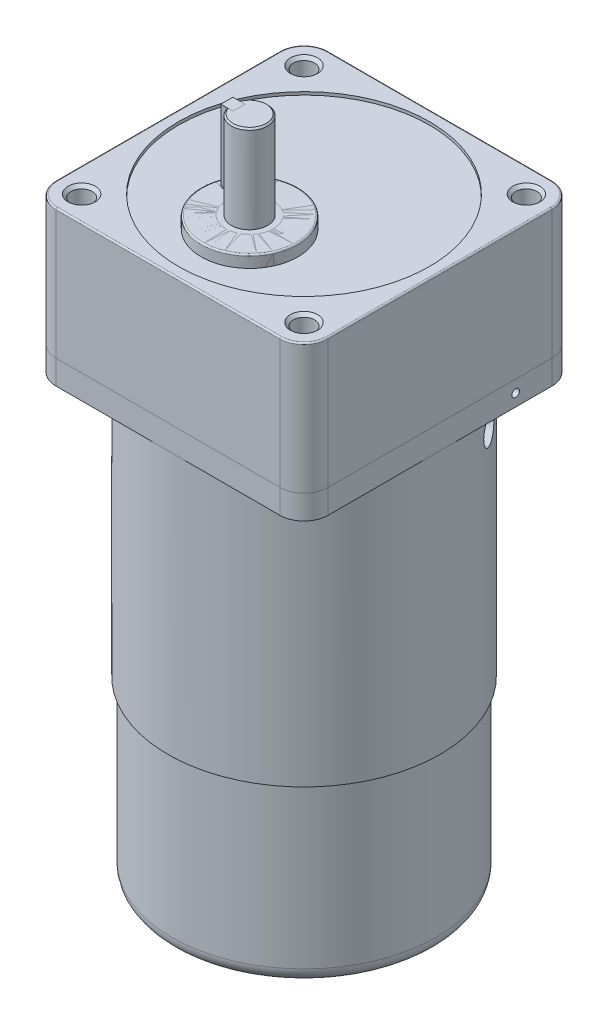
ISO-10303-21;
HEADER;
FILE_DESCRIPTION(('STEP AP214'),'2;1');
FILE_NAME('part.step','',(''),(''),'','','');
FILE_SCHEMA(('AUTOMOTIVE_DESIGN { 1 0 10303 214 1 1 1 1 }'));
ENDSEC;
DATA;
#1=APPLICATION_CONTEXT('core data for automotive mechanical design processes');
#2=APPLICATION_PROTOCOL_DEFINITION('international standard','automotive_design',2000,#1);
#3=PRODUCT_CONTEXT('',#1,'mechanical');
#4=PRODUCT('Part','Part','',(#3));
#5=PRODUCT_RELATED_PRODUCT_CATEGORY('part','',(#4));
#6=PRODUCT_DEFINITION_FORMATION('','',#4);
#7=PRODUCT_DEFINITION_CONTEXT('part definition',#1,'design');
#8=PRODUCT_DEFINITION('design','',#6,#7);
#9=PRODUCT_DEFINITION_SHAPE('','',#8);
#10=(LENGTH_UNIT() NAMED_UNIT(*) SI_UNIT(.MILLI.,.METRE.));
#11=(NAMED_UNIT(*) PLANE_ANGLE_UNIT() SI_UNIT($,.RADIAN.));
#12=(NAMED_UNIT(*) SI_UNIT($,.STERADIAN.) SOLID_ANGLE_UNIT());
#13=UNCERTAINTY_MEASURE_WITH_UNIT(LENGTH_MEASURE(1.E-05),#10,'distance_accuracy_value','');
#14=(GEOMETRIC_REPRESENTATION_CONTEXT(3) GLOBAL_UNCERTAINTY_ASSIGNED_CONTEXT((#13)) GLOBAL_UNIT_ASSIGNED_CONTEXT((#10,
#11,#12)) REPRESENTATION_CONTEXT('',''));
#15=CARTESIAN_POINT('',(0.,0.,0.));
#16=DIRECTION('',(0.,0.,1.));
#17=DIRECTION('',(1.,0.,0.));
#18=AXIS2_PLACEMENT_3D('',#15,#16,#17);
#19=CARTESIAN_POINT('',(-33.691,113.091001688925,18.0000000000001));
#20=DIRECTION('',(1.,0.,0.));
#21=DIRECTION('',(0.,0.,-1.));
#22=AXIS2_PLACEMENT_3D('',#19,#20,#21);
#23=CYLINDRICAL_SURFACE('',#22,2.);
#24=CARTESIAN_POINT('',(-29.691,113.091001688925,18.0000000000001));
#25=DIRECTION('',(-1.,0.,0.));
#26=DIRECTION('',(0.,0.,1.));
#27=AXIS2_PLACEMENT_3D('',#24,#25,#26);
#28=CIRCLE('',#27,2.);
#29=CARTESIAN_POINT('',(-29.691,113.091001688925,16.0000000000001));
#30=VERTEX_POINT('',#29);
#31=CARTESIAN_POINT('',(-29.691,113.091001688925,20.0000000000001));
#32=VERTEX_POINT('',#31);
#33=EDGE_CURVE('P0_E106',#30,#32,#28,.T.);
#34=ORIENTED_EDGE('',*,*,#33,.T.);
#35=DIRECTION('',(1.,0.,0.));
#36=VECTOR('',#35,1.);
#37=CARTESIAN_POINT('',(-33.691,113.091001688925,20.0000000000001));
#38=LINE('',#37,#36);
#39=CARTESIAN_POINT('',(-33.691,113.091001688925,20.0000000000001));
#40=VERTEX_POINT('',#39);
#41=EDGE_CURVE('P0_E12',#40,#32,#38,.T.);
#42=ORIENTED_EDGE('',*,*,#41,.F.);
#43=CARTESIAN_POINT('',(-33.691,113.091001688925,18.0000000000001));
#44=DIRECTION('',(-1.,0.,0.));
#45=DIRECTION('',(0.,0.,1.));
#46=AXIS2_PLACEMENT_3D('',#43,#44,#45);
#47=CIRCLE('',#46,2.);
#48=CARTESIAN_POINT('',(-33.691,113.091001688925,16.0000000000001));
#49=VERTEX_POINT('',#48);
#50=EDGE_CURVE('P0_E94',#49,#40,#47,.T.);
#51=ORIENTED_EDGE('',*,*,#50,.F.);
#52=DIRECTION('',(1.,0.,0.));
#53=VECTOR('',#52,1.);
#54=CARTESIAN_POINT('',(-33.691,113.091001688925,16.0000000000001));
#55=LINE('',#54,#53);
#56=EDGE_CURVE('P0_E102',#49,#30,#55,.T.);
#57=ORIENTED_EDGE('',*,*,#56,.T.);
#58=EDGE_LOOP('',(#34,#42,#51,#57));
#59=FACE_BOUND('',#58,.T.);
#60=ADVANCED_FACE('P0_F43',(#59),#23,.T.);
#61=CARTESIAN_POINT('',(-33.691,136.091001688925,20.0000000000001));
#62=DIRECTION('',(0.,0.,-1.));
#63=DIRECTION('',(-1.,0.,0.));
#64=AXIS2_PLACEMENT_3D('',#61,#62,#63);
#65=PLANE('',#64);
#66=DIRECTION('',(0.,1.,0.));
#67=VECTOR('',#66,1.);
#68=CARTESIAN_POINT('',(-29.691,136.091001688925,20.0000000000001));
#69=LINE('',#68,#67);
#70=CARTESIAN_POINT('',(-29.691,136.091001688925,20.0000000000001));
#71=VERTEX_POINT('',#70);
#72=EDGE_CURVE('P0_E98',#32,#71,#69,.T.);
#73=ORIENTED_EDGE('',*,*,#72,.T.);
#74=DIRECTION('',(1.,0.,0.));
#75=VECTOR('',#74,1.);
#76=CARTESIAN_POINT('',(-33.691,136.091001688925,20.0000000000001));
#77=LINE('',#76,#75);
#78=CARTESIAN_POINT('',(-33.691,136.091001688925,20.0000000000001));
#79=VERTEX_POINT('',#78);
#80=EDGE_CURVE('P0_E51',#79,#71,#77,.T.);
#81=ORIENTED_EDGE('',*,*,#80,.F.);
#82=DIRECTION('',(0.,1.,0.));
#83=VECTOR('',#82,1.);
#84=CARTESIAN_POINT('',(-33.691,136.091001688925,20.0000000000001));
#85=LINE('',#84,#83);
#86=EDGE_CURVE('P0_E89',#40,#79,#85,.T.);
#87=ORIENTED_EDGE('',*,*,#86,.F.);
#88=ORIENTED_EDGE('',*,*,#41,.T.);
#89=EDGE_LOOP('',(#73,#81,#87,#88));
#90=FACE_BOUND('',#89,.T.);
#91=ADVANCED_FACE('P0_F97',(#90),#65,.F.);
#92=CARTESIAN_POINT('',(-33.691,136.091001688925,16.0000000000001));
#93=DIRECTION('',(0.,-1.,0.));
#94=DIRECTION('',(0.,0.,-1.));
#95=AXIS2_PLACEMENT_3D('',#92,#93,#94);
#96=PLANE('',#95);
#97=DIRECTION('',(0.,0.,-1.));
#98=VECTOR('',#97,1.);
#99=CARTESIAN_POINT('',(-29.691,136.091001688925,16.0000000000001));
#100=LINE('',#99,#98);
#101=CARTESIAN_POINT('',(-29.691,136.091001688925,16.0000000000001));
#102=VERTEX_POINT('',#101);
#103=EDGE_CURVE('P0_E76',#71,#102,#100,.T.);
#104=ORIENTED_EDGE('',*,*,#103,.T.);
#105=DIRECTION('',(1.,0.,0.));
#106=VECTOR('',#105,1.);
#107=CARTESIAN_POINT('',(-33.691,136.091001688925,16.0000000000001));
#108=LINE('',#107,#106);
#109=CARTESIAN_POINT('',(-33.691,136.091001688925,16.0000000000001));
#110=VERTEX_POINT('',#109);
#111=EDGE_CURVE('P0_E99',#110,#102,#108,.T.);
#112=ORIENTED_EDGE('',*,*,#111,.F.);
#113=DIRECTION('',(0.,0.,-1.));
#114=VECTOR('',#113,1.);
#115=CARTESIAN_POINT('',(-33.691,136.091001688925,16.0000000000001));
#116=LINE('',#115,#114);
#117=EDGE_CURVE('P0_E92',#79,#110,#116,.T.);
#118=ORIENTED_EDGE('',*,*,#117,.F.);
#119=ORIENTED_EDGE('',*,*,#80,.T.);
#120=EDGE_LOOP('',(#104,#112,#118,#119));
#121=FACE_BOUND('',#120,.T.);
#122=ADVANCED_FACE('P0_F100',(#121),#96,.F.);
#123=CARTESIAN_POINT('',(-33.691,113.091001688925,16.0000000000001));
#124=DIRECTION('',(0.,0.,1.));
#125=DIRECTION('',(1.,0.,0.));
#126=AXIS2_PLACEMENT_3D('',#123,#124,#125);
#127=PLANE('',#126);
#128=DIRECTION('',(0.,-1.,0.));
#129=VECTOR('',#128,1.);
#130=CARTESIAN_POINT('',(-29.691,113.091001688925,16.0000000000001));
#131=LINE('',#130,#129);
#132=EDGE_CURVE('P0_E82',#102,#30,#131,.T.);
#133=ORIENTED_EDGE('',*,*,#132,.T.);
#134=ORIENTED_EDGE('',*,*,#56,.F.);
#135=DIRECTION('',(0.,-1.,0.));
#136=VECTOR('',#135,1.);
#137=CARTESIAN_POINT('',(-33.691,113.091001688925,16.0000000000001));
#138=LINE('',#137,#136);
#139=EDGE_CURVE('P0_E59',#110,#49,#138,.T.);
#140=ORIENTED_EDGE('',*,*,#139,.F.);
#141=ORIENTED_EDGE('',*,*,#111,.T.);
#142=EDGE_LOOP('',(#133,#134,#140,#141));
#143=FACE_BOUND('',#142,.T.);
#144=ADVANCED_FACE('P0_F113',(#143),#127,.F.);
#145=CARTESIAN_POINT('',(-33.691,113.091001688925,18.0000000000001));
#146=DIRECTION('',(-1.,0.,0.));
#147=DIRECTION('',(0.,0.,1.));
#148=AXIS2_PLACEMENT_3D('',#145,#146,#147);
#149=PLANE('',#148);
#150=ORIENTED_EDGE('',*,*,#50,.T.);
#151=ORIENTED_EDGE('',*,*,#86,.T.);
#152=ORIENTED_EDGE('',*,*,#117,.T.);
#153=ORIENTED_EDGE('',*,*,#139,.T.);
#154=EDGE_LOOP('',(#150,#151,#152,#153));
#155=FACE_BOUND('',#154,.T.);
#156=ADVANCED_FACE('P0_F90',(#155),#149,.T.);
#157=CARTESIAN_POINT('',(-29.691,113.091001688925,18.0000000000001));
#158=DIRECTION('',(-1.,0.,0.));
#159=DIRECTION('',(0.,0.,1.));
#160=AXIS2_PLACEMENT_3D('',#157,#158,#159);
#161=PLANE('',#160);
#162=ORIENTED_EDGE('',*,*,#33,.F.);
#163=ORIENTED_EDGE('',*,*,#132,.F.);
#164=ORIENTED_EDGE('',*,*,#103,.F.);
#165=ORIENTED_EDGE('',*,*,#72,.F.);
#166=EDGE_LOOP('',(#162,#163,#164,#165));
#167=FACE_BOUND('',#166,.T.);
#168=ADVANCED_FACE('P0_F116',(#167),#161,.F.);
#169=CLOSED_SHELL('',(#60,#91,#122,#144,#156,#168));
#170=MANIFOLD_SOLID_BREP('P0_B2',#169);
#171=CARTESIAN_POINT('',(-26.1827694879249,136.091001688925,18.0000000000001));
#172=DIRECTION('',(0.,-1.,0.));
#173=DIRECTION('',(1.,0.,0.));
#174=AXIS2_PLACEMENT_3D('',#171,#172,#173);
#175=CYLINDRICAL_SURFACE('',#174,6.);
#176=CARTESIAN_POINT('',(-26.1827694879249,107.091001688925,18.0000000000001));
#177=DIRECTION('',(0.,1.,0.));
#178=DIRECTION('',(-1.,0.,0.));
#179=AXIS2_PLACEMENT_3D('',#176,#177,#178);
#180=CIRCLE('',#179,6.);
#181=CARTESIAN_POINT('',(-32.1827694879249,107.091001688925,18.0000000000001));
#182=VERTEX_POINT('',#181);
#183=EDGE_CURVE('P0_E247',#182,#182,#180,.T.);
#184=ORIENTED_EDGE('',*,*,#183,.T.);
#185=EDGE_LOOP('',(#184));
#186=FACE_BOUND('',#185,.T.);
#187=DIRECTION('',(0.,-1.,0.));
#188=VECTOR('',#187,1.);
#189=CARTESIAN_POINT('',(-31.8396237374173,136.091001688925,16.0000000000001));
#190=LINE('',#189,#188);
#191=CARTESIAN_POINT('',(-31.8396237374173,135.591001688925,16.0000000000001));
#192=VERTEX_POINT('',#191);
#193=CARTESIAN_POINT('',(-31.8396237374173,113.091001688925,16.0000000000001));
#194=VERTEX_POINT('',#193);
#195=EDGE_CURVE('P0_E238',#192,#194,#190,.T.);
#196=ORIENTED_EDGE('',*,*,#195,.F.);
#197=CARTESIAN_POINT('',(-26.1827694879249,135.591001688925,18.0000000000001));
#198=DIRECTION('',(0.,1.,0.));
#199=DIRECTION('',(0.,0.,1.));
#200=AXIS2_PLACEMENT_3D('',#197,#198,#199);
#201=CIRCLE('',#200,6.);
#202=CARTESIAN_POINT('',(-31.8396237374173,135.591001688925,20.0000000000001));
#203=VERTEX_POINT('',#202);
#204=EDGE_CURVE('P0_E262',#192,#203,#201,.F.);
#205=ORIENTED_EDGE('',*,*,#204,.T.);
#206=DIRECTION('',(0.,-1.,0.));
#207=VECTOR('',#206,1.);
#208=CARTESIAN_POINT('',(-31.8396237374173,136.091001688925,20.0000000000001));
#209=LINE('',#208,#207);
#210=CARTESIAN_POINT('',(-31.8396237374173,113.091001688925,20.0000000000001));
#211=VERTEX_POINT('',#210);
#212=EDGE_CURVE('P0_E188',#211,#203,#209,.F.);
#213=ORIENTED_EDGE('',*,*,#212,.F.);
#214=CARTESIAN_POINT('',(-31.8396237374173,113.091001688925,16.0000000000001));
#215=CARTESIAN_POINT('',(-31.8396183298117,113.036420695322,15.9999985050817));
#216=CARTESIAN_POINT('',(-31.8404146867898,112.981867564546,16.0022357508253));
#217=CARTESIAN_POINT('',(-31.8435560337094,112.873184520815,16.0111487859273));
#218=CARTESIAN_POINT('',(-31.8459006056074,112.819054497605,16.0178233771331));
#219=CARTESIAN_POINT('',(-31.8551513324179,112.658217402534,16.0443786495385));
#220=CARTESIAN_POINT('',(-31.8642753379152,112.552639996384,16.0707915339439));
#221=CARTESIAN_POINT('',(-31.8873309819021,112.347751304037,16.1400831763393));
#222=CARTESIAN_POINT('',(-31.9012599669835,112.248436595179,16.182952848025));
#223=CARTESIAN_POINT('',(-31.9323452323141,112.058322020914,16.2838535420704));
#224=CARTESIAN_POINT('',(-31.9495034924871,111.96752743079,16.3418938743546));
#225=CARTESIAN_POINT('',(-31.9858590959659,111.793561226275,16.4738972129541));
#226=CARTESIAN_POINT('',(-32.0051070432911,111.710771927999,16.548350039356));
#227=CARTESIAN_POINT('',(-32.0430464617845,111.558589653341,16.7100231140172));
#228=CARTESIAN_POINT('',(-32.061737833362,111.489199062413,16.797245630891));
#229=CARTESIAN_POINT('',(-32.0970471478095,111.364042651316,16.9847927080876));
#230=CARTESIAN_POINT('',(-32.113598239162,111.30867972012,17.0853998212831));
#231=CARTESIAN_POINT('',(-32.1421616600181,111.21581718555,17.2951415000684));
#232=CARTESIAN_POINT('',(-32.1541753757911,111.178312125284,17.4042734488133));
#233=CARTESIAN_POINT('',(-32.1719509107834,111.123530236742,17.623941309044));
#234=CARTESIAN_POINT('',(-32.1779156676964,111.105595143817,17.7342963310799));
#235=CARTESIAN_POINT('',(-32.1836416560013,111.088369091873,17.9566020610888));
#236=CARTESIAN_POINT('',(-32.183404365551,111.089073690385,18.0685523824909));
#237=CARTESIAN_POINT('',(-32.1768902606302,111.108690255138,18.2862076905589));
#238=CARTESIAN_POINT('',(-32.1708507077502,111.126886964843,18.3919854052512));
#239=CARTESIAN_POINT('',(-32.1537086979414,111.179788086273,18.5988881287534));
#240=CARTESIAN_POINT('',(-32.1426059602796,111.214493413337,18.700012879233));
#241=CARTESIAN_POINT('',(-32.116282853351,111.299844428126,18.896305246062));
#242=CARTESIAN_POINT('',(-32.1010102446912,111.350693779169,18.9913770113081));
#243=CARTESIAN_POINT('',(-32.0679372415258,111.466721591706,19.1718491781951));
#244=CARTESIAN_POINT('',(-32.0501361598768,111.531903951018,19.2572469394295));
#245=CARTESIAN_POINT('',(-32.0128949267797,111.678343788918,19.4201946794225));
#246=CARTESIAN_POINT('',(-31.9934170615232,111.760212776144,19.4971872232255));
#247=CARTESIAN_POINT('',(-31.955719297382,111.935884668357,19.6365440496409));
#248=CARTESIAN_POINT('',(-31.93749980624,112.029691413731,19.6989036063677));
#249=CARTESIAN_POINT('',(-31.9041701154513,112.228362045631,19.8080066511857));
#250=CARTESIAN_POINT('',(-31.8891097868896,112.33336871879,19.8545060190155));
#251=CARTESIAN_POINT('',(-31.8643914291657,112.550295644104,19.9289204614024));
#252=CARTESIAN_POINT('',(-31.8547248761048,112.662204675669,19.9568648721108));
#253=CARTESIAN_POINT('',(-31.8455003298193,112.82783896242,19.9833163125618));
#254=CARTESIAN_POINT('',(-31.843302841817,112.880284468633,19.9895701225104));
#255=CARTESIAN_POINT('',(-31.8403635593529,112.985477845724,19.9979092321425));
#256=CARTESIAN_POINT('',(-31.8396198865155,113.038225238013,19.9999999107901));
#257=CARTESIAN_POINT('',(-31.8396237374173,113.091001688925,20.0000000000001));
#258=B_SPLINE_CURVE_WITH_KNOTS('',3,(#214,#215,#216,#217,#218,#219,#220,#221,#222,#223,#224,
#225,#226,#227,#228,#229,#230,#231,#232,#233,#234,#235,#236,#237,#238,#239,#240,#241,#242,#243,
#244,#245,#246,#247,#248,#249,#250,#251,#252,#253,#254,#255,#256,#257),.UNSPECIFIED.,.F.,.F.,(4,
2,2,2,2,2,2,2,2,2,2,2,2,2,2,2,2,2,2,2,2,4),(0.,0.163636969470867,0.327229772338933,
0.653162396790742,0.978915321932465,1.30486862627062,1.64233009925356,1.97985159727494,
2.32618265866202,2.67240782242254,3.00658941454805,3.34069136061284,3.6616883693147,
3.98270317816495,4.30794037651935,4.63326613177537,4.973881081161,5.31460588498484,
5.6603605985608,6.00556734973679,6.16399790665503,6.32222363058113),.UNSPECIFIED.);
#259=EDGE_CURVE('P0_E41',#194,#211,#258,.T.);
#260=ORIENTED_EDGE('',*,*,#259,.F.);
#261=EDGE_LOOP('',(#196,#205,#213,#260));
#262=FACE_BOUND('',#261,.T.);
#263=ADVANCED_FACE('P0_F167',(#186,#262),#175,.T.);
#264=CARTESIAN_POINT('',(-26.1827694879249,136.091001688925,18.0000000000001));
#265=DIRECTION('',(0.,1.,0.));
#266=DIRECTION('',(-1.,0.,0.));
#267=AXIS2_PLACEMENT_3D('',#264,#265,#266);
#268=PLANE('',#267);
#269=CARTESIAN_POINT('',(-26.1827694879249,136.091001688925,18.0000000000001));
#270=DIRECTION('',(0.,1.,0.));
#271=DIRECTION('',(-1.,0.,0.));
#272=AXIS2_PLACEMENT_3D('',#269,#270,#271);
#273=CIRCLE('',#272,5.50000000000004);
#274=CARTESIAN_POINT('',(-31.3062448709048,136.091001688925,20.0000000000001));
#275=VERTEX_POINT('',#274);
#276=CARTESIAN_POINT('',(-31.3062448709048,136.091001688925,16.0000000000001));
#277=VERTEX_POINT('',#276);
#278=EDGE_CURVE('P0_E259',#275,#277,#273,.T.);
#279=ORIENTED_EDGE('',*,*,#278,.T.);
#280=DIRECTION('',(-1.,0.,0.));
#281=VECTOR('',#280,1.);
#282=CARTESIAN_POINT('',(-29.691,136.091001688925,16.0000000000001));
#283=LINE('',#282,#281);
#284=CARTESIAN_POINT('',(-29.691,136.091001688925,16.0000000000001));
#285=VERTEX_POINT('',#284);
#286=EDGE_CURVE('P0_E239',#285,#277,#283,.T.);
#287=ORIENTED_EDGE('',*,*,#286,.F.);
#288=DIRECTION('',(0.,0.,1.));
#289=VECTOR('',#288,1.);
#290=CARTESIAN_POINT('',(-29.691,136.091001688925,16.0000000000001));
#291=LINE('',#290,#289);
#292=CARTESIAN_POINT('',(-29.691,136.091001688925,20.0000000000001));
#293=VERTEX_POINT('',#292);
#294=EDGE_CURVE('P0_E225',#285,#293,#291,.T.);
#295=ORIENTED_EDGE('',*,*,#294,.T.);
#296=DIRECTION('',(-1.,0.,0.));
#297=VECTOR('',#296,1.);
#298=CARTESIAN_POINT('',(-29.691,136.091001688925,20.0000000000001));
#299=LINE('',#298,#297);
#300=EDGE_CURVE('P0_E242',#293,#275,#299,.T.);
#301=ORIENTED_EDGE('',*,*,#300,.T.);
#302=EDGE_LOOP('',(#279,#287,#295,#301));
#303=FACE_BOUND('',#302,.T.);
#304=ADVANCED_FACE('P0_F284',(#303),#268,.T.);
#305=CARTESIAN_POINT('',(-26.1827694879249,136.091001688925,18.0000000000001));
#306=DIRECTION('',(0.,-1.,0.));
#307=DIRECTION('',(0.,0.,-1.));
#308=AXIS2_PLACEMENT_3D('',#305,#306,#307);
#309=CONICAL_SURFACE('',#308,5.50000000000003,0.785398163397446);
#310=ORIENTED_EDGE('',*,*,#204,.F.);
#311=CARTESIAN_POINT('',(-35.1397097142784,132.413486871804,16.0000000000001));
#312=CARTESIAN_POINT('',(-34.8574993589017,132.688877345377,16.0000000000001));
#313=CARTESIAN_POINT('',(-34.5750140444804,132.963988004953,16.0000000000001));
#314=CARTESIAN_POINT('',(-34.0092434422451,133.513320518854,16.0000000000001));
#315=CARTESIAN_POINT('',(-33.7259582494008,133.787542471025,16.0000000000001));
#316=CARTESIAN_POINT('',(-33.1584846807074,134.334627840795,16.0000000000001));
#317=CARTESIAN_POINT('',(-32.8742971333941,134.60749211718,16.0000000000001));
#318=CARTESIAN_POINT('',(-32.3043042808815,135.151599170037,16.0000000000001));
#319=CARTESIAN_POINT('',(-32.0184987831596,135.422841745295,16.0000000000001));
#320=CARTESIAN_POINT('',(-31.5878370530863,135.827980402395,16.0000000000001));
#321=CARTESIAN_POINT('',(-31.4438693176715,135.96282065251,16.0000000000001));
#322=CARTESIAN_POINT('',(-31.1551869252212,136.231695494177,16.0000000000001));
#323=CARTESIAN_POINT('',(-31.0104722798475,136.365730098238,16.0000000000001));
#324=CARTESIAN_POINT('',(-30.7201380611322,136.632729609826,16.0000000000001));
#325=CARTESIAN_POINT('',(-30.574518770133,136.765694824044,16.0000000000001));
#326=CARTESIAN_POINT('',(-30.2820457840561,137.03028088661,16.0000000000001));
#327=CARTESIAN_POINT('',(-30.1351920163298,137.161901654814,16.0000000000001));
#328=CARTESIAN_POINT('',(-29.8396985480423,137.423461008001,16.0000000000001));
#329=CARTESIAN_POINT('',(-29.6910570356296,137.553397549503,16.0000000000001));
#330=CARTESIAN_POINT('',(-29.3915962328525,137.810701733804,16.0000000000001));
#331=CARTESIAN_POINT('',(-29.2407773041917,137.938069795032,16.0000000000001));
#332=CARTESIAN_POINT('',(-29.0121562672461,138.126383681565,16.0000000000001));
#333=CARTESIAN_POINT('',(-28.9355092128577,138.188730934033,16.0000000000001));
#334=CARTESIAN_POINT('',(-28.7812859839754,138.312258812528,16.0000000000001));
#335=CARTESIAN_POINT('',(-28.7037098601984,138.373439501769,16.0000000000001));
#336=CARTESIAN_POINT('',(-28.5473943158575,138.494393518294,16.0000000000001));
#337=CARTESIAN_POINT('',(-28.4686542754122,138.554166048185,16.0000000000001));
#338=CARTESIAN_POINT('',(-28.3097821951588,138.671860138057,16.0000000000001));
#339=CARTESIAN_POINT('',(-28.2296498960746,138.729781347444,16.0000000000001));
#340=CARTESIAN_POINT('',(-28.1487008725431,138.786561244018,16.0000000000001));
#341=B_SPLINE_CURVE_WITH_KNOTS('',3,(#311,#312,#313,#314,#315,#316,#317,#318,#319,#320,#321,
#322,#323,#324,#325,#326,#327,#328,#329,#330,#331,#332,#333,#334,#335,#336,#337,#338,#339,#340),
.UNSPECIFIED.,.F.,.F.,(4,2,2,2,2,2,2,2,2,2,2,2,2,2,4),(0.,1.18294038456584,2.36574577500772,
3.54767137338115,4.72974069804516,5.3214963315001,5.91324275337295,6.50481294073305,
7.096418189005,7.68868433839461,8.28085320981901,8.5772520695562,8.87363482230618,
9.17018155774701,9.46678412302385),.UNSPECIFIED.);
#342=EDGE_CURVE('P0_E181',#192,#277,#341,.T.);
#343=ORIENTED_EDGE('',*,*,#342,.T.);
#344=ORIENTED_EDGE('',*,*,#278,.F.);
#345=CARTESIAN_POINT('',(-28.1487008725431,138.786561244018,20.0000000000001));
#346=CARTESIAN_POINT('',(-28.205068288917,138.747039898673,20.0000000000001));
#347=CARTESIAN_POINT('',(-28.2610332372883,138.706951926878,20.0000000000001));
#348=CARTESIAN_POINT('',(-28.3722503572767,138.625808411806,20.0000000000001));
#349=CARTESIAN_POINT('',(-28.4275025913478,138.584752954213,20.0000000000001));
#350=CARTESIAN_POINT('',(-28.5923063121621,138.460401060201,20.0000000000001));
#351=CARTESIAN_POINT('',(-28.7009425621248,138.375892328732,20.0000000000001));
#352=CARTESIAN_POINT('',(-28.9162594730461,138.204598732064,20.0000000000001));
#353=CARTESIAN_POINT('',(-29.0229415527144,138.117815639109,20.0000000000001));
#354=CARTESIAN_POINT('',(-29.2348561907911,137.942480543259,20.0000000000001));
#355=CARTESIAN_POINT('',(-29.3400886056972,137.85392836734,20.0000000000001));
#356=CARTESIAN_POINT('',(-29.6538305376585,137.586476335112,20.0000000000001));
#357=CARTESIAN_POINT('',(-29.8606344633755,137.405578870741,20.0000000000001));
#358=CARTESIAN_POINT('',(-30.2713248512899,137.04044803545,20.0000000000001));
#359=CARTESIAN_POINT('',(-30.4752107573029,136.856214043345,20.0000000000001));
#360=CARTESIAN_POINT('',(-30.7665015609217,136.590069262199,20.0000000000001));
#361=CARTESIAN_POINT('',(-30.8547349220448,136.509063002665,20.0000000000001));
#362=CARTESIAN_POINT('',(-31.0308597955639,136.346689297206,20.0000000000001));
#363=CARTESIAN_POINT('',(-31.118751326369,136.265321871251,20.0000000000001));
#364=CARTESIAN_POINT('',(-31.3820339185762,136.020711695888,20.0000000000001));
#365=CARTESIAN_POINT('',(-31.5569897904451,135.857000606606,20.0000000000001));
#366=CARTESIAN_POINT('',(-32.0186936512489,135.422656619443,20.0000000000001));
#367=CARTESIAN_POINT('',(-32.3046935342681,135.151229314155,20.0000000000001));
#368=CARTESIAN_POINT('',(-32.8751090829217,134.606715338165,20.0000000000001));
#369=CARTESIAN_POINT('',(-33.1595247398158,134.333628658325,20.0000000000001));
#370=CARTESIAN_POINT('',(-33.727032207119,133.78650355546,20.0000000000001));
#371=CARTESIAN_POINT('',(-34.0101248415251,133.512465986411,20.0000000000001));
#372=CARTESIAN_POINT('',(-34.57547309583,132.963541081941,20.0000000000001));
#373=CARTESIAN_POINT('',(-34.8577287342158,132.688653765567,20.0000000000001));
#374=CARTESIAN_POINT('',(-35.1397097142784,132.413486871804,20.0000000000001));
#375=B_SPLINE_CURVE_WITH_KNOTS('',3,(#345,#346,#347,#348,#349,#350,#351,#352,#353,#354,#355,
#356,#357,#358,#359,#360,#361,#362,#363,#364,#365,#366,#367,#368,#369,#370,#371,#372,#373,#374),
.UNSPECIFIED.,.F.,.F.,(4,2,2,2,2,2,2,2,2,2,2,2,2,2,4),(0.,0.206516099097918,0.413013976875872,
0.82587096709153,1.23841529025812,1.65100016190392,2.47520647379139,3.29956784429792,
3.65890564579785,4.01822381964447,4.73703586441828,5.91991045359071,7.10279156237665,
8.28479721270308,9.46677655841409),.UNSPECIFIED.);
#376=EDGE_CURVE('P0_E265',#275,#203,#375,.T.);
#377=ORIENTED_EDGE('',*,*,#376,.T.);
#378=EDGE_LOOP('',(#310,#343,#344,#377));
#379=FACE_BOUND('',#378,.T.);
#380=ADVANCED_FACE('P0_F169',(#379),#309,.T.);
#381=CARTESIAN_POINT('',(-26.1827694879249,107.091001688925,18.0000000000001));
#382=DIRECTION('',(0.,1.,0.));
#383=DIRECTION('',(-1.,0.,0.));
#384=AXIS2_PLACEMENT_3D('',#381,#382,#383);
#385=PLANE('',#384);
#386=CARTESIAN_POINT('',(-26.1827694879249,107.091001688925,18.0000000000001));
#387=DIRECTION('',(0.,1.,0.));
#388=DIRECTION('',(-1.,0.,0.));
#389=AXIS2_PLACEMENT_3D('',#386,#387,#388);
#390=CIRCLE('',#389,15.5);
#391=CARTESIAN_POINT('',(-41.6827694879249,107.091001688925,18.0000000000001));
#392=VERTEX_POINT('',#391);
#393=EDGE_CURVE('P0_E253',#392,#392,#390,.T.);
#394=ORIENTED_EDGE('',*,*,#393,.T.);
#395=EDGE_LOOP('',(#394));
#396=FACE_BOUND('',#395,.T.);
#397=ORIENTED_EDGE('',*,*,#183,.F.);
#398=EDGE_LOOP('',(#397));
#399=FACE_BOUND('',#398,.T.);
#400=ADVANCED_FACE('P0_F291',(#396,#399),#385,.T.);
#401=CARTESIAN_POINT('',(-26.1827694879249,107.091001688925,18.0000000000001));
#402=DIRECTION('',(0.,-1.,0.));
#403=DIRECTION('',(1.,0.,0.));
#404=AXIS2_PLACEMENT_3D('',#401,#402,#403);
#405=CYLINDRICAL_SURFACE('',#404,16.);
#406=CARTESIAN_POINT('',(-26.1827694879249,106.591001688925,18.0000000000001));
#407=DIRECTION('',(0.,1.,0.));
#408=DIRECTION('',(-1.,0.,0.));
#409=AXIS2_PLACEMENT_3D('',#406,#407,#408);
#410=CIRCLE('',#409,16.);
#411=CARTESIAN_POINT('',(-42.1827694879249,106.591001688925,18.0000000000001));
#412=VERTEX_POINT('',#411);
#413=EDGE_CURVE('P0_E256',#412,#412,#410,.F.);
#414=ORIENTED_EDGE('',*,*,#413,.T.);
#415=EDGE_LOOP('',(#414));
#416=FACE_BOUND('',#415,.T.);
#417=CARTESIAN_POINT('',(-26.1827694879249,103.091001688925,18.0000000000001));
#418=DIRECTION('',(0.,1.,0.));
#419=DIRECTION('',(-1.,0.,0.));
#420=AXIS2_PLACEMENT_3D('',#417,#418,#419);
#421=CIRCLE('',#420,16.);
#422=CARTESIAN_POINT('',(-42.1827694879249,103.091001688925,18.0000000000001));
#423=VERTEX_POINT('',#422);
#424=EDGE_CURVE('P0_E250',#423,#423,#421,.T.);
#425=ORIENTED_EDGE('',*,*,#424,.T.);
#426=EDGE_LOOP('',(#425));
#427=FACE_BOUND('',#426,.T.);
#428=ADVANCED_FACE('P0_F294',(#416,#427),#405,.T.);
#429=CARTESIAN_POINT('',(-26.1827694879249,103.091001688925,18.0000000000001));
#430=DIRECTION('',(0.,1.,0.));
#431=DIRECTION('',(-1.,0.,0.));
#432=AXIS2_PLACEMENT_3D('',#429,#430,#431);
#433=PLANE('',#432);
#434=ORIENTED_EDGE('',*,*,#424,.F.);
#435=EDGE_LOOP('',(#434));
#436=FACE_BOUND('',#435,.T.);
#437=ADVANCED_FACE('P0_F296',(#436),#433,.F.);
#438=CARTESIAN_POINT('',(-26.1827694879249,106.591001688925,18.0000000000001));
#439=DIRECTION('',(0.,1.,0.));
#440=DIRECTION('',(-1.,0.,0.));
#441=AXIS2_PLACEMENT_3D('',#438,#439,#440);
#442=TOROIDAL_SURFACE('',#441,15.5,0.5);
#443=ORIENTED_EDGE('',*,*,#413,.F.);
#444=EDGE_LOOP('',(#443));
#445=FACE_BOUND('',#444,.T.);
#446=ORIENTED_EDGE('',*,*,#393,.F.);
#447=EDGE_LOOP('',(#446));
#448=FACE_BOUND('',#447,.T.);
#449=ADVANCED_FACE('P0_F283',(#445,#448),#442,.T.);
#450=CARTESIAN_POINT('',(-29.691,113.091001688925,18.0000000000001));
#451=DIRECTION('',(-1.,0.,0.));
#452=DIRECTION('',(0.,0.,1.));
#453=AXIS2_PLACEMENT_3D('',#450,#451,#452);
#454=CYLINDRICAL_SURFACE('',#453,2.);
#455=ORIENTED_EDGE('',*,*,#259,.T.);
#456=DIRECTION('',(-1.,0.,0.));
#457=VECTOR('',#456,1.);
#458=CARTESIAN_POINT('',(-29.691,113.091001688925,20.0000000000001));
#459=LINE('',#458,#457);
#460=CARTESIAN_POINT('',(-29.691,113.091001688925,20.0000000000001));
#461=VERTEX_POINT('',#460);
#462=EDGE_CURVE('P0_E235',#461,#211,#459,.T.);
#463=ORIENTED_EDGE('',*,*,#462,.F.);
#464=CARTESIAN_POINT('',(-29.691,113.091001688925,18.0000000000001));
#465=DIRECTION('',(1.,0.,0.));
#466=DIRECTION('',(0.,0.,-1.));
#467=AXIS2_PLACEMENT_3D('',#464,#465,#466);
#468=CIRCLE('',#467,2.);
#469=CARTESIAN_POINT('',(-29.691,113.091001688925,16.0000000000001));
#470=VERTEX_POINT('',#469);
#471=EDGE_CURVE('P0_E223',#461,#470,#468,.T.);
#472=ORIENTED_EDGE('',*,*,#471,.T.);
#473=DIRECTION('',(-1.,0.,0.));
#474=VECTOR('',#473,1.);
#475=CARTESIAN_POINT('',(-29.691,113.091001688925,16.0000000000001));
#476=LINE('',#475,#474);
#477=EDGE_CURVE('P0_E233',#470,#194,#476,.T.);
#478=ORIENTED_EDGE('',*,*,#477,.T.);
#479=EDGE_LOOP('',(#455,#463,#472,#478));
#480=FACE_BOUND('',#479,.T.);
#481=ADVANCED_FACE('P0_F232',(#480),#454,.F.);
#482=CARTESIAN_POINT('',(-29.691,113.091001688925,16.0000000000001));
#483=DIRECTION('',(0.,0.,1.));
#484=DIRECTION('',(1.,0.,0.));
#485=AXIS2_PLACEMENT_3D('',#482,#483,#484);
#486=PLANE('',#485);
#487=ORIENTED_EDGE('',*,*,#195,.T.);
#488=ORIENTED_EDGE('',*,*,#477,.F.);
#489=DIRECTION('',(0.,1.,0.));
#490=VECTOR('',#489,1.);
#491=CARTESIAN_POINT('',(-29.691,113.091001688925,16.0000000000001));
#492=LINE('',#491,#490);
#493=EDGE_CURVE('P0_E219',#470,#285,#492,.T.);
#494=ORIENTED_EDGE('',*,*,#493,.T.);
#495=ORIENTED_EDGE('',*,*,#286,.T.);
#496=ORIENTED_EDGE('',*,*,#342,.F.);
#497=EDGE_LOOP('',(#487,#488,#494,#495,#496));
#498=FACE_BOUND('',#497,.T.);
#499=ADVANCED_FACE('P0_F237',(#498),#486,.T.);
#500=CARTESIAN_POINT('',(-29.691,136.091001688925,20.0000000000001));
#501=DIRECTION('',(0.,0.,-1.));
#502=DIRECTION('',(-1.,0.,0.));
#503=AXIS2_PLACEMENT_3D('',#500,#501,#502);
#504=PLANE('',#503);
#505=ORIENTED_EDGE('',*,*,#212,.T.);
#506=ORIENTED_EDGE('',*,*,#376,.F.);
#507=ORIENTED_EDGE('',*,*,#300,.F.);
#508=DIRECTION('',(0.,-1.,0.));
#509=VECTOR('',#508,1.);
#510=CARTESIAN_POINT('',(-29.691,136.091001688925,20.0000000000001));
#511=LINE('',#510,#509);
#512=EDGE_CURVE('P0_E316',#293,#461,#511,.T.);
#513=ORIENTED_EDGE('',*,*,#512,.T.);
#514=ORIENTED_EDGE('',*,*,#462,.T.);
#515=EDGE_LOOP('',(#505,#506,#507,#513,#514));
#516=FACE_BOUND('',#515,.T.);
#517=ADVANCED_FACE('P0_F274',(#516),#504,.T.);
#518=CARTESIAN_POINT('',(-29.691,113.091001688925,18.0000000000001));
#519=DIRECTION('',(1.,0.,0.));
#520=DIRECTION('',(0.,0.,-1.));
#521=AXIS2_PLACEMENT_3D('',#518,#519,#520);
#522=PLANE('',#521);
#523=ORIENTED_EDGE('',*,*,#471,.F.);
#524=ORIENTED_EDGE('',*,*,#512,.F.);
#525=ORIENTED_EDGE('',*,*,#294,.F.);
#526=ORIENTED_EDGE('',*,*,#493,.F.);
#527=EDGE_LOOP('',(#523,#524,#525,#526));
#528=FACE_BOUND('',#527,.T.);
#529=ADVANCED_FACE('P0_F221',(#528),#522,.F.);
#530=CLOSED_SHELL('',(#263,#304,#380,#400,#428,#437,#449,#481,#499,#517,#529));
#531=MANIFOLD_SOLID_BREP('P0_B6',#530);
#532=CARTESIAN_POINT('',(-26.1827694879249,92.0910016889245,1.2490009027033E-13));
#533=DIRECTION('',(0.,-1.,0.));
#534=DIRECTION('',(1.,0.,0.));
#535=AXIS2_PLACEMENT_3D('',#532,#533,#534);
#536=PLANE('',#535);
#537=CARTESIAN_POINT('',(-26.1827694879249,92.0910016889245,18.0000000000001));
#538=DIRECTION('',(0.,-1.,0.));
#539=DIRECTION('',(1.,0.,0.));
#540=AXIS2_PLACEMENT_3D('',#537,#538,#539);
#541=CIRCLE('',#540,16.2);
#542=CARTESIAN_POINT('',(-9.98276948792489,92.0910016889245,18.0000000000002));
#543=VERTEX_POINT('',#542);
#544=EDGE_CURVE('P1_E51',#543,#543,#541,.F.);
#545=ORIENTED_EDGE('',*,*,#544,.T.);
#546=EDGE_LOOP('',(#545));
#547=FACE_BOUND('',#546,.T.);
#548=CARTESIAN_POINT('',(-3.85463070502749,92.0910016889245,0.288302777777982));
#549=DIRECTION('',(0.,-1.,0.));
#550=DIRECTION('',(1.,0.,0.));
#551=AXIS2_PLACEMENT_3D('',#548,#549,#550);
#552=CIRCLE('',#551,9.70000000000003);
#553=CARTESIAN_POINT('',(5.84536929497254,92.0910016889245,0.288302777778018));
#554=VERTEX_POINT('',#553);
#555=EDGE_CURVE('P1_E39',#554,#554,#552,.F.);
#556=ORIENTED_EDGE('',*,*,#555,.T.);
#557=EDGE_LOOP('',(#556));
#558=FACE_BOUND('',#557,.T.);
#559=CARTESIAN_POINT('',(-3.85463070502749,92.0910016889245,0.288302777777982));
#560=DIRECTION('',(0.,-1.,0.));
#561=DIRECTION('',(1.,0.,0.));
#562=AXIS2_PLACEMENT_3D('',#559,#560,#561);
#563=CIRCLE('',#562,12.);
#564=CARTESIAN_POINT('',(-15.8528363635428,92.0910016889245,0.0807913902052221));
#565=VERTEX_POINT('',#564);
#566=CARTESIAN_POINT('',(-6.38296354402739,92.0910016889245,12.0189265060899));
#567=VERTEX_POINT('',#566);
#568=EDGE_CURVE('P1_E26',#565,#567,#563,.T.);
#569=ORIENTED_EDGE('',*,*,#568,.T.);
#570=CARTESIAN_POINT('',(-6.69900514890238,92.0910016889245,13.4852544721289));
#571=DIRECTION('',(0.,-1.,0.));
#572=DIRECTION('',(1.,0.,0.));
#573=AXIS2_PLACEMENT_3D('',#570,#571,#572);
#574=CIRCLE('',#573,1.5);
#575=CARTESIAN_POINT('',(-8.16028747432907,92.0910016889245,13.8238603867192));
#576=VERTEX_POINT('',#575);
#577=EDGE_CURVE('P1_E37',#567,#576,#574,.F.);
#578=ORIENTED_EDGE('',*,*,#577,.T.);
#579=CARTESIAN_POINT('',(-26.1827694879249,92.0910016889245,18.0000000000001));
#580=DIRECTION('',(0.,-1.,0.));
#581=DIRECTION('',(1.,0.,0.));
#582=AXIS2_PLACEMENT_3D('',#579,#580,#581);
#583=CIRCLE('',#582,18.5);
#584=CARTESIAN_POINT('',(-18.0148738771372,92.0910016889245,1.40073853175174));
#585=VERTEX_POINT('',#584);
#586=EDGE_CURVE('P1_E22',#576,#585,#583,.T.);
#587=ORIENTED_EDGE('',*,*,#586,.T.);
#588=CARTESIAN_POINT('',(-17.3526120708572,92.0910016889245,0.0548524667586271));
#589=DIRECTION('',(0.,-1.,0.));
#590=DIRECTION('',(1.,0.,0.));
#591=AXIS2_PLACEMENT_3D('',#588,#589,#590);
#592=CIRCLE('',#591,1.5);
#593=EDGE_CURVE('P1_E11',#585,#565,#592,.F.);
#594=ORIENTED_EDGE('',*,*,#593,.T.);
#595=EDGE_LOOP('',(#569,#578,#587,#594));
#596=FACE_BOUND('',#595,.T.);
#597=ADVANCED_FACE('P1_F16',(#547,#558,#596),#536,.T.);
#598=CARTESIAN_POINT('',(-26.1827694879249,92.2910016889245,18.0000000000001));
#599=DIRECTION('',(0.,-1.,0.));
#600=DIRECTION('',(1.,0.,0.));
#601=AXIS2_PLACEMENT_3D('',#598,#599,#600);
#602=CONICAL_SURFACE('',#601,16.,0.785398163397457);
#603=ORIENTED_EDGE('',*,*,#544,.F.);
#604=EDGE_LOOP('',(#603));
#605=FACE_BOUND('',#604,.T.);
#606=CARTESIAN_POINT('',(-26.1827694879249,92.2910016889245,18.0000000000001));
#607=DIRECTION('',(0.,-1.,0.));
#608=DIRECTION('',(1.,0.,0.));
#609=AXIS2_PLACEMENT_3D('',#606,#607,#608);
#610=CIRCLE('',#609,16.);
#611=CARTESIAN_POINT('',(-10.1827694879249,92.2910016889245,18.0000000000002));
#612=VERTEX_POINT('',#611);
#613=EDGE_CURVE('P1_E58',#612,#612,#610,.T.);
#614=ORIENTED_EDGE('',*,*,#613,.F.);
#615=EDGE_LOOP('',(#614));
#616=FACE_BOUND('',#615,.T.);
#617=ADVANCED_FACE('P1_F65',(#605,#616),#602,.F.);
#618=CARTESIAN_POINT('',(-26.1827694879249,100.091001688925,18.0000000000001));
#619=DIRECTION('',(0.,-1.,0.));
#620=DIRECTION('',(1.,0.,0.));
#621=AXIS2_PLACEMENT_3D('',#618,#619,#620);
#622=CYLINDRICAL_SURFACE('',#621,16.);
#623=ORIENTED_EDGE('',*,*,#613,.T.);
#624=EDGE_LOOP('',(#623));
#625=FACE_BOUND('',#624,.T.);
#626=CARTESIAN_POINT('',(-26.1827694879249,100.091001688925,18.0000000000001));
#627=DIRECTION('',(0.,-1.,0.));
#628=DIRECTION('',(1.,0.,0.));
#629=AXIS2_PLACEMENT_3D('',#626,#627,#628);
#630=CIRCLE('',#629,16.);
#631=CARTESIAN_POINT('',(-10.1827694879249,100.091001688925,18.0000000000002));
#632=VERTEX_POINT('',#631);
#633=EDGE_CURVE('P1_E54',#632,#632,#630,.T.);
#634=ORIENTED_EDGE('',*,*,#633,.F.);
#635=EDGE_LOOP('',(#634));
#636=FACE_BOUND('',#635,.T.);
#637=ADVANCED_FACE('P1_F62',(#625,#636),#622,.F.);
#638=OPEN_SHELL('',(#597,#617,#637));
#639=SHELL_BASED_SURFACE_MODEL('P1_B1',(#638));
#640=CARTESIAN_POINT('',(-68.182769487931,67.0910016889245,-9.21954445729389));
#641=DIRECTION('',(-1.,0.,-5.68166785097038E-13));
#642=DIRECTION('',(5.68166785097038E-13,0.,-1.));
#643=AXIS2_PLACEMENT_3D('',#640,#641,#642);
#644=PLANE('',#643);
#645=DIRECTION('',(5.68166785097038E-13,0.,-1.));
#646=VECTOR('',#645,1.);
#647=CARTESIAN_POINT('',(-68.182769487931,61.0910016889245,-9.21954445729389));
#648=LINE('',#647,#646);
#649=CARTESIAN_POINT('',(-68.182769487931,61.0910016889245,-9.21954445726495));
#650=VERTEX_POINT('',#649);
#651=CARTESIAN_POINT('',(-68.1827694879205,61.0910016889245,-27.6703956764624));
#652=VERTEX_POINT('',#651);
#653=EDGE_CURVE('P2_E25',#650,#652,#648,.T.);
#654=ORIENTED_EDGE('',*,*,#653,.T.);
#655=DIRECTION('',(0.,-1.,0.));
#656=VECTOR('',#655,1.);
#657=CARTESIAN_POINT('',(-68.1827694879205,67.0910016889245,-27.6703956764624));
#658=LINE('',#657,#656);
#659=CARTESIAN_POINT('',(-68.1827694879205,67.0910016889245,-27.6703956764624));
#660=VERTEX_POINT('',#659);
#661=EDGE_CURVE('P2_E36',#660,#652,#658,.T.);
#662=ORIENTED_EDGE('',*,*,#661,.F.);
#663=DIRECTION('',(5.68166785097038E-13,0.,-1.));
#664=VECTOR('',#663,1.);
#665=CARTESIAN_POINT('',(-68.182769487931,67.0910016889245,-9.21954445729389));
#666=LINE('',#665,#664);
#667=CARTESIAN_POINT('',(-68.1827694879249,67.0910016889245,-9.21954445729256));
#668=VERTEX_POINT('',#667);
#669=EDGE_CURVE('P2_E21',#668,#660,#666,.T.);
#670=ORIENTED_EDGE('',*,*,#669,.F.);
#671=DIRECTION('',(0.,-1.,0.));
#672=VECTOR('',#671,1.);
#673=CARTESIAN_POINT('',(-68.182769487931,67.0910016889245,-9.21954445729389));
#674=LINE('',#673,#672);
#675=EDGE_CURVE('P2_E11',#668,#650,#674,.T.);
#676=ORIENTED_EDGE('',*,*,#675,.T.);
#677=EDGE_LOOP('',(#654,#662,#670,#676));
#678=FACE_BOUND('',#677,.T.);
#679=ADVANCED_FACE('P2_F16',(#678),#644,.F.);
#680=OPEN_SHELL('',(#679));
#681=SHELL_BASED_SURFACE_MODEL('P2_B1',(#680));
#682=CARTESIAN_POINT('',(10.5867831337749,107.091001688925,36.7695526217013));
#683=DIRECTION('',(0.,-1.,0.));
#684=DIRECTION('',(1.,0.,0.));
#685=AXIS2_PLACEMENT_3D('',#682,#683,#684);
#686=CYLINDRICAL_SURFACE('',#685,3.5);
#687=CARTESIAN_POINT('',(10.5867831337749,103.091001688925,36.7695526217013));
#688=DIRECTION('',(0.,-1.,0.));
#689=DIRECTION('',(1.,0.,0.));
#690=AXIS2_PLACEMENT_3D('',#687,#688,#689);
#691=CIRCLE('',#690,3.5);
#692=CARTESIAN_POINT('',(14.0867831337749,103.091001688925,36.7695526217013));
#693=VERTEX_POINT('',#692);
#694=EDGE_CURVE('P3_E22',#693,#693,#691,.F.);
#695=ORIENTED_EDGE('',*,*,#694,.T.);
#696=EDGE_LOOP('',(#695));
#697=FACE_BOUND('',#696,.T.);
#698=CARTESIAN_POINT('',(10.5867831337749,62.0910016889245,36.7695526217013));
#699=DIRECTION('',(0.,-1.,0.));
#700=DIRECTION('',(1.,0.,0.));
#701=AXIS2_PLACEMENT_3D('',#698,#699,#700);
#702=CIRCLE('',#701,3.5);
#703=CARTESIAN_POINT('',(14.0867831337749,62.0910016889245,36.7695526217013));
#704=VERTEX_POINT('',#703);
#705=EDGE_CURVE('P3_E11',#704,#704,#702,.T.);
#706=ORIENTED_EDGE('',*,*,#705,.T.);
#707=EDGE_LOOP('',(#706));
#708=FACE_BOUND('',#707,.T.);
#709=ADVANCED_FACE('P3_F16',(#697,#708),#686,.F.);
#710=CARTESIAN_POINT('',(10.5867831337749,104.091001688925,36.7695526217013));
#711=DIRECTION('',(0.,1.,0.));
#712=DIRECTION('',(-1.,0.,0.));
#713=AXIS2_PLACEMENT_3D('',#710,#711,#712);
#714=CONICAL_SURFACE('',#713,4.49999999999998,0.785398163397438);
#715=ORIENTED_EDGE('',*,*,#694,.F.);
#716=EDGE_LOOP('',(#715));
#717=FACE_BOUND('',#716,.T.);
#718=CARTESIAN_POINT('',(10.5867831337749,104.091001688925,36.7695526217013));
#719=DIRECTION('',(0.,-1.,0.));
#720=DIRECTION('',(1.,0.,0.));
#721=AXIS2_PLACEMENT_3D('',#718,#719,#720);
#722=CIRCLE('',#721,4.49999999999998);
#723=CARTESIAN_POINT('',(15.0867831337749,104.091001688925,36.7695526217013));
#724=VERTEX_POINT('',#723);
#725=EDGE_CURVE('P3_E251',#724,#724,#722,.T.);
#726=ORIENTED_EDGE('',*,*,#725,.F.);
#727=EDGE_LOOP('',(#726));
#728=FACE_BOUND('',#727,.T.);
#729=ADVANCED_FACE('P3_F245',(#717,#728),#714,.F.);
#730=CARTESIAN_POINT('',(10.586783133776,107.091001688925,-36.7695526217));
#731=DIRECTION('',(0.,-1.,0.));
#732=DIRECTION('',(1.,0.,0.));
#733=AXIS2_PLACEMENT_3D('',#730,#731,#732);
#734=CYLINDRICAL_SURFACE('',#733,3.5);
#735=CARTESIAN_POINT('',(10.586783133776,103.091001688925,-36.7695526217));
#736=DIRECTION('',(0.,-1.,0.));
#737=DIRECTION('',(1.,0.,0.));
#738=AXIS2_PLACEMENT_3D('',#735,#736,#737);
#739=CIRCLE('',#738,3.5);
#740=CARTESIAN_POINT('',(14.086783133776,103.091001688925,-36.7695526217));
#741=VERTEX_POINT('',#740);
#742=EDGE_CURVE('P3_E234',#741,#741,#739,.F.);
#743=ORIENTED_EDGE('',*,*,#742,.T.);
#744=EDGE_LOOP('',(#743));
#745=FACE_BOUND('',#744,.T.);
#746=CARTESIAN_POINT('',(10.586783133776,62.0910016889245,-36.7695526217));
#747=DIRECTION('',(0.,-1.,0.));
#748=DIRECTION('',(1.,0.,0.));
#749=AXIS2_PLACEMENT_3D('',#746,#747,#748);
#750=CIRCLE('',#749,3.5);
#751=CARTESIAN_POINT('',(14.086783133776,62.0910016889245,-36.7695526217));
#752=VERTEX_POINT('',#751);
#753=EDGE_CURVE('P3_E237',#752,#752,#750,.T.);
#754=ORIENTED_EDGE('',*,*,#753,.T.);
#755=EDGE_LOOP('',(#754));
#756=FACE_BOUND('',#755,.T.);
#757=ADVANCED_FACE('P3_F248',(#745,#756),#734,.F.);
#758=CARTESIAN_POINT('',(10.586783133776,104.091001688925,-36.7695526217));
#759=DIRECTION('',(0.,1.,0.));
#760=DIRECTION('',(-1.,0.,0.));
#761=AXIS2_PLACEMENT_3D('',#758,#759,#760);
#762=CONICAL_SURFACE('',#761,4.49999999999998,0.785398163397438);
#763=ORIENTED_EDGE('',*,*,#742,.F.);
#764=EDGE_LOOP('',(#763));
#765=FACE_BOUND('',#764,.T.);
#766=CARTESIAN_POINT('',(10.586783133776,104.091001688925,-36.7695526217));
#767=DIRECTION('',(0.,-1.,0.));
#768=DIRECTION('',(1.,0.,0.));
#769=AXIS2_PLACEMENT_3D('',#766,#767,#768);
#770=CIRCLE('',#769,4.49999999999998);
#771=CARTESIAN_POINT('',(15.0867831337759,104.091001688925,-36.7695526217));
#772=VERTEX_POINT('',#771);
#773=EDGE_CURVE('P3_E253',#772,#772,#770,.T.);
#774=ORIENTED_EDGE('',*,*,#773,.F.);
#775=EDGE_LOOP('',(#774));
#776=FACE_BOUND('',#775,.T.);
#777=ADVANCED_FACE('P3_F394',(#765,#776),#762,.F.);
#778=CARTESIAN_POINT('',(-62.9523221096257,107.091001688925,36.7695526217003));
#779=DIRECTION('',(0.,-1.,0.));
#780=DIRECTION('',(1.,0.,0.));
#781=AXIS2_PLACEMENT_3D('',#778,#779,#780);
#782=CYLINDRICAL_SURFACE('',#781,3.5);
#783=CARTESIAN_POINT('',(-62.9523221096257,103.091001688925,36.7695526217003));
#784=DIRECTION('',(0.,-1.,0.));
#785=DIRECTION('',(1.,0.,0.));
#786=AXIS2_PLACEMENT_3D('',#783,#784,#785);
#787=CIRCLE('',#786,3.5);
#788=CARTESIAN_POINT('',(-59.4523221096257,103.091001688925,36.7695526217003));
#789=VERTEX_POINT('',#788);
#790=EDGE_CURVE('P3_E227',#789,#789,#787,.F.);
#791=ORIENTED_EDGE('',*,*,#790,.T.);
#792=EDGE_LOOP('',(#791));
#793=FACE_BOUND('',#792,.T.);
#794=CARTESIAN_POINT('',(-62.9523221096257,62.0910016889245,36.7695526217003));
#795=DIRECTION('',(0.,-1.,0.));
#796=DIRECTION('',(1.,0.,0.));
#797=AXIS2_PLACEMENT_3D('',#794,#795,#796);
#798=CIRCLE('',#797,3.5);
#799=CARTESIAN_POINT('',(-59.4523221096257,62.0910016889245,36.7695526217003));
#800=VERTEX_POINT('',#799);
#801=EDGE_CURVE('P3_E230',#800,#800,#798,.T.);
#802=ORIENTED_EDGE('',*,*,#801,.T.);
#803=EDGE_LOOP('',(#802));
#804=FACE_BOUND('',#803,.T.);
#805=ADVANCED_FACE('P3_F390',(#793,#804),#782,.F.);
#806=CARTESIAN_POINT('',(-62.9523221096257,104.091001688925,36.7695526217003));
#807=DIRECTION('',(0.,1.,0.));
#808=DIRECTION('',(-1.,0.,0.));
#809=AXIS2_PLACEMENT_3D('',#806,#807,#808);
#810=CONICAL_SURFACE('',#809,4.49999999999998,0.785398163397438);
#811=ORIENTED_EDGE('',*,*,#790,.F.);
#812=EDGE_LOOP('',(#811));
#813=FACE_BOUND('',#812,.T.);
#814=CARTESIAN_POINT('',(-62.9523221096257,104.091001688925,36.7695526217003));
#815=DIRECTION('',(0.,-1.,0.));
#816=DIRECTION('',(1.,0.,0.));
#817=AXIS2_PLACEMENT_3D('',#814,#815,#816);
#818=CIRCLE('',#817,4.49999999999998);
#819=CARTESIAN_POINT('',(-58.4523221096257,104.091001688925,36.7695526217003));
#820=VERTEX_POINT('',#819);
#821=EDGE_CURVE('P3_E256',#820,#820,#818,.T.);
#822=ORIENTED_EDGE('',*,*,#821,.F.);
#823=EDGE_LOOP('',(#822));
#824=FACE_BOUND('',#823,.T.);
#825=ADVANCED_FACE('P3_F386',(#813,#824),#810,.F.);
#826=CARTESIAN_POINT('',(-62.9523221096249,107.091001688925,-36.7695526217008));
#827=DIRECTION('',(0.,-1.,0.));
#828=DIRECTION('',(1.,0.,0.));
#829=AXIS2_PLACEMENT_3D('',#826,#827,#828);
#830=CYLINDRICAL_SURFACE('',#829,3.5);
#831=CARTESIAN_POINT('',(-62.9523221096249,103.091001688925,-36.7695526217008));
#832=DIRECTION('',(0.,-1.,0.));
#833=DIRECTION('',(1.,0.,0.));
#834=AXIS2_PLACEMENT_3D('',#831,#832,#833);
#835=CIRCLE('',#834,3.5);
#836=CARTESIAN_POINT('',(-59.4523221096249,103.091001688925,-36.7695526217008));
#837=VERTEX_POINT('',#836);
#838=EDGE_CURVE('P3_E220',#837,#837,#835,.F.);
#839=ORIENTED_EDGE('',*,*,#838,.T.);
#840=EDGE_LOOP('',(#839));
#841=FACE_BOUND('',#840,.T.);
#842=CARTESIAN_POINT('',(-62.9523221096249,62.0910016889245,-36.7695526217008));
#843=DIRECTION('',(0.,-1.,0.));
#844=DIRECTION('',(1.,0.,0.));
#845=AXIS2_PLACEMENT_3D('',#842,#843,#844);
#846=CIRCLE('',#845,3.5);
#847=CARTESIAN_POINT('',(-59.4523221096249,62.0910016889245,-36.7695526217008));
#848=VERTEX_POINT('',#847);
#849=EDGE_CURVE('P3_E223',#848,#848,#846,.T.);
#850=ORIENTED_EDGE('',*,*,#849,.T.);
#851=EDGE_LOOP('',(#850));
#852=FACE_BOUND('',#851,.T.);
#853=ADVANCED_FACE('P3_F382',(#841,#852),#830,.F.);
#854=CARTESIAN_POINT('',(-62.9523221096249,104.091001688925,-36.7695526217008));
#855=DIRECTION('',(0.,1.,0.));
#856=DIRECTION('',(-1.,0.,0.));
#857=AXIS2_PLACEMENT_3D('',#854,#855,#856);
#858=CONICAL_SURFACE('',#857,4.49999999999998,0.785398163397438);
#859=ORIENTED_EDGE('',*,*,#838,.F.);
#860=EDGE_LOOP('',(#859));
#861=FACE_BOUND('',#860,.T.);
#862=CARTESIAN_POINT('',(-62.9523221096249,104.091001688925,-36.7695526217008));
#863=DIRECTION('',(0.,-1.,0.));
#864=DIRECTION('',(1.,0.,0.));
#865=AXIS2_PLACEMENT_3D('',#862,#863,#864);
#866=CIRCLE('',#865,4.49999999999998);
#867=CARTESIAN_POINT('',(-58.4523221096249,104.091001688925,-36.7695526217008));
#868=VERTEX_POINT('',#867);
#869=EDGE_CURVE('P3_E261',#868,#868,#866,.T.);
#870=ORIENTED_EDGE('',*,*,#869,.F.);
#871=EDGE_LOOP('',(#870));
#872=FACE_BOUND('',#871,.T.);
#873=ADVANCED_FACE('P3_F379',(#861,#872),#858,.F.);
#874=CARTESIAN_POINT('',(-63.182769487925,61.0910016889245,37.));
#875=DIRECTION('',(0.,1.,0.));
#876=DIRECTION('',(-1.,0.,0.));
#877=AXIS2_PLACEMENT_3D('',#874,#875,#876);
#878=CYLINDRICAL_SURFACE('',#877,8.);
#879=DIRECTION('',(0.,1.,0.));
#880=VECTOR('',#879,1.);
#881=CARTESIAN_POINT('',(-63.182769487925,61.0910016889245,45.));
#882=LINE('',#881,#880);
#883=CARTESIAN_POINT('',(-63.182769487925,61.0910016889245,45.));
#884=VERTEX_POINT('',#883);
#885=CARTESIAN_POINT('',(-63.182769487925,103.591001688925,45.));
#886=VERTEX_POINT('',#885);
#887=EDGE_CURVE('P3_E171',#884,#886,#882,.T.);
#888=ORIENTED_EDGE('',*,*,#887,.T.);
#889=CARTESIAN_POINT('',(-63.182769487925,103.591001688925,37.));
#890=DIRECTION('',(0.,-1.,0.));
#891=DIRECTION('',(1.,0.,0.));
#892=AXIS2_PLACEMENT_3D('',#889,#890,#891);
#893=CIRCLE('',#892,8.);
#894=CARTESIAN_POINT('',(-71.182769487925,103.591001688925,36.9999999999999));
#895=VERTEX_POINT('',#894);
#896=EDGE_CURVE('P3_E129',#886,#895,#893,.T.);
#897=ORIENTED_EDGE('',*,*,#896,.T.);
#898=DIRECTION('',(0.,1.,0.));
#899=VECTOR('',#898,1.);
#900=CARTESIAN_POINT('',(-71.182769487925,61.0910016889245,36.9999999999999));
#901=LINE('',#900,#899);
#902=CARTESIAN_POINT('',(-71.182769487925,61.0910016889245,36.9999999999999));
#903=VERTEX_POINT('',#902);
#904=EDGE_CURVE('P3_E29',#903,#895,#901,.T.);
#905=ORIENTED_EDGE('',*,*,#904,.F.);
#906=CARTESIAN_POINT('',(-63.182769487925,61.0910016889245,37.));
#907=DIRECTION('',(0.,-1.,0.));
#908=DIRECTION('',(-1.,0.,0.));
#909=AXIS2_PLACEMENT_3D('',#906,#907,#908);
#910=CIRCLE('',#909,8.);
#911=EDGE_CURVE('P3_E216',#884,#903,#910,.T.);
#912=ORIENTED_EDGE('',*,*,#911,.F.);
#913=EDGE_LOOP('',(#888,#897,#905,#912));
#914=FACE_BOUND('',#913,.T.);
#915=ADVANCED_FACE('P3_F376',(#914),#878,.T.);
#916=CARTESIAN_POINT('',(-71.1827694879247,61.0910016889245,-37.));
#917=DIRECTION('',(1.,0.,0.));
#918=DIRECTION('',(0.,1.,0.));
#919=AXIS2_PLACEMENT_3D('',#916,#917,#918);
#920=PLANE('',#919);
#921=ORIENTED_EDGE('',*,*,#904,.T.);
#922=DIRECTION('',(0.,0.,-1.));
#923=VECTOR('',#922,1.);
#924=CARTESIAN_POINT('',(-71.1827694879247,103.591001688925,-37.));
#925=LINE('',#924,#923);
#926=CARTESIAN_POINT('',(-71.1827694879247,103.591001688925,-37.));
#927=VERTEX_POINT('',#926);
#928=EDGE_CURVE('P3_E132',#895,#927,#925,.T.);
#929=ORIENTED_EDGE('',*,*,#928,.T.);
#930=DIRECTION('',(0.,1.,0.));
#931=VECTOR('',#930,1.);
#932=CARTESIAN_POINT('',(-71.1827694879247,61.0910016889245,-37.));
#933=LINE('',#932,#931);
#934=CARTESIAN_POINT('',(-71.1827694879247,61.0910016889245,-37.));
#935=VERTEX_POINT('',#934);
#936=EDGE_CURVE('P3_E36',#935,#927,#933,.T.);
#937=ORIENTED_EDGE('',*,*,#936,.F.);
#938=DIRECTION('',(0.,0.,-1.));
#939=VECTOR('',#938,1.);
#940=CARTESIAN_POINT('',(-71.1827694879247,61.0910016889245,-37.));
#941=LINE('',#940,#939);
#942=EDGE_CURVE('P3_E212',#903,#935,#941,.T.);
#943=ORIENTED_EDGE('',*,*,#942,.F.);
#944=EDGE_LOOP('',(#921,#929,#937,#943));
#945=FACE_BOUND('',#944,.T.);
#946=ADVANCED_FACE('P3_F372',(#945),#920,.F.);
#947=CARTESIAN_POINT('',(-63.1827694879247,61.0910016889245,-37.));
#948=DIRECTION('',(0.,1.,0.));
#949=DIRECTION('',(-1.,0.,0.));
#950=AXIS2_PLACEMENT_3D('',#947,#948,#949);
#951=CYLINDRICAL_SURFACE('',#950,8.);
#952=ORIENTED_EDGE('',*,*,#936,.T.);
#953=CARTESIAN_POINT('',(-63.1827694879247,103.591001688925,-37.));
#954=DIRECTION('',(0.,-1.,0.));
#955=DIRECTION('',(1.,0.,0.));
#956=AXIS2_PLACEMENT_3D('',#953,#954,#955);
#957=CIRCLE('',#956,8.);
#958=CARTESIAN_POINT('',(-63.1827694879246,103.591001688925,-45.));
#959=VERTEX_POINT('',#958);
#960=EDGE_CURVE('P3_E141',#927,#959,#957,.T.);
#961=ORIENTED_EDGE('',*,*,#960,.T.);
#962=DIRECTION('',(0.,1.,0.));
#963=VECTOR('',#962,1.);
#964=CARTESIAN_POINT('',(-63.1827694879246,61.0910016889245,-45.));
#965=LINE('',#964,#963);
#966=CARTESIAN_POINT('',(-63.1827694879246,61.0910016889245,-45.));
#967=VERTEX_POINT('',#966);
#968=EDGE_CURVE('P3_E199',#967,#959,#965,.T.);
#969=ORIENTED_EDGE('',*,*,#968,.F.);
#970=CARTESIAN_POINT('',(-63.1827694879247,61.0910016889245,-37.));
#971=DIRECTION('',(0.,-1.,0.));
#972=DIRECTION('',(1.,0.,0.));
#973=AXIS2_PLACEMENT_3D('',#970,#971,#972);
#974=CIRCLE('',#973,8.);
#975=EDGE_CURVE('P3_E207',#935,#967,#974,.T.);
#976=ORIENTED_EDGE('',*,*,#975,.F.);
#977=EDGE_LOOP('',(#952,#961,#969,#976));
#978=FACE_BOUND('',#977,.T.);
#979=ADVANCED_FACE('P3_F368',(#978),#951,.T.);
#980=CARTESIAN_POINT('',(-63.1827694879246,61.0910016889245,-45.));
#981=DIRECTION('',(0.,0.,1.));
#982=DIRECTION('',(0.,-1.,0.));
#983=AXIS2_PLACEMENT_3D('',#980,#981,#982);
#984=PLANE('',#983);
#985=ORIENTED_EDGE('',*,*,#968,.T.);
#986=DIRECTION('',(1.,0.,0.));
#987=VECTOR('',#986,1.);
#988=CARTESIAN_POINT('',(-63.1827694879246,103.591001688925,-45.));
#989=LINE('',#988,#987);
#990=CARTESIAN_POINT('',(10.8172305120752,103.591001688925,-44.9999999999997));
#991=VERTEX_POINT('',#990);
#992=EDGE_CURVE('P3_E147',#959,#991,#989,.T.);
#993=ORIENTED_EDGE('',*,*,#992,.T.);
#994=DIRECTION('',(0.,1.,0.));
#995=VECTOR('',#994,1.);
#996=CARTESIAN_POINT('',(10.8172305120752,61.0910016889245,-44.9999999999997));
#997=LINE('',#996,#995);
#998=CARTESIAN_POINT('',(10.8172305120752,61.0910016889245,-44.9999999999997));
#999=VERTEX_POINT('',#998);
#1000=EDGE_CURVE('P3_E192',#999,#991,#997,.T.);
#1001=ORIENTED_EDGE('',*,*,#1000,.F.);
#1002=DIRECTION('',(1.,0.,0.));
#1003=VECTOR('',#1002,1.);
#1004=CARTESIAN_POINT('',(-63.1827694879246,61.0910016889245,-45.));
#1005=LINE('',#1004,#1003);
#1006=EDGE_CURVE('P3_E202',#967,#999,#1005,.T.);
#1007=ORIENTED_EDGE('',*,*,#1006,.F.);
#1008=EDGE_LOOP('',(#985,#993,#1001,#1007));
#1009=FACE_BOUND('',#1008,.T.);
#1010=ADVANCED_FACE('P3_F364',(#1009),#984,.F.);
#1011=CARTESIAN_POINT('',(10.8172305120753,61.0910016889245,-36.9999999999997));
#1012=DIRECTION('',(0.,1.,0.));
#1013=DIRECTION('',(-1.,0.,0.));
#1014=AXIS2_PLACEMENT_3D('',#1011,#1012,#1013);
#1015=CYLINDRICAL_SURFACE('',#1014,8.);
#1016=ORIENTED_EDGE('',*,*,#1000,.T.);
#1017=CARTESIAN_POINT('',(10.8172305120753,103.591001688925,-36.9999999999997));
#1018=DIRECTION('',(0.,-1.,0.));
#1019=DIRECTION('',(1.,0.,0.));
#1020=AXIS2_PLACEMENT_3D('',#1017,#1018,#1019);
#1021=CIRCLE('',#1020,8.);
#1022=CARTESIAN_POINT('',(18.8172305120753,103.591001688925,-36.9999999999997));
#1023=VERTEX_POINT('',#1022);
#1024=EDGE_CURVE('P3_E153',#991,#1023,#1021,.T.);
#1025=ORIENTED_EDGE('',*,*,#1024,.T.);
#1026=DIRECTION('',(0.,1.,0.));
#1027=VECTOR('',#1026,1.);
#1028=CARTESIAN_POINT('',(18.8172305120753,61.0910016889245,-36.9999999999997));
#1029=LINE('',#1028,#1027);
#1030=CARTESIAN_POINT('',(18.8172305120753,61.0910016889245,-36.9999999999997));
#1031=VERTEX_POINT('',#1030);
#1032=EDGE_CURVE('P3_E185',#1031,#1023,#1029,.T.);
#1033=ORIENTED_EDGE('',*,*,#1032,.F.);
#1034=CARTESIAN_POINT('',(10.8172305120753,61.0910016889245,-36.9999999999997));
#1035=DIRECTION('',(0.,-1.,0.));
#1036=DIRECTION('',(1.,0.,0.));
#1037=AXIS2_PLACEMENT_3D('',#1034,#1035,#1036);
#1038=CIRCLE('',#1037,8.);
#1039=EDGE_CURVE('P3_E195',#999,#1031,#1038,.T.);
#1040=ORIENTED_EDGE('',*,*,#1039,.F.);
#1041=EDGE_LOOP('',(#1016,#1025,#1033,#1040));
#1042=FACE_BOUND('',#1041,.T.);
#1043=ADVANCED_FACE('P3_F360',(#1042),#1015,.T.);
#1044=CARTESIAN_POINT('',(18.8172305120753,61.0910016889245,-36.9999999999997));
#1045=DIRECTION('',(-1.,0.,0.));
#1046=DIRECTION('',(0.,-1.,0.));
#1047=AXIS2_PLACEMENT_3D('',#1044,#1045,#1046);
#1048=PLANE('',#1047);
#1049=ORIENTED_EDGE('',*,*,#1032,.T.);
#1050=DIRECTION('',(0.,0.,1.));
#1051=VECTOR('',#1050,1.);
#1052=CARTESIAN_POINT('',(18.8172305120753,103.591001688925,-36.9999999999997));
#1053=LINE('',#1052,#1051);
#1054=CARTESIAN_POINT('',(18.817230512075,103.591001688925,37.0000000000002));
#1055=VERTEX_POINT('',#1054);
#1056=EDGE_CURVE('P3_E159',#1023,#1055,#1053,.T.);
#1057=ORIENTED_EDGE('',*,*,#1056,.T.);
#1058=DIRECTION('',(0.,1.,0.));
#1059=VECTOR('',#1058,1.);
#1060=CARTESIAN_POINT('',(18.817230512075,61.0910016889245,37.0000000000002));
#1061=LINE('',#1060,#1059);
#1062=CARTESIAN_POINT('',(18.817230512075,61.0910016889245,37.0000000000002));
#1063=VERTEX_POINT('',#1062);
#1064=EDGE_CURVE('P3_E178',#1063,#1055,#1061,.T.);
#1065=ORIENTED_EDGE('',*,*,#1064,.F.);
#1066=DIRECTION('',(0.,0.,1.));
#1067=VECTOR('',#1066,1.);
#1068=CARTESIAN_POINT('',(18.8172305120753,61.0910016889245,-36.9999999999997));
#1069=LINE('',#1068,#1067);
#1070=EDGE_CURVE('P3_E188',#1031,#1063,#1069,.T.);
#1071=ORIENTED_EDGE('',*,*,#1070,.F.);
#1072=EDGE_LOOP('',(#1049,#1057,#1065,#1071));
#1073=FACE_BOUND('',#1072,.T.);
#1074=ADVANCED_FACE('P3_F356',(#1073),#1048,.F.);
#1075=CARTESIAN_POINT('',(10.817230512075,61.0910016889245,37.0000000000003));
#1076=DIRECTION('',(0.,1.,0.));
#1077=DIRECTION('',(-1.,0.,0.));
#1078=AXIS2_PLACEMENT_3D('',#1075,#1076,#1077);
#1079=CYLINDRICAL_SURFACE('',#1078,8.);
#1080=ORIENTED_EDGE('',*,*,#1064,.T.);
#1081=CARTESIAN_POINT('',(10.817230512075,103.591001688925,37.0000000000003));
#1082=DIRECTION('',(0.,-1.,0.));
#1083=DIRECTION('',(1.,0.,0.));
#1084=AXIS2_PLACEMENT_3D('',#1081,#1082,#1083);
#1085=CIRCLE('',#1084,8.);
#1086=CARTESIAN_POINT('',(10.8172305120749,103.591001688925,45.0000000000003));
#1087=VERTEX_POINT('',#1086);
#1088=EDGE_CURVE('P3_E163',#1055,#1087,#1085,.T.);
#1089=ORIENTED_EDGE('',*,*,#1088,.T.);
#1090=DIRECTION('',(0.,1.,0.));
#1091=VECTOR('',#1090,1.);
#1092=CARTESIAN_POINT('',(10.8172305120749,61.0910016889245,45.0000000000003));
#1093=LINE('',#1092,#1091);
#1094=CARTESIAN_POINT('',(10.8172305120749,61.0910016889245,45.0000000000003));
#1095=VERTEX_POINT('',#1094);
#1096=EDGE_CURVE('P3_E168',#1095,#1087,#1093,.T.);
#1097=ORIENTED_EDGE('',*,*,#1096,.F.);
#1098=CARTESIAN_POINT('',(10.817230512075,61.0910016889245,37.0000000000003));
#1099=DIRECTION('',(0.,-1.,0.));
#1100=DIRECTION('',(1.,0.,0.));
#1101=AXIS2_PLACEMENT_3D('',#1098,#1099,#1100);
#1102=CIRCLE('',#1101,8.);
#1103=EDGE_CURVE('P3_E181',#1063,#1095,#1102,.T.);
#1104=ORIENTED_EDGE('',*,*,#1103,.F.);
#1105=EDGE_LOOP('',(#1080,#1089,#1097,#1104));
#1106=FACE_BOUND('',#1105,.T.);
#1107=ADVANCED_FACE('P3_F352',(#1106),#1079,.T.);
#1108=CARTESIAN_POINT('',(-63.182769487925,61.0910016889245,45.));
#1109=DIRECTION('',(0.,0.,-1.));
#1110=DIRECTION('',(0.,1.,0.));
#1111=AXIS2_PLACEMENT_3D('',#1108,#1109,#1110);
#1112=PLANE('',#1111);
#1113=ORIENTED_EDGE('',*,*,#1096,.T.);
#1114=DIRECTION('',(-1.,0.,0.));
#1115=VECTOR('',#1114,1.);
#1116=CARTESIAN_POINT('',(-63.182769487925,103.591001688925,45.));
#1117=LINE('',#1116,#1115);
#1118=EDGE_CURVE('P3_E166',#1087,#886,#1117,.T.);
#1119=ORIENTED_EDGE('',*,*,#1118,.T.);
#1120=ORIENTED_EDGE('',*,*,#887,.F.);
#1121=DIRECTION('',(-1.,0.,0.));
#1122=VECTOR('',#1121,1.);
#1123=CARTESIAN_POINT('',(-63.182769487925,61.0910016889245,45.));
#1124=LINE('',#1123,#1122);
#1125=EDGE_CURVE('P3_E174',#1095,#884,#1124,.T.);
#1126=ORIENTED_EDGE('',*,*,#1125,.F.);
#1127=EDGE_LOOP('',(#1113,#1119,#1120,#1126));
#1128=FACE_BOUND('',#1127,.T.);
#1129=ADVANCED_FACE('P3_F349',(#1128),#1112,.F.);
#1130=CARTESIAN_POINT('',(-63.182769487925,103.591001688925,44.5));
#1131=DIRECTION('',(-1.,0.,0.));
#1132=DIRECTION('',(0.,-1.,0.));
#1133=AXIS2_PLACEMENT_3D('',#1130,#1131,#1132);
#1134=CYLINDRICAL_SURFACE('',#1133,0.5);
#1135=CARTESIAN_POINT('',(10.8172305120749,103.591001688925,44.5000000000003));
#1136=DIRECTION('',(-1.,0.,0.));
#1137=DIRECTION('',(0.,-1.,0.));
#1138=AXIS2_PLACEMENT_3D('',#1135,#1136,#1137);
#1139=CIRCLE('',#1138,0.5);
#1140=CARTESIAN_POINT('',(10.8172305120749,104.091001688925,44.5000000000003));
#1141=VERTEX_POINT('',#1140);
#1142=EDGE_CURVE('P3_E125',#1087,#1141,#1139,.T.);
#1143=ORIENTED_EDGE('',*,*,#1142,.T.);
#1144=DIRECTION('',(-1.,0.,0.));
#1145=VECTOR('',#1144,1.);
#1146=CARTESIAN_POINT('',(-63.182769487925,104.091001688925,44.5));
#1147=LINE('',#1146,#1145);
#1148=CARTESIAN_POINT('',(-63.182769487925,104.091001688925,44.5));
#1149=VERTEX_POINT('',#1148);
#1150=EDGE_CURVE('P3_E109',#1149,#1141,#1147,.F.);
#1151=ORIENTED_EDGE('',*,*,#1150,.F.);
#1152=CARTESIAN_POINT('',(-63.182769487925,103.591001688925,44.5));
#1153=DIRECTION('',(1.,0.,0.));
#1154=DIRECTION('',(0.,1.,0.));
#1155=AXIS2_PLACEMENT_3D('',#1152,#1153,#1154);
#1156=CIRCLE('',#1155,0.5);
#1157=EDGE_CURVE('P3_E123',#1149,#886,#1156,.T.);
#1158=ORIENTED_EDGE('',*,*,#1157,.T.);
#1159=ORIENTED_EDGE('',*,*,#1118,.F.);
#1160=EDGE_LOOP('',(#1143,#1151,#1158,#1159));
#1161=FACE_BOUND('',#1160,.T.);
#1162=ADVANCED_FACE('P3_F121',(#1161),#1134,.T.);
#1163=CARTESIAN_POINT('',(10.817230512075,103.591001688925,37.0000000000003));
#1164=DIRECTION('',(0.,-1.,0.));
#1165=DIRECTION('',(1.,0.,0.));
#1166=AXIS2_PLACEMENT_3D('',#1163,#1164,#1165);
#1167=TOROIDAL_SURFACE('',#1166,7.5,0.5);
#1168=CARTESIAN_POINT('',(18.317230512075,103.591001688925,37.0000000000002));
#1169=DIRECTION('',(0.,0.,1.));
#1170=DIRECTION('',(0.,-1.,0.));
#1171=AXIS2_PLACEMENT_3D('',#1168,#1169,#1170);
#1172=CIRCLE('',#1171,0.5);
#1173=CARTESIAN_POINT('',(18.317230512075,104.091001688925,37.0000000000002));
#1174=VERTEX_POINT('',#1173);
#1175=EDGE_CURVE('P3_E156',#1055,#1174,#1172,.T.);
#1176=ORIENTED_EDGE('',*,*,#1175,.T.);
#1177=CARTESIAN_POINT('',(10.817230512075,104.091001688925,37.0000000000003));
#1178=DIRECTION('',(0.,-1.,0.));
#1179=DIRECTION('',(1.,0.,0.));
#1180=AXIS2_PLACEMENT_3D('',#1177,#1178,#1179);
#1181=CIRCLE('',#1180,7.5);
#1182=EDGE_CURVE('P3_E126',#1141,#1174,#1181,.F.);
#1183=ORIENTED_EDGE('',*,*,#1182,.F.);
#1184=ORIENTED_EDGE('',*,*,#1142,.F.);
#1185=ORIENTED_EDGE('',*,*,#1088,.F.);
#1186=EDGE_LOOP('',(#1176,#1183,#1184,#1185));
#1187=FACE_BOUND('',#1186,.T.);
#1188=ADVANCED_FACE('P3_F342',(#1187),#1167,.T.);
#1189=CARTESIAN_POINT('',(18.3172305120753,103.591001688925,-36.9999999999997));
#1190=DIRECTION('',(0.,0.,1.));
#1191=DIRECTION('',(0.,-1.,0.));
#1192=AXIS2_PLACEMENT_3D('',#1189,#1190,#1191);
#1193=CYLINDRICAL_SURFACE('',#1192,0.5);
#1194=CARTESIAN_POINT('',(18.3172305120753,103.591001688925,-36.9999999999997));
#1195=DIRECTION('',(0.,0.,1.));
#1196=DIRECTION('',(0.,-1.,0.));
#1197=AXIS2_PLACEMENT_3D('',#1194,#1195,#1196);
#1198=CIRCLE('',#1197,0.5);
#1199=CARTESIAN_POINT('',(18.3172305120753,104.091001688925,-36.9999999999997));
#1200=VERTEX_POINT('',#1199);
#1201=EDGE_CURVE('P3_E150',#1023,#1200,#1198,.T.);
#1202=ORIENTED_EDGE('',*,*,#1201,.T.);
#1203=DIRECTION('',(0.,0.,1.));
#1204=VECTOR('',#1203,1.);
#1205=CARTESIAN_POINT('',(18.3172305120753,104.091001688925,-36.9999999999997));
#1206=LINE('',#1205,#1204);
#1207=EDGE_CURVE('P3_E271',#1174,#1200,#1206,.F.);
#1208=ORIENTED_EDGE('',*,*,#1207,.F.);
#1209=ORIENTED_EDGE('',*,*,#1175,.F.);
#1210=ORIENTED_EDGE('',*,*,#1056,.F.);
#1211=EDGE_LOOP('',(#1202,#1208,#1209,#1210));
#1212=FACE_BOUND('',#1211,.T.);
#1213=ADVANCED_FACE('P3_F338',(#1212),#1193,.T.);
#1214=CARTESIAN_POINT('',(10.8172305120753,103.591001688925,-36.9999999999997));
#1215=DIRECTION('',(0.,-1.,0.));
#1216=DIRECTION('',(1.,0.,0.));
#1217=AXIS2_PLACEMENT_3D('',#1214,#1215,#1216);
#1218=TOROIDAL_SURFACE('',#1217,7.5,0.5);
#1219=CARTESIAN_POINT('',(10.8172305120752,103.591001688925,-44.4999999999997));
#1220=DIRECTION('',(1.,0.,0.));
#1221=DIRECTION('',(0.,1.,0.));
#1222=AXIS2_PLACEMENT_3D('',#1219,#1220,#1221);
#1223=CIRCLE('',#1222,0.5);
#1224=CARTESIAN_POINT('',(10.8172305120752,104.091001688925,-44.4999999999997));
#1225=VERTEX_POINT('',#1224);
#1226=EDGE_CURVE('P3_E144',#991,#1225,#1223,.T.);
#1227=ORIENTED_EDGE('',*,*,#1226,.T.);
#1228=CARTESIAN_POINT('',(10.8172305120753,104.091001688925,-36.9999999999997));
#1229=DIRECTION('',(0.,-1.,0.));
#1230=DIRECTION('',(1.,0.,0.));
#1231=AXIS2_PLACEMENT_3D('',#1228,#1229,#1230);
#1232=CIRCLE('',#1231,7.5);
#1233=EDGE_CURVE('P3_E269',#1200,#1225,#1232,.F.);
#1234=ORIENTED_EDGE('',*,*,#1233,.F.);
#1235=ORIENTED_EDGE('',*,*,#1201,.F.);
#1236=ORIENTED_EDGE('',*,*,#1024,.F.);
#1237=EDGE_LOOP('',(#1227,#1234,#1235,#1236));
#1238=FACE_BOUND('',#1237,.T.);
#1239=ADVANCED_FACE('P3_F334',(#1238),#1218,.T.);
#1240=CARTESIAN_POINT('',(-63.1827694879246,103.591001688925,-44.5));
#1241=DIRECTION('',(1.,0.,0.));
#1242=DIRECTION('',(0.,1.,0.));
#1243=AXIS2_PLACEMENT_3D('',#1240,#1241,#1242);
#1244=CYLINDRICAL_SURFACE('',#1243,0.5);
#1245=CARTESIAN_POINT('',(-63.1827694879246,103.591001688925,-44.5));
#1246=DIRECTION('',(-1.,0.,0.));
#1247=DIRECTION('',(0.,-1.,0.));
#1248=AXIS2_PLACEMENT_3D('',#1245,#1246,#1247);
#1249=CIRCLE('',#1248,0.5);
#1250=CARTESIAN_POINT('',(-63.1827694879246,104.091001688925,-44.5));
#1251=VERTEX_POINT('',#1250);
#1252=EDGE_CURVE('P3_E139',#1251,#959,#1249,.T.);
#1253=ORIENTED_EDGE('',*,*,#1252,.F.);
#1254=DIRECTION('',(1.,0.,0.));
#1255=VECTOR('',#1254,1.);
#1256=CARTESIAN_POINT('',(-63.1827694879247,104.091001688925,-44.5));
#1257=LINE('',#1256,#1255);
#1258=EDGE_CURVE('P3_E267',#1225,#1251,#1257,.F.);
#1259=ORIENTED_EDGE('',*,*,#1258,.F.);
#1260=ORIENTED_EDGE('',*,*,#1226,.F.);
#1261=ORIENTED_EDGE('',*,*,#992,.F.);
#1262=EDGE_LOOP('',(#1253,#1259,#1260,#1261));
#1263=FACE_BOUND('',#1262,.T.);
#1264=ADVANCED_FACE('P3_F330',(#1263),#1244,.T.);
#1265=CARTESIAN_POINT('',(-63.1827694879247,103.591001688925,-37.));
#1266=DIRECTION('',(0.,-1.,0.));
#1267=DIRECTION('',(1.,0.,0.));
#1268=AXIS2_PLACEMENT_3D('',#1265,#1266,#1267);
#1269=TOROIDAL_SURFACE('',#1268,7.5,0.5);
#1270=ORIENTED_EDGE('',*,*,#1252,.T.);
#1271=ORIENTED_EDGE('',*,*,#960,.F.);
#1272=CARTESIAN_POINT('',(-70.6827694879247,103.591001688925,-37.));
#1273=DIRECTION('',(0.,0.,1.));
#1274=DIRECTION('',(-1.,0.,0.));
#1275=AXIS2_PLACEMENT_3D('',#1272,#1273,#1274);
#1276=CIRCLE('',#1275,0.5);
#1277=CARTESIAN_POINT('',(-70.6827694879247,104.091001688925,-37.));
#1278=VERTEX_POINT('',#1277);
#1279=EDGE_CURVE('P3_E130',#1278,#927,#1276,.T.);
#1280=ORIENTED_EDGE('',*,*,#1279,.F.);
#1281=CARTESIAN_POINT('',(-63.1827694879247,104.091001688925,-37.));
#1282=DIRECTION('',(0.,-1.,0.));
#1283=DIRECTION('',(1.,0.,0.));
#1284=AXIS2_PLACEMENT_3D('',#1281,#1282,#1283);
#1285=CIRCLE('',#1284,7.5);
#1286=EDGE_CURVE('P3_E265',#1251,#1278,#1285,.F.);
#1287=ORIENTED_EDGE('',*,*,#1286,.F.);
#1288=EDGE_LOOP('',(#1270,#1271,#1280,#1287));
#1289=FACE_BOUND('',#1288,.T.);
#1290=ADVANCED_FACE('P3_F326',(#1289),#1269,.T.);
#1291=CARTESIAN_POINT('',(-70.6827694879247,103.591001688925,-37.));
#1292=DIRECTION('',(0.,0.,-1.));
#1293=DIRECTION('',(0.,1.,0.));
#1294=AXIS2_PLACEMENT_3D('',#1291,#1292,#1293);
#1295=CYLINDRICAL_SURFACE('',#1294,0.5);
#1296=ORIENTED_EDGE('',*,*,#1279,.T.);
#1297=ORIENTED_EDGE('',*,*,#928,.F.);
#1298=CARTESIAN_POINT('',(-70.682769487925,103.591001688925,36.9999999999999));
#1299=DIRECTION('',(0.,0.,1.));
#1300=DIRECTION('',(0.,-1.,0.));
#1301=AXIS2_PLACEMENT_3D('',#1298,#1299,#1300);
#1302=CIRCLE('',#1301,0.5);
#1303=CARTESIAN_POINT('',(-70.682769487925,104.091001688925,36.9999999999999));
#1304=VERTEX_POINT('',#1303);
#1305=EDGE_CURVE('P3_E134',#1304,#895,#1302,.T.);
#1306=ORIENTED_EDGE('',*,*,#1305,.F.);
#1307=DIRECTION('',(0.,0.,-1.));
#1308=VECTOR('',#1307,1.);
#1309=CARTESIAN_POINT('',(-70.6827694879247,104.091001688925,-37.));
#1310=LINE('',#1309,#1308);
#1311=EDGE_CURVE('P3_E112',#1278,#1304,#1310,.F.);
#1312=ORIENTED_EDGE('',*,*,#1311,.F.);
#1313=EDGE_LOOP('',(#1296,#1297,#1306,#1312));
#1314=FACE_BOUND('',#1313,.T.);
#1315=ADVANCED_FACE('P3_F323',(#1314),#1295,.T.);
#1316=CARTESIAN_POINT('',(-63.182769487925,103.591001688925,37.));
#1317=DIRECTION('',(0.,-1.,0.));
#1318=DIRECTION('',(1.,0.,0.));
#1319=AXIS2_PLACEMENT_3D('',#1316,#1317,#1318);
#1320=TOROIDAL_SURFACE('',#1319,7.5,0.5);
#1321=ORIENTED_EDGE('',*,*,#1305,.T.);
#1322=ORIENTED_EDGE('',*,*,#896,.F.);
#1323=ORIENTED_EDGE('',*,*,#1157,.F.);
#1324=CARTESIAN_POINT('',(-63.182769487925,104.091001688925,37.));
#1325=DIRECTION('',(0.,-1.,0.));
#1326=DIRECTION('',(1.,0.,0.));
#1327=AXIS2_PLACEMENT_3D('',#1324,#1325,#1326);
#1328=CIRCLE('',#1327,7.5);
#1329=EDGE_CURVE('P3_E105',#1304,#1149,#1328,.F.);
#1330=ORIENTED_EDGE('',*,*,#1329,.F.);
#1331=EDGE_LOOP('',(#1321,#1322,#1323,#1330));
#1332=FACE_BOUND('',#1331,.T.);
#1333=ADVANCED_FACE('P3_F128',(#1332),#1320,.T.);
#1334=CARTESIAN_POINT('',(-63.1827694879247,104.091001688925,-37.));
#1335=DIRECTION('',(0.,-1.,0.));
#1336=DIRECTION('',(1.,0.,0.));
#1337=AXIS2_PLACEMENT_3D('',#1334,#1335,#1336);
#1338=PLANE('',#1337);
#1339=ORIENTED_EDGE('',*,*,#1329,.T.);
#1340=ORIENTED_EDGE('',*,*,#1150,.T.);
#1341=ORIENTED_EDGE('',*,*,#1182,.T.);
#1342=ORIENTED_EDGE('',*,*,#1207,.T.);
#1343=ORIENTED_EDGE('',*,*,#1233,.T.);
#1344=ORIENTED_EDGE('',*,*,#1258,.T.);
#1345=ORIENTED_EDGE('',*,*,#1286,.T.);
#1346=ORIENTED_EDGE('',*,*,#1311,.T.);
#1347=EDGE_LOOP('',(#1339,#1340,#1341,#1342,#1343,#1344,#1345,#1346));
#1348=FACE_BOUND('',#1347,.T.);
#1349=ORIENTED_EDGE('',*,*,#869,.T.);
#1350=EDGE_LOOP('',(#1349));
#1351=FACE_BOUND('',#1350,.T.);
#1352=ORIENTED_EDGE('',*,*,#821,.T.);
#1353=EDGE_LOOP('',(#1352));
#1354=FACE_BOUND('',#1353,.T.);
#1355=ORIENTED_EDGE('',*,*,#773,.T.);
#1356=EDGE_LOOP('',(#1355));
#1357=FACE_BOUND('',#1356,.T.);
#1358=ORIENTED_EDGE('',*,*,#725,.T.);
#1359=EDGE_LOOP('',(#1358));
#1360=FACE_BOUND('',#1359,.T.);
#1361=CARTESIAN_POINT('',(-26.1827694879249,104.091001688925,1.2490009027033E-13));
#1362=DIRECTION('',(0.,1.,0.));
#1363=DIRECTION('',(-1.,0.,0.));
#1364=AXIS2_PLACEMENT_3D('',#1361,#1362,#1363);
#1365=CIRCLE('',#1364,41.5);
#1366=CARTESIAN_POINT('',(-67.6827694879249,104.091001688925,0.));
#1367=VERTEX_POINT('',#1366);
#1368=EDGE_CURVE('P3_E116',#1367,#1367,#1365,.T.);
#1369=ORIENTED_EDGE('',*,*,#1368,.F.);
#1370=EDGE_LOOP('',(#1369));
#1371=FACE_BOUND('',#1370,.T.);
#1372=ADVANCED_FACE('P3_F107',(#1348,#1351,#1354,#1357,#1360,#1371),#1338,.F.);
#1373=CARTESIAN_POINT('',(-26.1827694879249,103.091001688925,1.2490009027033E-13));
#1374=DIRECTION('',(0.,1.,0.));
#1375=DIRECTION('',(-1.,0.,0.));
#1376=AXIS2_PLACEMENT_3D('',#1373,#1374,#1375);
#1377=CYLINDRICAL_SURFACE('',#1376,41.5);
#1378=CARTESIAN_POINT('',(-26.1827694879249,103.091001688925,1.2490009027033E-13));
#1379=DIRECTION('',(0.,1.,0.));
#1380=DIRECTION('',(-1.,0.,0.));
#1381=AXIS2_PLACEMENT_3D('',#1378,#1379,#1380);
#1382=CIRCLE('',#1381,41.5);
#1383=CARTESIAN_POINT('',(-67.6827694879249,103.091001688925,0.));
#1384=VERTEX_POINT('',#1383);
#1385=EDGE_CURVE('P3_E276',#1384,#1384,#1382,.T.);
#1386=ORIENTED_EDGE('',*,*,#1385,.F.);
#1387=EDGE_LOOP('',(#1386));
#1388=FACE_BOUND('',#1387,.T.);
#1389=ORIENTED_EDGE('',*,*,#1368,.T.);
#1390=EDGE_LOOP('',(#1389));
#1391=FACE_BOUND('',#1390,.T.);
#1392=ADVANCED_FACE('P3_F311',(#1388,#1391),#1377,.F.);
#1393=CARTESIAN_POINT('',(-26.1827694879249,103.091001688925,1.2490009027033E-13));
#1394=DIRECTION('',(0.,1.,0.));
#1395=DIRECTION('',(-1.,0.,0.));
#1396=AXIS2_PLACEMENT_3D('',#1393,#1394,#1395);
#1397=PLANE('',#1396);
#1398=CARTESIAN_POINT('',(-26.1827694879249,103.091001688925,18.0000000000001));
#1399=DIRECTION('',(0.,1.,0.));
#1400=DIRECTION('',(-1.,0.,0.));
#1401=AXIS2_PLACEMENT_3D('',#1398,#1399,#1400);
#1402=CIRCLE('',#1401,16.);
#1403=CARTESIAN_POINT('',(-42.1827694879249,103.091001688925,18.0000000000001));
#1404=VERTEX_POINT('',#1403);
#1405=EDGE_CURVE('P3_E286',#1404,#1404,#1402,.T.);
#1406=ORIENTED_EDGE('',*,*,#1405,.F.);
#1407=EDGE_LOOP('',(#1406));
#1408=FACE_BOUND('',#1407,.T.);
#1409=ORIENTED_EDGE('',*,*,#1385,.T.);
#1410=EDGE_LOOP('',(#1409));
#1411=FACE_BOUND('',#1410,.T.);
#1412=ADVANCED_FACE('P3_F304',(#1408,#1411),#1397,.T.);
#1413=CARTESIAN_POINT('',(-26.1827694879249,107.091001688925,18.0000000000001));
#1414=DIRECTION('',(0.,1.,0.));
#1415=DIRECTION('',(-1.,0.,0.));
#1416=AXIS2_PLACEMENT_3D('',#1413,#1414,#1415);
#1417=PLANE('',#1416);
#1418=CARTESIAN_POINT('',(-26.1827694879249,107.091001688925,18.0000000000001));
#1419=DIRECTION('',(0.,1.,0.));
#1420=DIRECTION('',(-1.,0.,0.));
#1421=AXIS2_PLACEMENT_3D('',#1418,#1419,#1420);
#1422=CIRCLE('',#1421,7.85000000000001);
#1423=CARTESIAN_POINT('',(-34.0327694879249,107.091001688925,18.0000000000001));
#1424=VERTEX_POINT('',#1423);
#1425=EDGE_CURVE('P3_E279',#1424,#1424,#1422,.F.);
#1426=ORIENTED_EDGE('',*,*,#1425,.T.);
#1427=EDGE_LOOP('',(#1426));
#1428=FACE_BOUND('',#1427,.T.);
#1429=CARTESIAN_POINT('',(-26.1827694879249,107.091001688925,18.0000000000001));
#1430=DIRECTION('',(0.,1.,0.));
#1431=DIRECTION('',(-1.,0.,0.));
#1432=AXIS2_PLACEMENT_3D('',#1429,#1430,#1431);
#1433=CIRCLE('',#1432,15.5);
#1434=CARTESIAN_POINT('',(-41.6827694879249,107.091001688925,18.0000000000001));
#1435=VERTEX_POINT('',#1434);
#1436=EDGE_CURVE('P3_E283',#1435,#1435,#1433,.T.);
#1437=ORIENTED_EDGE('',*,*,#1436,.T.);
#1438=EDGE_LOOP('',(#1437));
#1439=FACE_BOUND('',#1438,.T.);
#1440=ADVANCED_FACE('P3_F299',(#1428,#1439),#1417,.T.);
#1441=CARTESIAN_POINT('',(-26.1827694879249,106.591001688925,18.0000000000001));
#1442=DIRECTION('',(0.,1.,0.));
#1443=DIRECTION('',(-1.,0.,0.));
#1444=AXIS2_PLACEMENT_3D('',#1441,#1442,#1443);
#1445=TOROIDAL_SURFACE('',#1444,15.5,0.5);
#1446=CARTESIAN_POINT('',(-26.1827694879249,106.591001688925,18.0000000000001));
#1447=DIRECTION('',(0.,1.,0.));
#1448=DIRECTION('',(-1.,0.,0.));
#1449=AXIS2_PLACEMENT_3D('',#1446,#1447,#1448);
#1450=CIRCLE('',#1449,16.);
#1451=CARTESIAN_POINT('',(-42.1827694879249,106.591001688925,18.0000000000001));
#1452=VERTEX_POINT('',#1451);
#1453=EDGE_CURVE('P3_E289',#1452,#1452,#1450,.F.);
#1454=ORIENTED_EDGE('',*,*,#1453,.F.);
#1455=EDGE_LOOP('',(#1454));
#1456=FACE_BOUND('',#1455,.T.);
#1457=ORIENTED_EDGE('',*,*,#1436,.F.);
#1458=EDGE_LOOP('',(#1457));
#1459=FACE_BOUND('',#1458,.T.);
#1460=ADVANCED_FACE('P3_F296',(#1456,#1459),#1445,.T.);
#1461=CARTESIAN_POINT('',(-26.1827694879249,107.091001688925,18.0000000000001));
#1462=DIRECTION('',(0.,-1.,0.));
#1463=DIRECTION('',(1.,0.,0.));
#1464=AXIS2_PLACEMENT_3D('',#1461,#1462,#1463);
#1465=CYLINDRICAL_SURFACE('',#1464,16.);
#1466=ORIENTED_EDGE('',*,*,#1453,.T.);
#1467=EDGE_LOOP('',(#1466));
#1468=FACE_BOUND('',#1467,.T.);
#1469=ORIENTED_EDGE('',*,*,#1405,.T.);
#1470=EDGE_LOOP('',(#1469));
#1471=FACE_BOUND('',#1470,.T.);
#1472=ADVANCED_FACE('P3_F293',(#1468,#1471),#1465,.T.);
#1473=OPEN_SHELL('',(#709,#729,#757,#777,#805,#825,#853,#873,#915,#946,#979,#1010,#1043,#1074,
#1107,#1129,#1162,#1188,#1213,#1239,#1264,#1290,#1315,#1333,#1372,#1392,#1412,#1440,#1460,#1472));
#1474=SHELL_BASED_SURFACE_MODEL('P3_B1',(#1473));
#1475=CARTESIAN_POINT('',(-26.1827694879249,100.091001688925,1.2490009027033E-13));
#1476=DIRECTION('',(0.,-1.,0.));
#1477=DIRECTION('',(1.,0.,0.));
#1478=AXIS2_PLACEMENT_3D('',#1475,#1476,#1477);
#1479=CYLINDRICAL_SURFACE('',#1478,42.4);
#1480=DIRECTION('',(0.,-1.,0.));
#1481=VECTOR('',#1480,1.);
#1482=CARTESIAN_POINT('',(-54.4294859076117,100.091001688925,31.6209267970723));
#1483=LINE('',#1482,#1481);
#1484=CARTESIAN_POINT('',(-54.4294859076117,99.0910016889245,31.6209267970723));
#1485=VERTEX_POINT('',#1484);
#1486=CARTESIAN_POINT('',(-54.4294859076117,70.0910016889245,31.6209267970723));
#1487=VERTEX_POINT('',#1486);
#1488=EDGE_CURVE('P4_E25',#1485,#1487,#1483,.T.);
#1489=ORIENTED_EDGE('',*,*,#1488,.F.);
#1490=CARTESIAN_POINT('',(-26.1827694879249,99.0910016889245,1.2490009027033E-13));
#1491=DIRECTION('',(0.,-1.,0.));
#1492=DIRECTION('',(1.,0.,0.));
#1493=AXIS2_PLACEMENT_3D('',#1490,#1491,#1492);
#1494=CIRCLE('',#1493,42.4);
#1495=CARTESIAN_POINT('',(-28.182769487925,99.0910016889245,42.3528039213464));
#1496=VERTEX_POINT('',#1495);
#1497=EDGE_CURVE('P4_E48',#1485,#1496,#1494,.F.);
#1498=ORIENTED_EDGE('',*,*,#1497,.T.);
#1499=DIRECTION('',(0.,1.,0.));
#1500=VECTOR('',#1499,1.);
#1501=CARTESIAN_POINT('',(-28.182769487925,94.0910016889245,42.3528039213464));
#1502=LINE('',#1501,#1500);
#1503=CARTESIAN_POINT('',(-28.182769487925,94.0910016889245,42.3528039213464));
#1504=VERTEX_POINT('',#1503);
#1505=EDGE_CURVE('P4_E53',#1504,#1496,#1502,.T.);
#1506=ORIENTED_EDGE('',*,*,#1505,.F.);
#1507=CARTESIAN_POINT('',(-26.1827694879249,94.0910016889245,1.2490009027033E-13));
#1508=DIRECTION('',(0.,-1.,0.));
#1509=DIRECTION('',(1.,0.,0.));
#1510=AXIS2_PLACEMENT_3D('',#1507,#1508,#1509);
#1511=CIRCLE('',#1510,42.4);
#1512=CARTESIAN_POINT('',(-24.182769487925,94.0910016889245,42.3528039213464));
#1513=VERTEX_POINT('',#1512);
#1514=EDGE_CURVE('P4_E59',#1513,#1504,#1511,.T.);
#1515=ORIENTED_EDGE('',*,*,#1514,.F.);
#1516=DIRECTION('',(0.,1.,0.));
#1517=VECTOR('',#1516,1.);
#1518=CARTESIAN_POINT('',(-24.182769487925,94.0910016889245,42.3528039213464));
#1519=LINE('',#1518,#1517);
#1520=CARTESIAN_POINT('',(-24.182769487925,99.0910016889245,42.3528039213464));
#1521=VERTEX_POINT('',#1520);
#1522=EDGE_CURVE('P4_E65',#1513,#1521,#1519,.T.);
#1523=ORIENTED_EDGE('',*,*,#1522,.T.);
#1524=CARTESIAN_POINT('',(-26.1827694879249,99.0910016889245,1.2490009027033E-13));
#1525=DIRECTION('',(0.,-1.,0.));
#1526=DIRECTION('',(1.,0.,0.));
#1527=AXIS2_PLACEMENT_3D('',#1524,#1525,#1526);
#1528=CIRCLE('',#1527,42.4);
#1529=CARTESIAN_POINT('',(1.62981683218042,99.0910016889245,32.0034379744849));
#1530=VERTEX_POINT('',#1529);
#1531=EDGE_CURVE('P4_E68',#1521,#1530,#1528,.F.);
#1532=ORIENTED_EDGE('',*,*,#1531,.T.);
#1533=DIRECTION('',(0.,-1.,0.));
#1534=VECTOR('',#1533,1.);
#1535=CARTESIAN_POINT('',(1.62981683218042,100.091001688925,32.0034379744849));
#1536=LINE('',#1535,#1534);
#1537=CARTESIAN_POINT('',(1.62981683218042,70.0910016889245,32.0034379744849));
#1538=VERTEX_POINT('',#1537);
#1539=EDGE_CURVE('P4_E21',#1530,#1538,#1536,.T.);
#1540=ORIENTED_EDGE('',*,*,#1539,.T.);
#1541=CARTESIAN_POINT('',(-26.1827694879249,70.0910016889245,1.2490009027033E-13));
#1542=DIRECTION('',(0.,-1.,0.));
#1543=DIRECTION('',(1.,0.,0.));
#1544=AXIS2_PLACEMENT_3D('',#1541,#1542,#1543);
#1545=CIRCLE('',#1544,42.4);
#1546=EDGE_CURVE('P4_E11',#1538,#1487,#1545,.T.);
#1547=ORIENTED_EDGE('',*,*,#1546,.T.);
#1548=EDGE_LOOP('',(#1489,#1498,#1506,#1515,#1523,#1532,#1540,#1547));
#1549=FACE_BOUND('',#1548,.T.);
#1550=ADVANCED_FACE('P4_F16',(#1549),#1479,.F.);
#1551=OPEN_SHELL('',(#1550));
#1552=SHELL_BASED_SURFACE_MODEL('P4_B1',(#1551));
#1553=CARTESIAN_POINT('',(15.8172305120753,67.0910016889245,-27.6703956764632));
#1554=DIRECTION('',(1.,0.,0.));
#1555=DIRECTION('',(0.,0.,1.));
#1556=AXIS2_PLACEMENT_3D('',#1553,#1554,#1555);
#1557=PLANE('',#1556);
#1558=DIRECTION('',(0.,0.,1.));
#1559=VECTOR('',#1558,1.);
#1560=CARTESIAN_POINT('',(15.8172305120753,61.0910016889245,-27.6703956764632));
#1561=LINE('',#1560,#1559);
#1562=CARTESIAN_POINT('',(15.8172305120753,61.0910016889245,-27.6703956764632));
#1563=VERTEX_POINT('',#1562);
#1564=CARTESIAN_POINT('',(15.8172305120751,61.0910016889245,-9.21954445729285));
#1565=VERTEX_POINT('',#1564);
#1566=EDGE_CURVE('P5_E25',#1563,#1565,#1561,.T.);
#1567=ORIENTED_EDGE('',*,*,#1566,.T.);
#1568=DIRECTION('',(0.,-1.,0.));
#1569=VECTOR('',#1568,1.);
#1570=CARTESIAN_POINT('',(15.8172305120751,67.0910016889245,-9.21954445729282));
#1571=LINE('',#1570,#1569);
#1572=CARTESIAN_POINT('',(15.8172305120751,67.0910016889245,-9.21954445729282));
#1573=VERTEX_POINT('',#1572);
#1574=EDGE_CURVE('P5_E36',#1573,#1565,#1571,.T.);
#1575=ORIENTED_EDGE('',*,*,#1574,.F.);
#1576=DIRECTION('',(0.,0.,1.));
#1577=VECTOR('',#1576,1.);
#1578=CARTESIAN_POINT('',(15.8172305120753,67.0910016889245,-27.6703956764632));
#1579=LINE('',#1578,#1577);
#1580=CARTESIAN_POINT('',(15.8172305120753,67.0910016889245,-27.6703956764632));
#1581=VERTEX_POINT('',#1580);
#1582=EDGE_CURVE('P5_E21',#1581,#1573,#1579,.T.);
#1583=ORIENTED_EDGE('',*,*,#1582,.F.);
#1584=DIRECTION('',(0.,-1.,0.));
#1585=VECTOR('',#1584,1.);
#1586=CARTESIAN_POINT('',(15.8172305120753,67.0910016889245,-27.6703956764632));
#1587=LINE('',#1586,#1585);
#1588=EDGE_CURVE('P5_E11',#1581,#1563,#1587,.T.);
#1589=ORIENTED_EDGE('',*,*,#1588,.T.);
#1590=EDGE_LOOP('',(#1567,#1575,#1583,#1589));
#1591=FACE_BOUND('',#1590,.T.);
#1592=ADVANCED_FACE('P5_F16',(#1591),#1557,.F.);
#1593=OPEN_SHELL('',(#1592));
#1594=SHELL_BASED_SURFACE_MODEL('P5_B1',(#1593));
#1595=CARTESIAN_POINT('',(-26.1827694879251,-81.4252207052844,1.2490009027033E-13));
#1596=DIRECTION('',(0.,-1.,0.));
#1597=DIRECTION('',(0.,0.,-1.));
#1598=AXIS2_PLACEMENT_3D('',#1595,#1596,#1597);
#1599=CYLINDRICAL_SURFACE('',#1598,42.25);
#1600=CARTESIAN_POINT('',(-26.1827694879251,36.0910016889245,1.2490009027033E-13));
#1601=DIRECTION('',(0.,-1.,0.));
#1602=DIRECTION('',(0.,0.,-1.));
#1603=AXIS2_PLACEMENT_3D('',#1600,#1601,#1602);
#1604=CIRCLE('',#1603,42.25);
#1605=CARTESIAN_POINT('',(-26.1827694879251,36.0910016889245,-42.2499999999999));
#1606=VERTEX_POINT('',#1605);
#1607=EDGE_CURVE('P6_E18',#1606,#1606,#1604,.T.);
#1608=ORIENTED_EDGE('',*,*,#1607,.F.);
#1609=EDGE_LOOP('',(#1608));
#1610=FACE_BOUND('',#1609,.T.);
#1611=CARTESIAN_POINT('',(-26.1827694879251,-19.4089983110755,1.2490009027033E-13));
#1612=DIRECTION('',(0.,-1.,0.));
#1613=DIRECTION('',(0.,0.,-1.));
#1614=AXIS2_PLACEMENT_3D('',#1611,#1612,#1613);
#1615=CIRCLE('',#1614,42.25);
#1616=CARTESIAN_POINT('',(-26.1827694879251,-19.4089983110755,-42.2499999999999));
#1617=VERTEX_POINT('',#1616);
#1618=EDGE_CURVE('P6_E10',#1617,#1617,#1615,.T.);
#1619=ORIENTED_EDGE('',*,*,#1618,.T.);
#1620=EDGE_LOOP('',(#1619));
#1621=FACE_BOUND('',#1620,.T.);
#1622=ADVANCED_FACE('P6_F14',(#1610,#1621),#1599,.F.);
#1623=OPEN_SHELL('',(#1622));
#1624=SHELL_BASED_SURFACE_MODEL('P6_B1',(#1623));
#1625=CARTESIAN_POINT('',(10.8172305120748,53.0910016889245,37.0000000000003));
#1626=DIRECTION('',(0.,1.,0.));
#1627=DIRECTION('',(0.,0.,1.));
#1628=AXIS2_PLACEMENT_3D('',#1625,#1626,#1627);
#1629=CYLINDRICAL_SURFACE('',#1628,8.);
#1630=CARTESIAN_POINT('',(10.8172305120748,61.0910016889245,37.0000000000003));
#1631=DIRECTION('',(0.,1.,0.));
#1632=DIRECTION('',(-1.,0.,0.));
#1633=AXIS2_PLACEMENT_3D('',#1630,#1631,#1632);
#1634=CIRCLE('',#1633,8.);
#1635=CARTESIAN_POINT('',(10.8172305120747,61.0910016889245,45.0000000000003));
#1636=VERTEX_POINT('',#1635);
#1637=CARTESIAN_POINT('',(18.8172305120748,61.0910016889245,37.0000000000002));
#1638=VERTEX_POINT('',#1637);
#1639=EDGE_CURVE('P7_E169',#1636,#1638,#1634,.T.);
#1640=ORIENTED_EDGE('',*,*,#1639,.F.);
#1641=DIRECTION('',(0.,1.,0.));
#1642=VECTOR('',#1641,1.);
#1643=CARTESIAN_POINT('',(10.8172305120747,53.0910016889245,45.0000000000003));
#1644=LINE('',#1643,#1642);
#1645=CARTESIAN_POINT('',(10.8172305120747,53.0910016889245,45.0000000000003));
#1646=VERTEX_POINT('',#1645);
#1647=EDGE_CURVE('P7_E272',#1646,#1636,#1644,.T.);
#1648=ORIENTED_EDGE('',*,*,#1647,.F.);
#1649=CARTESIAN_POINT('',(10.8172305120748,53.0910016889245,37.0000000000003));
#1650=DIRECTION('',(0.,1.,0.));
#1651=DIRECTION('',(-1.,0.,0.));
#1652=AXIS2_PLACEMENT_3D('',#1649,#1650,#1651);
#1653=CIRCLE('',#1652,8.);
#1654=CARTESIAN_POINT('',(18.8172305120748,53.0910016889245,37.0000000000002));
#1655=VERTEX_POINT('',#1654);
#1656=EDGE_CURVE('P7_E11',#1646,#1655,#1653,.T.);
#1657=ORIENTED_EDGE('',*,*,#1656,.T.);
#1658=DIRECTION('',(0.,1.,0.));
#1659=VECTOR('',#1658,1.);
#1660=CARTESIAN_POINT('',(18.8172305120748,53.0910016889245,37.0000000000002));
#1661=LINE('',#1660,#1659);
#1662=EDGE_CURVE('P7_E145',#1655,#1638,#1661,.T.);
#1663=ORIENTED_EDGE('',*,*,#1662,.T.);
#1664=EDGE_LOOP('',(#1640,#1648,#1657,#1663));
#1665=FACE_BOUND('',#1664,.T.);
#1666=ADVANCED_FACE('P7_F16',(#1665),#1629,.T.);
#1667=CARTESIAN_POINT('',(10.5867831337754,53.0910016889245,36.7695526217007));
#1668=DIRECTION('',(0.,1.,0.));
#1669=DIRECTION('',(0.,0.,1.));
#1670=AXIS2_PLACEMENT_3D('',#1667,#1668,#1669);
#1671=CYLINDRICAL_SURFACE('',#1670,3.5);
#1672=CARTESIAN_POINT('',(10.5867831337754,53.0910016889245,36.7695526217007));
#1673=DIRECTION('',(0.,1.,0.));
#1674=DIRECTION('',(-1.,0.,0.));
#1675=AXIS2_PLACEMENT_3D('',#1672,#1673,#1674);
#1676=CIRCLE('',#1675,3.5);
#1677=CARTESIAN_POINT('',(7.08678313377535,53.0910016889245,36.7695526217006));
#1678=VERTEX_POINT('',#1677);
#1679=EDGE_CURVE('P7_E22',#1678,#1678,#1676,.T.);
#1680=ORIENTED_EDGE('',*,*,#1679,.F.);
#1681=EDGE_LOOP('',(#1680));
#1682=FACE_BOUND('',#1681,.T.);
#1683=CARTESIAN_POINT('',(10.5867831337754,61.0910016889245,36.7695526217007));
#1684=DIRECTION('',(0.,1.,0.));
#1685=DIRECTION('',(-1.,0.,0.));
#1686=AXIS2_PLACEMENT_3D('',#1683,#1684,#1685);
#1687=CIRCLE('',#1686,3.5);
#1688=CARTESIAN_POINT('',(7.08678313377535,61.0910016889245,36.7695526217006));
#1689=VERTEX_POINT('',#1688);
#1690=EDGE_CURVE('P7_E178',#1689,#1689,#1687,.T.);
#1691=ORIENTED_EDGE('',*,*,#1690,.T.);
#1692=EDGE_LOOP('',(#1691));
#1693=FACE_BOUND('',#1692,.T.);
#1694=ADVANCED_FACE('P7_F279',(#1682,#1693),#1671,.F.);
#1695=CARTESIAN_POINT('',(-26.1827694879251,53.0910016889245,1.2490009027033E-13));
#1696=DIRECTION('',(0.,1.,0.));
#1697=DIRECTION('',(-1.,0.,0.));
#1698=AXIS2_PLACEMENT_3D('',#1695,#1696,#1697);
#1699=PLANE('',#1698);
#1700=ORIENTED_EDGE('',*,*,#1679,.T.);
#1701=EDGE_LOOP('',(#1700));
#1702=FACE_BOUND('',#1701,.T.);
#1703=CARTESIAN_POINT('',(-26.1827694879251,53.0910016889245,1.2490009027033E-13));
#1704=DIRECTION('',(0.,-1.,0.));
#1705=DIRECTION('',(-1.,0.,0.));
#1706=AXIS2_PLACEMENT_3D('',#1703,#1704,#1705);
#1707=CIRCLE('',#1706,45.);
#1708=CARTESIAN_POINT('',(18.8172305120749,53.0910016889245,1.2490009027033E-13));
#1709=VERTEX_POINT('',#1708);
#1710=CARTESIAN_POINT('',(-26.1827694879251,53.0910016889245,45.0000000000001));
#1711=VERTEX_POINT('',#1710);
#1712=EDGE_CURVE('P7_E364',#1709,#1711,#1707,.T.);
#1713=ORIENTED_EDGE('',*,*,#1712,.F.);
#1714=DIRECTION('',(0.,0.,-1.));
#1715=VECTOR('',#1714,1.);
#1716=CARTESIAN_POINT('',(18.817230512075,53.0910016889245,2.75077947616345E-13));
#1717=LINE('',#1716,#1715);
#1718=EDGE_CURVE('P7_E148',#1655,#1709,#1717,.T.);
#1719=ORIENTED_EDGE('',*,*,#1718,.F.);
#1720=ORIENTED_EDGE('',*,*,#1656,.F.);
#1721=DIRECTION('',(1.,0.,0.));
#1722=VECTOR('',#1721,1.);
#1723=CARTESIAN_POINT('',(-26.1827694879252,53.0910016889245,45.0000000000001));
#1724=LINE('',#1723,#1722);
#1725=EDGE_CURVE('P7_E29',#1711,#1646,#1724,.T.);
#1726=ORIENTED_EDGE('',*,*,#1725,.F.);
#1727=EDGE_LOOP('',(#1713,#1719,#1720,#1726));
#1728=FACE_BOUND('',#1727,.T.);
#1729=ADVANCED_FACE('P7_F276',(#1702,#1728),#1699,.F.);
#1730=CARTESIAN_POINT('',(-63.1827694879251,53.0910016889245,37.0000000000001));
#1731=DIRECTION('',(0.,1.,0.));
#1732=DIRECTION('',(0.,0.,1.));
#1733=AXIS2_PLACEMENT_3D('',#1730,#1731,#1732);
#1734=CYLINDRICAL_SURFACE('',#1733,8.);
#1735=CARTESIAN_POINT('',(-63.1827694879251,61.0910016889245,37.0000000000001));
#1736=DIRECTION('',(0.,1.,0.));
#1737=DIRECTION('',(0.,0.,-1.));
#1738=AXIS2_PLACEMENT_3D('',#1735,#1736,#1737);
#1739=CIRCLE('',#1738,8.);
#1740=CARTESIAN_POINT('',(-71.1827694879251,61.0910016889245,37.0000000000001));
#1741=VERTEX_POINT('',#1740);
#1742=CARTESIAN_POINT('',(-63.182769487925,61.0910016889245,45.0000000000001));
#1743=VERTEX_POINT('',#1742);
#1744=EDGE_CURVE('P7_E165',#1741,#1743,#1739,.T.);
#1745=ORIENTED_EDGE('',*,*,#1744,.F.);
#1746=DIRECTION('',(0.,1.,0.));
#1747=VECTOR('',#1746,1.);
#1748=CARTESIAN_POINT('',(-71.1827694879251,53.0910016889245,37.0000000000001));
#1749=LINE('',#1748,#1747);
#1750=CARTESIAN_POINT('',(-71.1827694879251,53.0910016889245,37.0000000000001));
#1751=VERTEX_POINT('',#1750);
#1752=EDGE_CURVE('P7_E259',#1751,#1741,#1749,.T.);
#1753=ORIENTED_EDGE('',*,*,#1752,.F.);
#1754=CARTESIAN_POINT('',(-63.1827694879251,53.0910016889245,37.0000000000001));
#1755=DIRECTION('',(0.,1.,0.));
#1756=DIRECTION('',(0.,0.,-1.));
#1757=AXIS2_PLACEMENT_3D('',#1754,#1755,#1756);
#1758=CIRCLE('',#1757,8.);
#1759=CARTESIAN_POINT('',(-63.182769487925,53.0910016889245,45.0000000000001));
#1760=VERTEX_POINT('',#1759);
#1761=EDGE_CURVE('P7_E266',#1751,#1760,#1758,.T.);
#1762=ORIENTED_EDGE('',*,*,#1761,.T.);
#1763=DIRECTION('',(0.,1.,0.));
#1764=VECTOR('',#1763,1.);
#1765=CARTESIAN_POINT('',(-63.182769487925,53.0910016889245,45.0000000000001));
#1766=LINE('',#1765,#1764);
#1767=EDGE_CURVE('P7_E268',#1760,#1743,#1766,.T.);
#1768=ORIENTED_EDGE('',*,*,#1767,.T.);
#1769=EDGE_LOOP('',(#1745,#1753,#1762,#1768));
#1770=FACE_BOUND('',#1769,.T.);
#1771=ADVANCED_FACE('P7_F328',(#1770),#1734,.T.);
#1772=CARTESIAN_POINT('',(-26.1827694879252,53.0910016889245,45.0000000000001));
#1773=DIRECTION('',(0.,0.,1.));
#1774=DIRECTION('',(1.,0.,0.));
#1775=AXIS2_PLACEMENT_3D('',#1772,#1773,#1774);
#1776=PLANE('',#1775);
#1777=DIRECTION('',(1.,0.,0.));
#1778=VECTOR('',#1777,1.);
#1779=CARTESIAN_POINT('',(-26.1827694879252,61.0910016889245,45.0000000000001));
#1780=LINE('',#1779,#1778);
#1781=EDGE_CURVE('P7_E167',#1743,#1636,#1780,.T.);
#1782=ORIENTED_EDGE('',*,*,#1781,.F.);
#1783=ORIENTED_EDGE('',*,*,#1767,.F.);
#1784=DIRECTION('',(1.,0.,0.));
#1785=VECTOR('',#1784,1.);
#1786=CARTESIAN_POINT('',(-26.1827694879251,53.0910016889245,45.0000000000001));
#1787=LINE('',#1786,#1785);
#1788=EDGE_CURVE('P7_E36',#1760,#1711,#1787,.T.);
#1789=ORIENTED_EDGE('',*,*,#1788,.T.);
#1790=ORIENTED_EDGE('',*,*,#1725,.T.);
#1791=ORIENTED_EDGE('',*,*,#1647,.T.);
#1792=EDGE_LOOP('',(#1782,#1783,#1789,#1790,#1791));
#1793=FACE_BOUND('',#1792,.T.);
#1794=ADVANCED_FACE('P7_F324',(#1793),#1776,.T.);
#1795=CARTESIAN_POINT('',(-62.9523221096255,53.0910016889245,36.7695526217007));
#1796=DIRECTION('',(0.,1.,0.));
#1797=DIRECTION('',(0.,0.,1.));
#1798=AXIS2_PLACEMENT_3D('',#1795,#1796,#1797);
#1799=CYLINDRICAL_SURFACE('',#1798,3.5);
#1800=CARTESIAN_POINT('',(-62.9523221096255,53.0910016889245,36.7695526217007));
#1801=DIRECTION('',(0.,1.,0.));
#1802=DIRECTION('',(0.,0.,-1.));
#1803=AXIS2_PLACEMENT_3D('',#1800,#1801,#1802);
#1804=CIRCLE('',#1803,3.5);
#1805=CARTESIAN_POINT('',(-62.9523221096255,53.0910016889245,33.2695526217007));
#1806=VERTEX_POINT('',#1805);
#1807=EDGE_CURVE('P7_E262',#1806,#1806,#1804,.T.);
#1808=ORIENTED_EDGE('',*,*,#1807,.F.);
#1809=EDGE_LOOP('',(#1808));
#1810=FACE_BOUND('',#1809,.T.);
#1811=CARTESIAN_POINT('',(-62.9523221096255,61.0910016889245,36.7695526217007));
#1812=DIRECTION('',(0.,1.,0.));
#1813=DIRECTION('',(0.,0.,-1.));
#1814=AXIS2_PLACEMENT_3D('',#1811,#1812,#1813);
#1815=CIRCLE('',#1814,3.5);
#1816=CARTESIAN_POINT('',(-62.9523221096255,61.0910016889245,33.2695526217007));
#1817=VERTEX_POINT('',#1816);
#1818=EDGE_CURVE('P7_E181',#1817,#1817,#1815,.T.);
#1819=ORIENTED_EDGE('',*,*,#1818,.T.);
#1820=EDGE_LOOP('',(#1819));
#1821=FACE_BOUND('',#1820,.T.);
#1822=ADVANCED_FACE('P7_F320',(#1810,#1821),#1799,.F.);
#1823=CARTESIAN_POINT('',(-26.1827694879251,53.0910016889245,1.2490009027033E-13));
#1824=DIRECTION('',(0.,1.,0.));
#1825=DIRECTION('',(0.,0.,-1.));
#1826=AXIS2_PLACEMENT_3D('',#1823,#1824,#1825);
#1827=PLANE('',#1826);
#1828=ORIENTED_EDGE('',*,*,#1807,.T.);
#1829=EDGE_LOOP('',(#1828));
#1830=FACE_BOUND('',#1829,.T.);
#1831=CARTESIAN_POINT('',(-26.1827694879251,53.0910016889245,1.2490009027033E-13));
#1832=DIRECTION('',(0.,-1.,0.));
#1833=DIRECTION('',(0.,0.,-1.));
#1834=AXIS2_PLACEMENT_3D('',#1831,#1832,#1833);
#1835=CIRCLE('',#1834,45.);
#1836=CARTESIAN_POINT('',(-71.1827694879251,53.0910016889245,1.2490009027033E-13));
#1837=VERTEX_POINT('',#1836);
#1838=EDGE_CURVE('P7_E235',#1711,#1837,#1835,.T.);
#1839=ORIENTED_EDGE('',*,*,#1838,.F.);
#1840=ORIENTED_EDGE('',*,*,#1788,.F.);
#1841=ORIENTED_EDGE('',*,*,#1761,.F.);
#1842=DIRECTION('',(0.,0.,1.));
#1843=VECTOR('',#1842,1.);
#1844=CARTESIAN_POINT('',(-71.182769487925,53.0910016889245,1.2490009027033E-13));
#1845=LINE('',#1844,#1843);
#1846=EDGE_CURVE('P7_E257',#1837,#1751,#1845,.T.);
#1847=ORIENTED_EDGE('',*,*,#1846,.F.);
#1848=EDGE_LOOP('',(#1839,#1840,#1841,#1847));
#1849=FACE_BOUND('',#1848,.T.);
#1850=ADVANCED_FACE('P7_F316',(#1830,#1849),#1827,.F.);
#1851=CARTESIAN_POINT('',(-63.1827694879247,53.0910016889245,-37.0000000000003));
#1852=DIRECTION('',(0.,1.,0.));
#1853=DIRECTION('',(0.,0.,1.));
#1854=AXIS2_PLACEMENT_3D('',#1851,#1852,#1853);
#1855=CYLINDRICAL_SURFACE('',#1854,8.);
#1856=CARTESIAN_POINT('',(-63.1827694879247,61.0910016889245,-37.0000000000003));
#1857=DIRECTION('',(0.,1.,0.));
#1858=DIRECTION('',(1.,0.,0.));
#1859=AXIS2_PLACEMENT_3D('',#1856,#1857,#1858);
#1860=CIRCLE('',#1859,8.);
#1861=CARTESIAN_POINT('',(-63.1827694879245,61.0910016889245,-45.0000000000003));
#1862=VERTEX_POINT('',#1861);
#1863=CARTESIAN_POINT('',(-71.1827694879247,61.0910016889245,-37.0000000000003));
#1864=VERTEX_POINT('',#1863);
#1865=EDGE_CURVE('P7_E161',#1862,#1864,#1860,.T.);
#1866=ORIENTED_EDGE('',*,*,#1865,.F.);
#1867=DIRECTION('',(0.,1.,0.));
#1868=VECTOR('',#1867,1.);
#1869=CARTESIAN_POINT('',(-63.1827694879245,53.0910016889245,-45.0000000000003));
#1870=LINE('',#1869,#1868);
#1871=CARTESIAN_POINT('',(-63.1827694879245,53.0910016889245,-45.0000000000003));
#1872=VERTEX_POINT('',#1871);
#1873=EDGE_CURVE('P7_E194',#1872,#1862,#1870,.T.);
#1874=ORIENTED_EDGE('',*,*,#1873,.F.);
#1875=CARTESIAN_POINT('',(-63.1827694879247,53.0910016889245,-37.0000000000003));
#1876=DIRECTION('',(0.,1.,0.));
#1877=DIRECTION('',(1.,0.,0.));
#1878=AXIS2_PLACEMENT_3D('',#1875,#1876,#1877);
#1879=CIRCLE('',#1878,8.);
#1880=CARTESIAN_POINT('',(-71.1827694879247,53.0910016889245,-37.0000000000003));
#1881=VERTEX_POINT('',#1880);
#1882=EDGE_CURVE('P7_E251',#1872,#1881,#1879,.T.);
#1883=ORIENTED_EDGE('',*,*,#1882,.T.);
#1884=DIRECTION('',(0.,1.,0.));
#1885=VECTOR('',#1884,1.);
#1886=CARTESIAN_POINT('',(-71.1827694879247,53.0910016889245,-37.0000000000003));
#1887=LINE('',#1886,#1885);
#1888=EDGE_CURVE('P7_E254',#1881,#1864,#1887,.T.);
#1889=ORIENTED_EDGE('',*,*,#1888,.T.);
#1890=EDGE_LOOP('',(#1866,#1874,#1883,#1889));
#1891=FACE_BOUND('',#1890,.T.);
#1892=ADVANCED_FACE('P7_F308',(#1891),#1855,.T.);
#1893=CARTESIAN_POINT('',(-71.182769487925,53.0910016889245,1.2490009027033E-13));
#1894=DIRECTION('',(-1.,0.,0.));
#1895=DIRECTION('',(0.,0.,1.));
#1896=AXIS2_PLACEMENT_3D('',#1893,#1894,#1895);
#1897=PLANE('',#1896);
#1898=DIRECTION('',(0.,0.,1.));
#1899=VECTOR('',#1898,1.);
#1900=CARTESIAN_POINT('',(-71.182769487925,61.0910016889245,1.2490009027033E-13));
#1901=LINE('',#1900,#1899);
#1902=EDGE_CURVE('P7_E163',#1864,#1741,#1901,.T.);
#1903=ORIENTED_EDGE('',*,*,#1902,.F.);
#1904=ORIENTED_EDGE('',*,*,#1888,.F.);
#1905=DIRECTION('',(0.,0.,1.));
#1906=VECTOR('',#1905,1.);
#1907=CARTESIAN_POINT('',(-71.1827694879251,53.0910016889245,-3.39511269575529E-13));
#1908=LINE('',#1907,#1906);
#1909=EDGE_CURVE('P7_E248',#1881,#1837,#1908,.T.);
#1910=ORIENTED_EDGE('',*,*,#1909,.T.);
#1911=ORIENTED_EDGE('',*,*,#1846,.T.);
#1912=ORIENTED_EDGE('',*,*,#1752,.T.);
#1913=EDGE_LOOP('',(#1903,#1904,#1910,#1911,#1912));
#1914=FACE_BOUND('',#1913,.T.);
#1915=ADVANCED_FACE('P7_F297',(#1914),#1897,.T.);
#1916=CARTESIAN_POINT('',(-62.9523221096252,53.0910016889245,-36.7695526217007));
#1917=DIRECTION('',(0.,1.,0.));
#1918=DIRECTION('',(0.,0.,1.));
#1919=AXIS2_PLACEMENT_3D('',#1916,#1917,#1918);
#1920=CYLINDRICAL_SURFACE('',#1919,3.5);
#1921=CARTESIAN_POINT('',(-62.9523221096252,53.0910016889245,-36.7695526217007));
#1922=DIRECTION('',(0.,1.,0.));
#1923=DIRECTION('',(1.,0.,0.));
#1924=AXIS2_PLACEMENT_3D('',#1921,#1922,#1923);
#1925=CIRCLE('',#1924,3.5);
#1926=CARTESIAN_POINT('',(-59.4523221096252,53.0910016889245,-36.7695526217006));
#1927=VERTEX_POINT('',#1926);
#1928=EDGE_CURVE('P7_E245',#1927,#1927,#1925,.T.);
#1929=ORIENTED_EDGE('',*,*,#1928,.F.);
#1930=EDGE_LOOP('',(#1929));
#1931=FACE_BOUND('',#1930,.T.);
#1932=CARTESIAN_POINT('',(-62.9523221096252,61.0910016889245,-36.7695526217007));
#1933=DIRECTION('',(0.,1.,0.));
#1934=DIRECTION('',(1.,0.,0.));
#1935=AXIS2_PLACEMENT_3D('',#1932,#1933,#1934);
#1936=CIRCLE('',#1935,3.5);
#1937=CARTESIAN_POINT('',(-59.4523221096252,61.0910016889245,-36.7695526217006));
#1938=VERTEX_POINT('',#1937);
#1939=EDGE_CURVE('P7_E184',#1938,#1938,#1936,.T.);
#1940=ORIENTED_EDGE('',*,*,#1939,.T.);
#1941=EDGE_LOOP('',(#1940));
#1942=FACE_BOUND('',#1941,.T.);
#1943=ADVANCED_FACE('P7_F294',(#1931,#1942),#1920,.F.);
#1944=CARTESIAN_POINT('',(-26.1827694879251,53.0910016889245,1.2490009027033E-13));
#1945=DIRECTION('',(0.,1.,0.));
#1946=DIRECTION('',(1.,0.,0.));
#1947=AXIS2_PLACEMENT_3D('',#1944,#1945,#1946);
#1948=PLANE('',#1947);
#1949=ORIENTED_EDGE('',*,*,#1928,.T.);
#1950=EDGE_LOOP('',(#1949));
#1951=FACE_BOUND('',#1950,.T.);
#1952=CARTESIAN_POINT('',(-26.1827694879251,53.0910016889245,1.2490009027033E-13));
#1953=DIRECTION('',(0.,-1.,0.));
#1954=DIRECTION('',(1.,0.,0.));
#1955=AXIS2_PLACEMENT_3D('',#1952,#1953,#1954);
#1956=CIRCLE('',#1955,45.);
#1957=CARTESIAN_POINT('',(-26.1827694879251,53.0910016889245,-44.9999999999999));
#1958=VERTEX_POINT('',#1957);
#1959=EDGE_CURVE('P7_E352',#1837,#1958,#1956,.T.);
#1960=ORIENTED_EDGE('',*,*,#1959,.F.);
#1961=ORIENTED_EDGE('',*,*,#1909,.F.);
#1962=ORIENTED_EDGE('',*,*,#1882,.F.);
#1963=DIRECTION('',(-1.,0.,0.));
#1964=VECTOR('',#1963,1.);
#1965=CARTESIAN_POINT('',(-26.1827694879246,53.0910016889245,-44.9999999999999));
#1966=LINE('',#1965,#1964);
#1967=EDGE_CURVE('P7_E192',#1958,#1872,#1966,.T.);
#1968=ORIENTED_EDGE('',*,*,#1967,.F.);
#1969=EDGE_LOOP('',(#1960,#1961,#1962,#1968));
#1970=FACE_BOUND('',#1969,.T.);
#1971=ADVANCED_FACE('P7_F296',(#1951,#1970),#1948,.F.);
#1972=CARTESIAN_POINT('',(-26.1827694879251,-91.9089983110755,1.2490009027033E-13));
#1973=DIRECTION('',(0.,-1.,0.));
#1974=DIRECTION('',(0.,0.,-1.));
#1975=AXIS2_PLACEMENT_3D('',#1972,#1973,#1974);
#1976=PLANE('',#1975);
#1977=CARTESIAN_POINT('',(-26.1827694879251,-91.9089983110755,1.2490009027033E-13));
#1978=DIRECTION('',(0.,-1.,0.));
#1979=DIRECTION('',(0.,0.,-1.));
#1980=AXIS2_PLACEMENT_3D('',#1977,#1978,#1979);
#1981=CIRCLE('',#1980,38.75);
#1982=CARTESIAN_POINT('',(-26.1827694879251,-91.9089983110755,-38.7499999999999));
#1983=VERTEX_POINT('',#1982);
#1984=EDGE_CURVE('P7_E242',#1983,#1983,#1981,.T.);
#1985=ORIENTED_EDGE('',*,*,#1984,.T.);
#1986=EDGE_LOOP('',(#1985));
#1987=FACE_BOUND('',#1986,.T.);
#1988=ADVANCED_FACE('P7_F305',(#1987),#1976,.T.);
#1989=CARTESIAN_POINT('',(-26.1827694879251,-86.9089983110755,1.2490009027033E-13));
#1990=DIRECTION('',(0.,-1.,0.));
#1991=DIRECTION('',(0.,0.,-1.));
#1992=AXIS2_PLACEMENT_3D('',#1989,#1990,#1991);
#1993=TOROIDAL_SURFACE('',#1992,38.75,5.);
#1994=CARTESIAN_POINT('',(-26.1827694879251,-86.9089983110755,1.2490009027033E-13));
#1995=DIRECTION('',(0.,-1.,0.));
#1996=DIRECTION('',(0.,0.,-1.));
#1997=AXIS2_PLACEMENT_3D('',#1994,#1995,#1996);
#1998=CIRCLE('',#1997,43.75);
#1999=CARTESIAN_POINT('',(-26.1827694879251,-86.9089983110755,43.7500000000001));
#2000=VERTEX_POINT('',#1999);
#2001=EDGE_CURVE('P7_E239',#2000,#2000,#1998,.F.);
#2002=ORIENTED_EDGE('',*,*,#2001,.F.);
#2003=EDGE_LOOP('',(#2002));
#2004=FACE_BOUND('',#2003,.T.);
#2005=ORIENTED_EDGE('',*,*,#1984,.F.);
#2006=EDGE_LOOP('',(#2005));
#2007=FACE_BOUND('',#2006,.T.);
#2008=ADVANCED_FACE('P7_F474',(#2004,#2007),#1993,.T.);
#2009=CARTESIAN_POINT('',(-26.1827694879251,-91.9089983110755,1.2490009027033E-13));
#2010=DIRECTION('',(0.,1.,0.));
#2011=DIRECTION('',(0.,0.,1.));
#2012=AXIS2_PLACEMENT_3D('',#2009,#2010,#2011);
#2013=CYLINDRICAL_SURFACE('',#2012,43.75);
#2014=CARTESIAN_POINT('',(-26.1827694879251,-33.9089983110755,1.2490009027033E-13));
#2015=DIRECTION('',(0.,1.,0.));
#2016=DIRECTION('',(0.,0.,1.));
#2017=AXIS2_PLACEMENT_3D('',#2014,#2015,#2016);
#2018=CIRCLE('',#2017,43.75);
#2019=CARTESIAN_POINT('',(-26.1827694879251,-33.9089983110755,43.7500000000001));
#2020=VERTEX_POINT('',#2019);
#2021=EDGE_CURVE('P7_E234',#2020,#2020,#2018,.F.);
#2022=CARTESIAN_POINT('',(-26.1827694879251,-86.9089983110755,43.7500000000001));
#2023=CARTESIAN_POINT('',(-26.1827694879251,-86.3569149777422,43.7500000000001));
#2024=CARTESIAN_POINT('',(-26.1827694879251,-85.8048316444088,43.7500000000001));
#2025=CARTESIAN_POINT('',(-26.1827694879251,-84.7006649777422,43.7500000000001));
#2026=CARTESIAN_POINT('',(-26.1827694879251,-84.1485816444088,43.7500000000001));
#2027=CARTESIAN_POINT('',(-26.1827694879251,-83.0444149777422,43.7500000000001));
#2028=CARTESIAN_POINT('',(-26.1827694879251,-82.4923316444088,43.7500000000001));
#2029=CARTESIAN_POINT('',(-26.1827694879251,-81.3881649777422,43.7500000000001));
#2030=CARTESIAN_POINT('',(-26.1827694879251,-80.8360816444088,43.7500000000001));
#2031=CARTESIAN_POINT('',(-26.1827694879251,-79.7319149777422,43.7500000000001));
#2032=CARTESIAN_POINT('',(-26.1827694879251,-79.1798316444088,43.7500000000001));
#2033=CARTESIAN_POINT('',(-26.1827694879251,-78.0756649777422,43.7500000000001));
#2034=CARTESIAN_POINT('',(-26.1827694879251,-77.5235816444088,43.7500000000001));
#2035=CARTESIAN_POINT('',(-26.1827694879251,-76.4194149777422,43.7500000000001));
#2036=CARTESIAN_POINT('',(-26.1827694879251,-75.8673316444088,43.7500000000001));
#2037=CARTESIAN_POINT('',(-26.1827694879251,-74.7631649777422,43.7500000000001));
#2038=CARTESIAN_POINT('',(-26.1827694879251,-74.2110816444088,43.7500000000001));
#2039=CARTESIAN_POINT('',(-26.1827694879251,-73.1069149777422,43.7500000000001));
#2040=CARTESIAN_POINT('',(-26.1827694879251,-72.5548316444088,43.7500000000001));
#2041=CARTESIAN_POINT('',(-26.1827694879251,-71.4506649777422,43.7500000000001));
#2042=CARTESIAN_POINT('',(-26.1827694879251,-70.8985816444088,43.7500000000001));
#2043=CARTESIAN_POINT('',(-26.1827694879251,-69.7944149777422,43.7500000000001));
#2044=CARTESIAN_POINT('',(-26.1827694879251,-69.2423316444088,43.7500000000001));
#2045=CARTESIAN_POINT('',(-26.1827694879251,-68.1381649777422,43.7500000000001));
#2046=CARTESIAN_POINT('',(-26.1827694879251,-67.5860816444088,43.7500000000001));
#2047=CARTESIAN_POINT('',(-26.1827694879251,-66.4819149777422,43.7500000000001));
#2048=CARTESIAN_POINT('',(-26.1827694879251,-65.9298316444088,43.7500000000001));
#2049=CARTESIAN_POINT('',(-26.1827694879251,-64.8256649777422,43.7500000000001));
#2050=CARTESIAN_POINT('',(-26.1827694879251,-64.2735816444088,43.7500000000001));
#2051=CARTESIAN_POINT('',(-26.1827694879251,-63.1694149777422,43.7500000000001));
#2052=CARTESIAN_POINT('',(-26.1827694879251,-62.6173316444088,43.7500000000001));
#2053=CARTESIAN_POINT('',(-26.1827694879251,-61.5131649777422,43.7500000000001));
#2054=CARTESIAN_POINT('',(-26.1827694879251,-60.9610816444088,43.7500000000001));
#2055=CARTESIAN_POINT('',(-26.1827694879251,-59.8569149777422,43.7500000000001));
#2056=CARTESIAN_POINT('',(-26.1827694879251,-59.3048316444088,43.7500000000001));
#2057=CARTESIAN_POINT('',(-26.1827694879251,-58.2006649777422,43.7500000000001));
#2058=CARTESIAN_POINT('',(-26.1827694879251,-57.6485816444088,43.7500000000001));
#2059=CARTESIAN_POINT('',(-26.1827694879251,-56.5444149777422,43.7500000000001));
#2060=CARTESIAN_POINT('',(-26.1827694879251,-55.9923316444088,43.7500000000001));
#2061=CARTESIAN_POINT('',(-26.1827694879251,-54.8881649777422,43.7500000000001));
#2062=CARTESIAN_POINT('',(-26.1827694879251,-54.3360816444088,43.7500000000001));
#2063=CARTESIAN_POINT('',(-26.1827694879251,-53.2319149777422,43.7500000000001));
#2064=CARTESIAN_POINT('',(-26.1827694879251,-52.6798316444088,43.7500000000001));
#2065=CARTESIAN_POINT('',(-26.1827694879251,-51.5756649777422,43.7500000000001));
#2066=CARTESIAN_POINT('',(-26.1827694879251,-51.0235816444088,43.7500000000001));
#2067=CARTESIAN_POINT('',(-26.1827694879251,-49.9194149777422,43.7500000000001));
#2068=CARTESIAN_POINT('',(-26.1827694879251,-49.3673316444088,43.7500000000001));
#2069=CARTESIAN_POINT('',(-26.1827694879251,-48.2631649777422,43.7500000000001));
#2070=CARTESIAN_POINT('',(-26.1827694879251,-47.7110816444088,43.7500000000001));
#2071=CARTESIAN_POINT('',(-26.1827694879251,-46.6069149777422,43.7500000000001));
#2072=CARTESIAN_POINT('',(-26.1827694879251,-46.0548316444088,43.7500000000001));
#2073=CARTESIAN_POINT('',(-26.1827694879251,-44.9506649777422,43.7500000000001));
#2074=CARTESIAN_POINT('',(-26.1827694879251,-44.3985816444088,43.7500000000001));
#2075=CARTESIAN_POINT('',(-26.1827694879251,-43.2944149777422,43.7500000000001));
#2076=CARTESIAN_POINT('',(-26.1827694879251,-42.7423316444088,43.7500000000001));
#2077=CARTESIAN_POINT('',(-26.1827694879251,-41.6381649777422,43.7500000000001));
#2078=CARTESIAN_POINT('',(-26.1827694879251,-41.0860816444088,43.7500000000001));
#2079=CARTESIAN_POINT('',(-26.1827694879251,-39.9819149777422,43.7500000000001));
#2080=CARTESIAN_POINT('',(-26.1827694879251,-39.4298316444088,43.7500000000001));
#2081=CARTESIAN_POINT('',(-26.1827694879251,-38.3256649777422,43.7500000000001));
#2082=CARTESIAN_POINT('',(-26.1827694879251,-37.7735816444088,43.7500000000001));
#2083=CARTESIAN_POINT('',(-26.1827694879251,-36.6694149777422,43.7500000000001));
#2084=CARTESIAN_POINT('',(-26.1827694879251,-36.1173316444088,43.7500000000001));
#2085=CARTESIAN_POINT('',(-26.1827694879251,-35.0131649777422,43.7500000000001));
#2086=CARTESIAN_POINT('',(-26.1827694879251,-34.4610816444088,43.7500000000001));
#2087=CARTESIAN_POINT('',(-26.1827694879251,-33.9089983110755,43.7500000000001));
#2088=B_SPLINE_CURVE_WITH_KNOTS('',3,(#2022,#2023,#2024,#2025,#2026,#2027,#2028,#2029,#2030,
#2031,#2032,#2033,#2034,#2035,#2036,#2037,#2038,#2039,#2040,#2041,#2042,#2043,#2044,#2045,#2046,
#2047,#2048,#2049,#2050,#2051,#2052,#2053,#2054,#2055,#2056,#2057,#2058,#2059,#2060,#2061,#2062,
#2063,#2064,#2065,#2066,#2067,#2068,#2069,#2070,#2071,#2072,#2073,#2074,#2075,#2076,#2077,#2078,
#2079,#2080,#2081,#2082,#2083,#2084,#2085,#2086,#2087),.UNSPECIFIED.,.F.,.F.,(4,2,2,2,2,2,2,2,2,
2,2,2,2,2,2,2,2,2,2,2,2,2,2,2,2,2,2,2,2,2,2,2,4),(0.,1.65625,3.3125,4.96874999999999,
6.62499999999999,8.28124999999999,9.9375,11.59375,13.25,14.90625,16.5625,18.21875,19.875,
21.53125,23.1875,24.84375,26.5,28.15625,29.8125,31.46875,33.125,34.78125,36.4375,38.09375,39.75,
41.40625,43.0625,44.71875,46.375,48.03125,49.6875,51.34375,53.),.UNSPECIFIED.);
#2089=EDGE_CURVE('P7_BSEAM466',#2000,#2020,#2088,.T.);
#2090=ORIENTED_EDGE('',*,*,#2001,.T.);
#2091=ORIENTED_EDGE('',*,*,#2021,.T.);
#2092=ORIENTED_EDGE('',*,*,#2089,.T.);
#2093=ORIENTED_EDGE('',*,*,#2089,.F.);
#2094=EDGE_LOOP('',(#2090,#2092,#2091,#2093));
#2095=FACE_BOUND('',#2094,.T.);
#2096=ADVANCED_FACE('P7_F466',(#2095),#2013,.T.);
#2097=CARTESIAN_POINT('',(-71.182769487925,-33.9089983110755,1.2490009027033E-13));
#2098=DIRECTION('',(0.,1.,0.));
#2099=DIRECTION('',(0.,0.,1.));
#2100=AXIS2_PLACEMENT_3D('',#2097,#2098,#2099);
#2101=PLANE('',#2100);
#2102=CARTESIAN_POINT('',(-26.1827694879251,-33.9089983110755,1.2490009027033E-13));
#2103=DIRECTION('',(0.,-1.,0.));
#2104=DIRECTION('',(0.,0.,-1.));
#2105=AXIS2_PLACEMENT_3D('',#2102,#2103,#2104);
#2106=CIRCLE('',#2105,45.);
#2107=CARTESIAN_POINT('',(-26.1827694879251,-33.9089983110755,-44.9999999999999));
#2108=VERTEX_POINT('',#2107);
#2109=EDGE_CURVE('P7_E213',#2108,#2108,#2106,.T.);
#2110=ORIENTED_EDGE('',*,*,#2109,.T.);
#2111=EDGE_LOOP('',(#2110));
#2112=FACE_BOUND('',#2111,.T.);
#2113=ORIENTED_EDGE('',*,*,#2021,.F.);
#2114=EDGE_LOOP('',(#2113));
#2115=FACE_BOUND('',#2114,.T.);
#2116=ADVANCED_FACE('P7_F222',(#2112,#2115),#2101,.F.);
#2117=CARTESIAN_POINT('',(8.45824666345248,45.0910016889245,-19.9999999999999));
#2118=DIRECTION('',(0.866025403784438,0.,-0.500000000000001));
#2119=DIRECTION('',(-0.500000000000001,0.,-0.866025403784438));
#2120=AXIS2_PLACEMENT_3D('',#2117,#2118,#2119);
#2121=CYLINDRICAL_SURFACE('',#2120,4.65);
#2122=CARTESIAN_POINT('',(8.16446967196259,45.0910016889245,-25.1997452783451));
#2123=CARTESIAN_POINT('',(8.16447814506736,45.3513581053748,-25.199737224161));
#2124=CARTESIAN_POINT('',(8.17754154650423,45.6118834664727,-25.1819582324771));
#2125=CARTESIAN_POINT('',(8.22927981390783,46.1257017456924,-25.1112068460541));
#2126=CARTESIAN_POINT('',(8.2679824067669,46.3789865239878,-25.0581963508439));
#2127=CARTESIAN_POINT('',(8.36933763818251,46.870808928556,-24.9182525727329));
#2128=CARTESIAN_POINT('',(8.43197516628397,47.1093557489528,-24.8313406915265));
#2129=CARTESIAN_POINT('',(8.57860599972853,47.5651254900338,-24.6256502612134));
#2130=CARTESIAN_POINT('',(8.66259526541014,47.782352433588,-24.5068777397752));
#2131=CARTESIAN_POINT('',(8.84896105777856,48.1903000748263,-24.2397278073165));
#2132=CARTESIAN_POINT('',(8.95140684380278,48.3809159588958,-24.0912386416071));
#2133=CARTESIAN_POINT('',(9.17054792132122,48.7293270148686,-23.7684858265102));
#2134=CARTESIAN_POINT('',(9.28724388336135,48.8871206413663,-23.5942209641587));
#2135=CARTESIAN_POINT('',(9.53091597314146,49.1657756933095,-23.2237352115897));
#2136=CARTESIAN_POINT('',(9.6579171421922,49.2865435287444,-23.0274603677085));
#2137=CARTESIAN_POINT('',(9.91748573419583,49.4871198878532,-22.6183596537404));
#2138=CARTESIAN_POINT('',(10.0500529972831,49.5669295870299,-22.4055342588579));
#2139=CARTESIAN_POINT('',(10.3158207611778,49.6830144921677,-21.9699274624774));
#2140=CARTESIAN_POINT('',(10.4490166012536,49.7194627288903,-21.7471893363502));
#2141=CARTESIAN_POINT('',(10.7124666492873,49.748325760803,-21.2971715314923));
#2142=CARTESIAN_POINT('',(10.8427209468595,49.7407418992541,-21.0698919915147));
#2143=CARTESIAN_POINT('',(11.0960761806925,49.6818958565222,-20.6183034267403));
#2144=CARTESIAN_POINT('',(11.2192052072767,49.6308197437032,-20.3939858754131));
#2145=CARTESIAN_POINT('',(11.4558295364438,49.4867292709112,-19.9539049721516));
#2146=CARTESIAN_POINT('',(11.569324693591,49.3937142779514,-19.738141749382));
#2147=CARTESIAN_POINT('',(11.7844190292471,49.1681844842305,-19.3211750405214));
#2148=CARTESIAN_POINT('',(11.8859929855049,49.0355879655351,-19.120002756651));
#2149=CARTESIAN_POINT('',(12.0750603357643,48.7347184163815,-18.738831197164));
#2150=CARTESIAN_POINT('',(12.1625532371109,48.5664441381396,-18.5588326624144));
#2151=CARTESIAN_POINT('',(12.3224762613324,48.1979507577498,-18.224725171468));
#2152=CARTESIAN_POINT('',(12.3948254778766,47.9975696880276,-18.0707560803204));
#2153=CARTESIAN_POINT('',(12.5228912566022,47.5711105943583,-17.7948038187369));
#2154=CARTESIAN_POINT('',(12.5786077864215,47.3450325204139,-17.6728207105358));
#2155=CARTESIAN_POINT('',(12.6727633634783,46.8734660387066,-17.46484088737));
#2156=CARTESIAN_POINT('',(12.7111976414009,46.6279722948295,-17.3788541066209));
#2157=CARTESIAN_POINT('',(12.7703591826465,46.1246090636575,-17.2458433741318));
#2158=CARTESIAN_POINT('',(12.7910870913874,45.8667400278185,-17.1988180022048));
#2159=CARTESIAN_POINT('',(12.8145743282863,45.3473675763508,-17.1454960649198));
#2160=CARTESIAN_POINT('',(12.8174256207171,45.0858897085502,-17.1389910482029));
#2161=CARTESIAN_POINT('',(12.8053779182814,44.5654749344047,-17.1663792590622));
#2162=CARTESIAN_POINT('',(12.7904792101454,44.3065379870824,-17.2002718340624));
#2163=CARTESIAN_POINT('',(12.7431348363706,43.7992218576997,-17.3071470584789));
#2164=CARTESIAN_POINT('',(12.7107336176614,43.550817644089,-17.3800306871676));
#2165=CARTESIAN_POINT('',(12.628739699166,43.0708384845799,-17.5623656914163));
#2166=CARTESIAN_POINT('',(12.5791465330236,42.8392639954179,-17.6718180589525));
#2167=CARTESIAN_POINT('',(12.4630862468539,42.3984880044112,-17.924205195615));
#2168=CARTESIAN_POINT('',(12.3965516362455,42.1893808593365,-18.0672737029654));
#2169=CARTESIAN_POINT('',(12.2475646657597,41.8004341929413,-18.3820471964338));
#2170=CARTESIAN_POINT('',(12.1651118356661,41.6205955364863,-18.5537530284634));
#2171=CARTESIAN_POINT('',(11.9851465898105,41.2945047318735,-18.9212085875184));
#2172=CARTESIAN_POINT('',(11.8875707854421,41.1484007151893,-19.1170587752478));
#2173=CARTESIAN_POINT('',(11.6793819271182,40.8949477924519,-19.5261386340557));
#2174=CARTESIAN_POINT('',(11.5687690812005,40.7875982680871,-19.7393680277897));
#2175=CARTESIAN_POINT('',(11.3370923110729,40.6149504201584,-20.176246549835));
#2176=CARTESIAN_POINT('',(11.2160509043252,40.5495639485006,-20.3998727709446));
#2177=CARTESIAN_POINT('',(10.9662627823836,40.462410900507,-20.8512807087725));
#2178=CARTESIAN_POINT('',(10.8375163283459,40.4406428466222,-21.0790622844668));
#2179=CARTESIAN_POINT('',(10.5765238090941,40.4413676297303,-21.5309565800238));
#2180=CARTESIAN_POINT('',(10.444299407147,40.4636310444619,-21.7550822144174));
#2181=CARTESIAN_POINT('',(10.1796490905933,40.5513040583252,-22.1946017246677));
#2182=CARTESIAN_POINT('',(10.0472231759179,40.6167136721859,-22.4099955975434));
#2183=CARTESIAN_POINT('',(9.78644048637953,40.7887557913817,-22.8262193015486));
#2184=CARTESIAN_POINT('',(9.65808290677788,40.8953800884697,-23.0270520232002));
#2185=CARTESIAN_POINT('',(9.40976739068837,41.1468008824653,-23.4090427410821));
#2186=CARTESIAN_POINT('',(9.28980945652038,41.2915973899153,-23.5902007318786));
#2187=CARTESIAN_POINT('',(9.06200148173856,41.6161094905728,-23.9292313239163));
#2188=CARTESIAN_POINT('',(8.95421496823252,41.795996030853,-24.086982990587));
#2189=CARTESIAN_POINT('',(8.75548839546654,42.1852361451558,-24.3743460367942));
#2190=CARTESIAN_POINT('',(8.66455236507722,42.394596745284,-24.5039506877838));
#2191=CARTESIAN_POINT('',(8.50290270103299,42.837538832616,-24.7322427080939));
#2192=CARTESIAN_POINT('',(8.43225013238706,43.0711906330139,-24.8308368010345));
#2193=CARTESIAN_POINT('',(8.31451053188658,43.5554347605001,-24.9941573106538));
#2194=CARTESIAN_POINT('',(8.26739724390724,43.8060078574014,-25.0589214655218));
#2195=CARTESIAN_POINT('',(8.21030400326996,44.2301335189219,-25.137181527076));
#2196=CARTESIAN_POINT('',(8.1931493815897,44.400986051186,-25.1606157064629));
#2197=CARTESIAN_POINT('',(8.17022942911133,44.7448680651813,-25.1919002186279));
#2198=CARTESIAN_POINT('',(8.16446403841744,44.9178975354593,-25.1997506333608));
#2199=CARTESIAN_POINT('',(8.16446967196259,45.0910016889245,-25.1997452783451));
#2200=B_SPLINE_CURVE_WITH_KNOTS('',3,(#2122,#2123,#2124,#2125,#2126,#2127,#2128,#2129,#2130,
#2131,#2132,#2133,#2134,#2135,#2136,#2137,#2138,#2139,#2140,#2141,#2142,#2143,#2144,#2145,#2146,
#2147,#2148,#2149,#2150,#2151,#2152,#2153,#2154,#2155,#2156,#2157,#2158,#2159,#2160,#2161,#2162,
#2163,#2164,#2165,#2166,#2167,#2168,#2169,#2170,#2171,#2172,#2173,#2174,#2175,#2176,#2177,#2178,
#2179,#2180,#2181,#2182,#2183,#2184,#2185,#2186,#2187,#2188,#2189,#2190,#2191,#2192,#2193,#2194,
#2195,#2196,#2197,#2198,#2199),.UNSPECIFIED.,.T.,.F.,(4,2,2,2,2,2,2,2,2,2,2,2,2,2,2,2,2,2,2,2,2,
2,2,2,2,2,2,2,2,2,2,2,2,2,2,2,2,2,4),(0.,0.780437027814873,1.56171942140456,2.34250939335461,
3.1231517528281,3.90678697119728,4.69045907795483,5.4760960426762,6.26171045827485,
7.04417930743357,7.82662428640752,8.60573853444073,9.38486454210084,10.1656103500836,
10.946383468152,11.7312270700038,12.5160721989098,13.3011337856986,14.086166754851,
14.8671578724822,15.6481363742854,16.4271408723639,17.2061665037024,17.9883455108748,
18.7705476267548,19.5561217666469,20.3416833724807,21.1255893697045,21.9094688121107,
22.6892746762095,23.4690808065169,24.2487317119,25.0283828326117,25.8119315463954,
26.5956673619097,27.3817385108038,28.1669308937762,28.6858257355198,29.2047178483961),.UNSPECIFIED.);
#2201=CARTESIAN_POINT('',(8.16446967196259,45.0910016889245,-25.1997452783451));
#2202=VERTEX_POINT('',#2201);
#2203=EDGE_CURVE('P7_E227',#2202,#2202,#2200,.T.);
#2204=ORIENTED_EDGE('',*,*,#2203,.F.);
#2205=EDGE_LOOP('',(#2204));
#2206=FACE_BOUND('',#2205,.T.);
#2207=CARTESIAN_POINT('',(10.2547526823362,45.0910016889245,-26.4065707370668));
#2208=CARTESIAN_POINT('',(10.2547610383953,44.8305583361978,-26.4065625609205));
#2209=CARTESIAN_POINT('',(10.2677198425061,44.569943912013,-26.3887063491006));
#2210=CARTESIAN_POINT('',(10.3190538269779,44.0559439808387,-26.3176507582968));
#2211=CARTESIAN_POINT('',(10.3574568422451,43.8025667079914,-26.2644126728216));
#2212=CARTESIAN_POINT('',(10.4580587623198,43.3105588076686,-26.1238803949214));
#2213=CARTESIAN_POINT('',(10.5202430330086,43.0719192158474,-26.0366071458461));
#2214=CARTESIAN_POINT('',(10.665869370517,42.615982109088,-25.8300929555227));
#2215=CARTESIAN_POINT('',(10.7493072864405,42.3986804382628,-25.7108582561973));
#2216=CARTESIAN_POINT('',(10.9344985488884,41.9906953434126,-25.4427782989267));
#2217=CARTESIAN_POINT('',(11.0363140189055,41.8001062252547,-25.2938324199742));
#2218=CARTESIAN_POINT('',(11.2542162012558,41.4517687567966,-24.97018385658));
#2219=CARTESIAN_POINT('',(11.3703035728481,41.294021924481,-24.7954799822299));
#2220=CARTESIAN_POINT('',(11.6128119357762,41.0155191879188,-24.4242342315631));
#2221=CARTESIAN_POINT('',(11.7392555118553,40.8948470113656,-24.2276442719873));
#2222=CARTESIAN_POINT('',(11.9978523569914,40.6944547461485,-23.8180334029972));
#2223=CARTESIAN_POINT('',(12.1300054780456,40.6147335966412,-23.6050129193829));
#2224=CARTESIAN_POINT('',(12.3951921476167,40.4987836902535,-23.1690677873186));
#2225=CARTESIAN_POINT('',(12.5282208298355,40.4623997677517,-22.9461814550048));
#2226=CARTESIAN_POINT('',(12.7915507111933,40.4336769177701,-22.4960074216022));
#2227=CARTESIAN_POINT('',(12.9218519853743,40.4413367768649,-22.2687198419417));
#2228=CARTESIAN_POINT('',(13.175570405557,40.5003582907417,-21.8171474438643));
#2229=CARTESIAN_POINT('',(13.2990119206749,40.5515530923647,-21.5928544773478));
#2230=CARTESIAN_POINT('',(13.5364368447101,40.6959312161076,-21.1529469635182));
#2231=CARTESIAN_POINT('',(13.6504201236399,40.7891151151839,-20.937332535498));
#2232=CARTESIAN_POINT('',(13.8665919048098,41.0150085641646,-20.5208155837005));
#2233=CARTESIAN_POINT('',(13.968757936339,41.1477917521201,-20.3199413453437));
#2234=CARTESIAN_POINT('',(14.1590678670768,41.4490610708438,-19.9394454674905));
#2235=CARTESIAN_POINT('',(14.2472113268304,41.6175483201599,-19.7598244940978));
#2236=CARTESIAN_POINT('',(14.4083764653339,41.9863809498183,-19.4266147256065));
#2237=CARTESIAN_POINT('',(14.4813255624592,42.1868715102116,-19.2731514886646));
#2238=CARTESIAN_POINT('',(14.6105137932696,42.6135167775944,-18.9981891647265));
#2239=CARTESIAN_POINT('',(14.6667528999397,42.8396715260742,-18.8766901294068));
#2240=CARTESIAN_POINT('',(14.761809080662,43.3113390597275,-18.6696152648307));
#2241=CARTESIAN_POINT('',(14.8006220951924,43.5568563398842,-18.5840478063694));
#2242=CARTESIAN_POINT('',(14.8603517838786,44.0602230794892,-18.4517617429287));
#2243=CARTESIAN_POINT('',(14.8812690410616,44.3180721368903,-18.4050418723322));
#2244=CARTESIAN_POINT('',(14.904924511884,44.8375089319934,-18.3521729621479));
#2245=CARTESIAN_POINT('',(14.9077461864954,45.099073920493,-18.3458376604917));
#2246=CARTESIAN_POINT('',(14.8954026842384,45.6196359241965,-18.3734588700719));
#2247=CARTESIAN_POINT('',(14.8802377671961,45.878632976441,-18.407414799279));
#2248=CARTESIAN_POINT('',(14.8321394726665,46.3861133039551,-18.5143358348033));
#2249=CARTESIAN_POINT('',(14.7992461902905,46.6346189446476,-18.5872129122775));
#2250=CARTESIAN_POINT('',(14.7160870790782,47.1147580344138,-18.7694834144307));
#2251=CARTESIAN_POINT('',(14.6658208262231,47.3463910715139,-18.8788777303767));
#2252=CARTESIAN_POINT('',(14.5483175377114,47.7871343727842,-19.1310715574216));
#2253=CARTESIAN_POINT('',(14.4810194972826,47.9961597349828,-19.2739910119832));
#2254=CARTESIAN_POINT('',(14.330477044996,48.3848926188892,-19.5884446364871));
#2255=CARTESIAN_POINT('',(14.24723221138,48.56459936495,-19.7599795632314));
#2256=CARTESIAN_POINT('',(14.0657747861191,48.8902955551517,-20.1270135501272));
#2257=CARTESIAN_POINT('',(13.9675057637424,49.0361524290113,-20.3226023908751));
#2258=CARTESIAN_POINT('',(13.7580739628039,49.2890956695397,-20.7311758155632));
#2259=CARTESIAN_POINT('',(13.6469113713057,49.3961825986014,-20.9441601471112));
#2260=CARTESIAN_POINT('',(13.4143162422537,49.5683222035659,-21.3806404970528));
#2261=CARTESIAN_POINT('',(13.2929036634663,49.6334545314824,-21.604115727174));
#2262=CARTESIAN_POINT('',(13.0426095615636,49.7200959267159,-22.0552977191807));
#2263=CARTESIAN_POINT('',(12.9137282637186,49.7416063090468,-22.2830043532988));
#2264=CARTESIAN_POINT('',(12.6526422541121,49.7403739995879,-22.7349641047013));
#2265=CARTESIAN_POINT('',(12.520455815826,49.7178369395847,-22.9592283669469));
#2266=CARTESIAN_POINT('',(12.2561124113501,49.6295812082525,-23.3991074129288));
#2267=CARTESIAN_POINT('',(12.1239554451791,49.5638625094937,-23.6147221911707));
#2268=CARTESIAN_POINT('',(11.8639059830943,49.3911669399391,-24.0314554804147));
#2269=CARTESIAN_POINT('',(11.736012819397,49.2841965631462,-24.2325762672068));
#2270=CARTESIAN_POINT('',(11.4887823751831,49.0320559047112,-24.6151604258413));
#2271=CARTESIAN_POINT('',(11.3694450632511,48.8868857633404,-24.7966238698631));
#2272=CARTESIAN_POINT('',(11.1430394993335,48.5616962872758,-25.1361468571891));
#2273=CARTESIAN_POINT('',(11.0360285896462,48.3815237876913,-25.2940979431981));
#2274=CARTESIAN_POINT('',(10.8388673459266,47.991749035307,-25.5818081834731));
#2275=CARTESIAN_POINT('',(10.7487210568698,47.7821397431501,-25.7115605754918));
#2276=CARTESIAN_POINT('',(10.588614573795,47.33881809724,-25.9400248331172));
#2277=CARTESIAN_POINT('',(10.5187094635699,47.1050422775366,-26.0386520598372));
#2278=CARTESIAN_POINT('',(10.4023166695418,46.6206282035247,-26.2019391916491));
#2279=CARTESIAN_POINT('',(10.3558026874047,46.3700092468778,-26.2666372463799));
#2280=CARTESIAN_POINT('',(10.2996589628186,45.9468213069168,-26.3445208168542));
#2281=CARTESIAN_POINT('',(10.2828509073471,45.7769538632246,-26.3677625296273));
#2282=CARTESIAN_POINT('',(10.2603950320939,45.4350830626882,-26.3987901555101));
#2283=CARTESIAN_POINT('',(10.2547471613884,45.2630797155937,-26.4065761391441));
#2284=CARTESIAN_POINT('',(10.2547526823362,45.0910016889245,-26.4065707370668));
#2285=B_SPLINE_CURVE_WITH_KNOTS('',3,(#2207,#2208,#2209,#2210,#2211,#2212,#2213,#2214,#2215,
#2216,#2217,#2218,#2219,#2220,#2221,#2222,#2223,#2224,#2225,#2226,#2227,#2228,#2229,#2230,#2231,
#2232,#2233,#2234,#2235,#2236,#2237,#2238,#2239,#2240,#2241,#2242,#2243,#2244,#2245,#2246,#2247,
#2248,#2249,#2250,#2251,#2252,#2253,#2254,#2255,#2256,#2257,#2258,#2259,#2260,#2261,#2262,#2263,
#2264,#2265,#2266,#2267,#2268,#2269,#2270,#2271,#2272,#2273,#2274,#2275,#2276,#2277,#2278,#2279,
#2280,#2281,#2282,#2283,#2284),.UNSPECIFIED.,.T.,.F.,(4,2,2,2,2,2,2,2,2,2,2,2,2,2,2,2,2,2,2,2,2,
2,2,2,2,2,2,2,2,2,2,2,2,2,2,2,2,2,4),(0.,0.780701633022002,1.56225873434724,2.34333566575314,
3.12426016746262,3.907875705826,4.69152745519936,5.47693617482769,6.26232454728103,
7.04489236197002,7.82743861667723,8.6069991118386,9.38657031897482,10.1676003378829,
10.9486548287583,11.7333588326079,12.5180641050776,13.3029520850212,14.0878144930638,
14.8690543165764,15.650282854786,16.4297519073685,17.2092399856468,17.9915605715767,
18.7739018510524,19.5592572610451,20.3446012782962,21.1284498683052,21.912274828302,
22.6924493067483,23.4726242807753,24.2526764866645,25.0327258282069,25.8162687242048,
26.5999993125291,27.3858430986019,28.1708013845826,28.6866226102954,29.2024414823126),.UNSPECIFIED.);
#2286=CARTESIAN_POINT('',(10.2547526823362,45.0910016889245,-26.4065707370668));
#2287=VERTEX_POINT('',#2286);
#2288=EDGE_CURVE('P7_E206',#2287,#2287,#2285,.T.);
#2289=ORIENTED_EDGE('',*,*,#2288,.F.);
#2290=EDGE_LOOP('',(#2289));
#2291=FACE_BOUND('',#2290,.T.);
#2292=ADVANCED_FACE('P7_F218',(#2206,#2291),#2121,.F.);
#2293=CARTESIAN_POINT('',(-26.1827694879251,-81.4252207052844,1.2490009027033E-13));
#2294=DIRECTION('',(0.,-1.,0.));
#2295=DIRECTION('',(0.,0.,-1.));
#2296=AXIS2_PLACEMENT_3D('',#2293,#2294,#2295);
#2297=CYLINDRICAL_SURFACE('',#2296,45.);
#2298=ORIENTED_EDGE('',*,*,#2288,.T.);
#2299=EDGE_LOOP('',(#2298));
#2300=FACE_BOUND('',#2299,.T.);
#2301=ORIENTED_EDGE('',*,*,#2109,.F.);
#2302=EDGE_LOOP('',(#2301));
#2303=FACE_BOUND('',#2302,.T.);
#2304=ORIENTED_EDGE('',*,*,#1959,.T.);
#2305=CARTESIAN_POINT('',(-26.1827694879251,53.0910016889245,1.2490009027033E-13));
#2306=DIRECTION('',(0.,-1.,0.));
#2307=DIRECTION('',(0.,0.,1.));
#2308=AXIS2_PLACEMENT_3D('',#2305,#2306,#2307);
#2309=CIRCLE('',#2308,45.);
#2310=EDGE_CURVE('P7_E203',#1958,#1709,#2309,.T.);
#2311=ORIENTED_EDGE('',*,*,#2310,.T.);
#2312=ORIENTED_EDGE('',*,*,#1712,.T.);
#2313=ORIENTED_EDGE('',*,*,#1838,.T.);
#2314=EDGE_LOOP('',(#2304,#2311,#2312,#2313));
#2315=FACE_BOUND('',#2314,.T.);
#2316=ADVANCED_FACE('P7_F215',(#2300,#2303,#2315),#2297,.T.);
#2317=CARTESIAN_POINT('',(10.5867831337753,53.0910016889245,-36.7695526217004));
#2318=DIRECTION('',(0.,1.,0.));
#2319=DIRECTION('',(0.,0.,1.));
#2320=AXIS2_PLACEMENT_3D('',#2317,#2318,#2319);
#2321=CYLINDRICAL_SURFACE('',#2320,3.5);
#2322=CARTESIAN_POINT('',(10.5867831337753,53.0910016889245,-36.7695526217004));
#2323=DIRECTION('',(0.,1.,0.));
#2324=DIRECTION('',(0.,0.,1.));
#2325=AXIS2_PLACEMENT_3D('',#2322,#2323,#2324);
#2326=CIRCLE('',#2325,3.5);
#2327=CARTESIAN_POINT('',(10.5867831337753,53.0910016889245,-33.2695526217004));
#2328=VERTEX_POINT('',#2327);
#2329=EDGE_CURVE('P7_E200',#2328,#2328,#2326,.T.);
#2330=ORIENTED_EDGE('',*,*,#2329,.F.);
#2331=EDGE_LOOP('',(#2330));
#2332=FACE_BOUND('',#2331,.T.);
#2333=CARTESIAN_POINT('',(10.5867831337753,61.0910016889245,-36.7695526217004));
#2334=DIRECTION('',(0.,1.,0.));
#2335=DIRECTION('',(0.,0.,1.));
#2336=AXIS2_PLACEMENT_3D('',#2333,#2334,#2335);
#2337=CIRCLE('',#2336,3.5);
#2338=CARTESIAN_POINT('',(10.5867831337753,61.0910016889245,-33.2695526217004));
#2339=VERTEX_POINT('',#2338);
#2340=EDGE_CURVE('P7_E175',#2339,#2339,#2337,.T.);
#2341=ORIENTED_EDGE('',*,*,#2340,.T.);
#2342=EDGE_LOOP('',(#2341));
#2343=FACE_BOUND('',#2342,.T.);
#2344=ADVANCED_FACE('P7_F371',(#2332,#2343),#2321,.F.);
#2345=CARTESIAN_POINT('',(-26.1827694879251,53.0910016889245,1.2490009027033E-13));
#2346=DIRECTION('',(0.,1.,0.));
#2347=DIRECTION('',(0.,0.,1.));
#2348=AXIS2_PLACEMENT_3D('',#2345,#2346,#2347);
#2349=PLANE('',#2348);
#2350=ORIENTED_EDGE('',*,*,#2329,.T.);
#2351=EDGE_LOOP('',(#2350));
#2352=FACE_BOUND('',#2351,.T.);
#2353=ORIENTED_EDGE('',*,*,#2310,.F.);
#2354=DIRECTION('',(-1.,0.,0.));
#2355=VECTOR('',#2354,1.);
#2356=CARTESIAN_POINT('',(-26.1827694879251,53.0910016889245,-44.9999999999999));
#2357=LINE('',#2356,#2355);
#2358=CARTESIAN_POINT('',(10.8172305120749,53.0910016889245,-44.9999999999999));
#2359=VERTEX_POINT('',#2358);
#2360=EDGE_CURVE('P7_E190',#2359,#1958,#2357,.T.);
#2361=ORIENTED_EDGE('',*,*,#2360,.F.);
#2362=CARTESIAN_POINT('',(10.8172305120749,53.0910016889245,-36.9999999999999));
#2363=DIRECTION('',(0.,1.,0.));
#2364=DIRECTION('',(0.,0.,1.));
#2365=AXIS2_PLACEMENT_3D('',#2362,#2363,#2364);
#2366=CIRCLE('',#2365,8.);
#2367=CARTESIAN_POINT('',(18.8172305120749,53.0910016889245,-36.9999999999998));
#2368=VERTEX_POINT('',#2367);
#2369=EDGE_CURVE('P7_E197',#2368,#2359,#2366,.T.);
#2370=ORIENTED_EDGE('',*,*,#2369,.F.);
#2371=DIRECTION('',(0.,0.,-1.));
#2372=VECTOR('',#2371,1.);
#2373=CARTESIAN_POINT('',(18.8172305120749,53.0910016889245,1.2490009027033E-13));
#2374=LINE('',#2373,#2372);
#2375=EDGE_CURVE('P7_E150',#1709,#2368,#2374,.T.);
#2376=ORIENTED_EDGE('',*,*,#2375,.F.);
#2377=EDGE_LOOP('',(#2353,#2361,#2370,#2376));
#2378=FACE_BOUND('',#2377,.T.);
#2379=ADVANCED_FACE('P7_F360',(#2352,#2378),#2349,.F.);
#2380=CARTESIAN_POINT('',(10.8172305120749,53.0910016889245,-36.9999999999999));
#2381=DIRECTION('',(0.,1.,0.));
#2382=DIRECTION('',(0.,0.,1.));
#2383=AXIS2_PLACEMENT_3D('',#2380,#2381,#2382);
#2384=CYLINDRICAL_SURFACE('',#2383,8.);
#2385=CARTESIAN_POINT('',(10.8172305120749,61.0910016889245,-36.9999999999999));
#2386=DIRECTION('',(0.,1.,0.));
#2387=DIRECTION('',(0.,0.,1.));
#2388=AXIS2_PLACEMENT_3D('',#2385,#2386,#2387);
#2389=CIRCLE('',#2388,8.);
#2390=CARTESIAN_POINT('',(18.8172305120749,61.0910016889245,-36.9999999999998));
#2391=VERTEX_POINT('',#2390);
#2392=CARTESIAN_POINT('',(10.8172305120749,61.0910016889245,-44.9999999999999));
#2393=VERTEX_POINT('',#2392);
#2394=EDGE_CURVE('P7_E172',#2391,#2393,#2389,.T.);
#2395=ORIENTED_EDGE('',*,*,#2394,.F.);
#2396=DIRECTION('',(0.,1.,0.));
#2397=VECTOR('',#2396,1.);
#2398=CARTESIAN_POINT('',(18.8172305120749,53.0910016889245,-36.9999999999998));
#2399=LINE('',#2398,#2397);
#2400=EDGE_CURVE('P7_E152',#2368,#2391,#2399,.T.);
#2401=ORIENTED_EDGE('',*,*,#2400,.F.);
#2402=ORIENTED_EDGE('',*,*,#2369,.T.);
#2403=DIRECTION('',(0.,1.,0.));
#2404=VECTOR('',#2403,1.);
#2405=CARTESIAN_POINT('',(10.8172305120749,53.0910016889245,-44.9999999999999));
#2406=LINE('',#2405,#2404);
#2407=EDGE_CURVE('P7_E187',#2359,#2393,#2406,.T.);
#2408=ORIENTED_EDGE('',*,*,#2407,.T.);
#2409=EDGE_LOOP('',(#2395,#2401,#2402,#2408));
#2410=FACE_BOUND('',#2409,.T.);
#2411=ADVANCED_FACE('P7_F382',(#2410),#2384,.T.);
#2412=CARTESIAN_POINT('',(-26.1827694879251,53.0910016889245,-44.9999999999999));
#2413=DIRECTION('',(0.,0.,-1.));
#2414=DIRECTION('',(-1.,0.,0.));
#2415=AXIS2_PLACEMENT_3D('',#2412,#2413,#2414);
#2416=PLANE('',#2415);
#2417=DIRECTION('',(-1.,0.,0.));
#2418=VECTOR('',#2417,1.);
#2419=CARTESIAN_POINT('',(-26.1827694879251,61.0910016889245,-44.9999999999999));
#2420=LINE('',#2419,#2418);
#2421=EDGE_CURVE('P7_E159',#2393,#1862,#2420,.T.);
#2422=ORIENTED_EDGE('',*,*,#2421,.F.);
#2423=ORIENTED_EDGE('',*,*,#2407,.F.);
#2424=ORIENTED_EDGE('',*,*,#2360,.T.);
#2425=ORIENTED_EDGE('',*,*,#1967,.T.);
#2426=ORIENTED_EDGE('',*,*,#1873,.T.);
#2427=EDGE_LOOP('',(#2422,#2423,#2424,#2425,#2426));
#2428=FACE_BOUND('',#2427,.T.);
#2429=ADVANCED_FACE('P7_F288',(#2428),#2416,.T.);
#2430=CARTESIAN_POINT('',(-71.1827694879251,61.0910016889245,1.2490009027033E-13));
#2431=DIRECTION('',(0.,-1.,0.));
#2432=DIRECTION('',(0.,0.,-1.));
#2433=AXIS2_PLACEMENT_3D('',#2430,#2431,#2432);
#2434=PLANE('',#2433);
#2435=CARTESIAN_POINT('',(-26.1827694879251,61.0910016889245,1.2490009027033E-13));
#2436=DIRECTION('',(0.,-1.,0.));
#2437=DIRECTION('',(0.,0.,-1.));
#2438=AXIS2_PLACEMENT_3D('',#2435,#2436,#2437);
#2439=CIRCLE('',#2438,43.5);
#2440=CARTESIAN_POINT('',(-26.1827694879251,61.0910016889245,-43.4999999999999));
#2441=VERTEX_POINT('',#2440);
#2442=EDGE_CURVE('P7_E155',#2441,#2441,#2439,.T.);
#2443=ORIENTED_EDGE('',*,*,#2442,.T.);
#2444=EDGE_LOOP('',(#2443));
#2445=FACE_BOUND('',#2444,.T.);
#2446=ORIENTED_EDGE('',*,*,#2421,.T.);
#2447=ORIENTED_EDGE('',*,*,#1865,.T.);
#2448=ORIENTED_EDGE('',*,*,#1902,.T.);
#2449=ORIENTED_EDGE('',*,*,#1744,.T.);
#2450=ORIENTED_EDGE('',*,*,#1781,.T.);
#2451=ORIENTED_EDGE('',*,*,#1639,.T.);
#2452=DIRECTION('',(0.,0.,-1.));
#2453=VECTOR('',#2452,1.);
#2454=CARTESIAN_POINT('',(18.8172305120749,61.0910016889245,1.2490009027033E-13));
#2455=LINE('',#2454,#2453);
#2456=EDGE_CURVE('P7_E143',#1638,#2391,#2455,.T.);
#2457=ORIENTED_EDGE('',*,*,#2456,.T.);
#2458=ORIENTED_EDGE('',*,*,#2394,.T.);
#2459=EDGE_LOOP('',(#2446,#2447,#2448,#2449,#2450,#2451,#2457,#2458));
#2460=FACE_BOUND('',#2459,.T.);
#2461=ORIENTED_EDGE('',*,*,#2340,.F.);
#2462=EDGE_LOOP('',(#2461));
#2463=FACE_BOUND('',#2462,.T.);
#2464=ORIENTED_EDGE('',*,*,#1690,.F.);
#2465=EDGE_LOOP('',(#2464));
#2466=FACE_BOUND('',#2465,.T.);
#2467=ORIENTED_EDGE('',*,*,#1818,.F.);
#2468=EDGE_LOOP('',(#2467));
#2469=FACE_BOUND('',#2468,.T.);
#2470=ORIENTED_EDGE('',*,*,#1939,.F.);
#2471=EDGE_LOOP('',(#2470));
#2472=FACE_BOUND('',#2471,.T.);
#2473=ADVANCED_FACE('P7_F285',(#2445,#2460,#2463,#2466,#2469,#2472),#2434,.F.);
#2474=CARTESIAN_POINT('',(18.8172305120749,53.0910016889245,1.2490009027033E-13));
#2475=DIRECTION('',(1.,0.,0.));
#2476=DIRECTION('',(0.,0.,-1.));
#2477=AXIS2_PLACEMENT_3D('',#2474,#2475,#2476);
#2478=PLANE('',#2477);
#2479=CARTESIAN_POINT('',(18.8172305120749,57.0910016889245,-24.9999999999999));
#2480=DIRECTION('',(1.,0.,0.));
#2481=DIRECTION('',(0.,0.,-1.));
#2482=AXIS2_PLACEMENT_3D('',#2479,#2480,#2481);
#2483=CIRCLE('',#2482,1.24999999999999);
#2484=CARTESIAN_POINT('',(18.8172305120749,57.0910016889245,-26.2499999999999));
#2485=VERTEX_POINT('',#2484);
#2486=EDGE_CURVE('P7_E113',#2485,#2485,#2483,.T.);
#2487=ORIENTED_EDGE('',*,*,#2486,.F.);
#2488=EDGE_LOOP('',(#2487));
#2489=FACE_BOUND('',#2488,.T.);
#2490=ORIENTED_EDGE('',*,*,#2456,.F.);
#2491=ORIENTED_EDGE('',*,*,#1662,.F.);
#2492=ORIENTED_EDGE('',*,*,#1718,.T.);
#2493=ORIENTED_EDGE('',*,*,#2375,.T.);
#2494=ORIENTED_EDGE('',*,*,#2400,.T.);
#2495=EDGE_LOOP('',(#2490,#2491,#2492,#2493,#2494));
#2496=FACE_BOUND('',#2495,.T.);
#2497=ADVANCED_FACE('P7_F134',(#2489,#2496),#2478,.T.);
#2498=CARTESIAN_POINT('',(18.8172305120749,57.0910016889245,-24.9999999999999));
#2499=DIRECTION('',(1.,0.,0.));
#2500=DIRECTION('',(0.,0.,-1.));
#2501=AXIS2_PLACEMENT_3D('',#2498,#2499,#2500);
#2502=CYLINDRICAL_SURFACE('',#2501,1.24999999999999);
#2503=ORIENTED_EDGE('',*,*,#2486,.T.);
#2504=EDGE_LOOP('',(#2503));
#2505=FACE_BOUND('',#2504,.T.);
#2506=DIRECTION('',(1.,0.,0.));
#2507=VECTOR('',#2506,1.);
#2508=CARTESIAN_POINT('',(18.8172305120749,57.0910016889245,-26.2499999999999));
#2509=LINE('',#2508,#2507);
#2510=CARTESIAN_POINT('',(7.36864627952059,57.0910016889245,-26.2499999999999));
#2511=VERTEX_POINT('',#2510);
#2512=CARTESIAN_POINT('',(7.87508569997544,57.0910016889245,-26.2499999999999));
#2513=VERTEX_POINT('',#2512);
#2514=EDGE_CURVE('P7_E105',#2511,#2513,#2509,.T.);
#2515=ORIENTED_EDGE('',*,*,#2514,.F.);
#2516=CARTESIAN_POINT('',(9.18243233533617,57.0910016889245,-23.7499999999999));
#2517=CARTESIAN_POINT('',(9.18243364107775,57.0601452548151,-23.7499976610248));
#2518=CARTESIAN_POINT('',(9.18166445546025,57.029305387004,-23.7511434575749));
#2519=CARTESIAN_POINT('',(9.17860568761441,56.9678810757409,-23.7556973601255));
#2520=CARTESIAN_POINT('',(9.17631670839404,56.9372965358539,-23.7591045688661));
#2521=CARTESIAN_POINT('',(9.16723544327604,56.8465762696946,-23.7726160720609));
#2522=CARTESIAN_POINT('',(9.15822827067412,56.7871093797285,-23.7860111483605));
#2523=CARTESIAN_POINT('',(9.13476849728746,56.67185124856,-23.8208300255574));
#2524=CARTESIAN_POINT('',(9.12032210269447,56.6160559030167,-23.8422446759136));
#2525=CARTESIAN_POINT('',(9.08661745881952,56.5092107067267,-23.8920749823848));
#2526=CARTESIAN_POINT('',(9.06735440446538,56.458165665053,-23.9204976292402));
#2527=CARTESIAN_POINT('',(9.02346840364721,56.3588235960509,-23.9850457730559));
#2528=CARTESIAN_POINT('',(8.9985941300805,56.3108725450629,-24.0215298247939));
#2529=CARTESIAN_POINT('',(8.94509388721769,56.2218229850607,-24.0996983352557));
#2530=CARTESIAN_POINT('',(8.91646654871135,56.1807269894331,-24.1413846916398));
#2531=CARTESIAN_POINT('',(8.85136870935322,56.0995705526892,-24.2357781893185));
#2532=CARTESIAN_POINT('',(8.81437709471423,56.0607377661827,-24.2891798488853));
#2533=CARTESIAN_POINT('',(8.73737889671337,55.9926288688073,-24.3997497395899));
#2534=CARTESIAN_POINT('',(8.69737052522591,55.9633584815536,-24.4569202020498));
#2535=CARTESIAN_POINT('',(8.60785697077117,55.9098487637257,-24.5841284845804));
#2536=CARTESIAN_POINT('',(8.55793128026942,55.8874398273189,-24.6546416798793));
#2537=CARTESIAN_POINT('',(8.45628460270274,55.8553879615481,-24.7972502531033));
#2538=CARTESIAN_POINT('',(8.4045626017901,55.8457523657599,-24.8693465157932));
#2539=CARTESIAN_POINT('',(8.29278660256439,55.8385000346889,-25.0241163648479));
#2540=CARTESIAN_POINT('',(8.23261555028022,55.8428366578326,-25.1068022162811));
#2541=CARTESIAN_POINT('',(8.1128038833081,55.8677591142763,-25.2702182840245));
#2542=CARTESIAN_POINT('',(8.05316390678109,55.8883623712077,-25.3509463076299));
#2543=CARTESIAN_POINT('',(7.93344038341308,55.9472416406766,-25.5118547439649));
#2544=CARTESIAN_POINT('',(7.87346505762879,55.9862945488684,-25.5918353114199));
#2545=CARTESIAN_POINT('',(7.75852140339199,56.0825780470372,-25.744083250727));
#2546=CARTESIAN_POINT('',(7.7035432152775,56.1397717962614,-25.8163658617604));
#2547=CARTESIAN_POINT('',(7.61862764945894,56.2504964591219,-25.9273743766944));
#2548=CARTESIAN_POINT('',(7.58639626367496,56.2990615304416,-25.969324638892));
#2549=CARTESIAN_POINT('',(7.52700437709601,56.4041022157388,-26.0463721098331));
#2550=CARTESIAN_POINT('',(7.49983711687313,56.4605671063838,-26.0814784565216));
#2551=CARTESIAN_POINT('',(7.4557423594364,56.5713870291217,-26.1383170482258));
#2552=CARTESIAN_POINT('',(7.43788398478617,56.624741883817,-26.1612739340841));
#2553=CARTESIAN_POINT('',(7.40785580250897,56.735530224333,-26.1998185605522));
#2554=CARTESIAN_POINT('',(7.39567650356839,56.7929567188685,-26.2154185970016));
#2555=CARTESIAN_POINT('',(7.38077034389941,56.8907445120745,-26.2344980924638));
#2556=CARTESIAN_POINT('',(7.37624501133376,56.9303988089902,-26.2402855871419));
#2557=CARTESIAN_POINT('',(7.37017408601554,57.0103583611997,-26.248047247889));
#2558=CARTESIAN_POINT('',(7.36863268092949,57.0506644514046,-26.2500160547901));
#2559=CARTESIAN_POINT('',(7.36864627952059,57.0910016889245,-26.2499999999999));
#2560=B_SPLINE_CURVE_WITH_KNOTS('',3,(#2516,#2517,#2518,#2519,#2520,#2521,#2522,#2523,#2524,
#2525,#2526,#2527,#2528,#2529,#2530,#2531,#2532,#2533,#2534,#2535,#2536,#2537,#2538,#2539,#2540,
#2541,#2542,#2543,#2544,#2545,#2546,#2547,#2548,#2549,#2550,#2551,#2552,#2553,#2554,#2555,#2556,
#2557,#2558,#2559),.UNSPECIFIED.,.F.,.F.,(4,2,2,2,2,2,2,2,2,2,2,2,2,2,2,2,2,2,2,2,2,4),(0.,
0.0925063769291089,0.184976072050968,0.3688372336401,0.552489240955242,0.736325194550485,
0.931135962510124,1.12601800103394,1.35221700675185,1.57855115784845,1.84528200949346,
2.11216593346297,2.41789274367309,2.72394747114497,3.04422717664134,3.36386057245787,
3.57852100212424,3.79289282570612,3.97444881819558,4.15570028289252,4.27640944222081,
4.397287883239),.UNSPECIFIED.);
#2561=CARTESIAN_POINT('',(9.18243233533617,57.0910016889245,-23.7499999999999));
#2562=VERTEX_POINT('',#2561);
#2563=EDGE_CURVE('P7_E108',#2562,#2511,#2560,.T.);
#2564=ORIENTED_EDGE('',*,*,#2563,.F.);
#2565=DIRECTION('',(1.,0.,0.));
#2566=VECTOR('',#2565,1.);
#2567=CARTESIAN_POINT('',(18.8172305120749,57.0910016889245,-23.7499999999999));
#2568=LINE('',#2567,#2566);
#2569=CARTESIAN_POINT('',(9.66325539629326,57.0910016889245,-23.7499999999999));
#2570=VERTEX_POINT('',#2569);
#2571=EDGE_CURVE('P7_E116',#2570,#2562,#2568,.F.);
#2572=ORIENTED_EDGE('',*,*,#2571,.F.);
#2573=CARTESIAN_POINT('',(7.87508569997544,57.0910016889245,-26.2499999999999));
#2574=CARTESIAN_POINT('',(7.87508320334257,57.1210929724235,-26.2500028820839));
#2575=CARTESIAN_POINT('',(7.87592389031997,57.1511672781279,-26.2489125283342));
#2576=CARTESIAN_POINT('',(7.87925999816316,57.2110525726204,-26.2445834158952));
#2577=CARTESIAN_POINT('',(7.88175452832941,57.2408636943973,-26.2413458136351));
#2578=CARTESIAN_POINT('',(7.8916260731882,57.3291886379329,-26.2285281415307));
#2579=CARTESIAN_POINT('',(7.90139205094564,57.3870256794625,-26.2158419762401));
#2580=CARTESIAN_POINT('',(7.92664602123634,57.4990201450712,-26.1829752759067));
#2581=CARTESIAN_POINT('',(7.94212390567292,57.553183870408,-26.1628079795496));
#2582=CARTESIAN_POINT('',(7.97796473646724,57.6569560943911,-26.1159932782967));
#2583=CARTESIAN_POINT('',(7.99833453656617,57.7065580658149,-26.089336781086));
#2584=CARTESIAN_POINT('',(8.04475127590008,57.8040328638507,-26.0284151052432));
#2585=CARTESIAN_POINT('',(8.07111178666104,57.851488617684,-25.9937259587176));
#2586=CARTESIAN_POINT('',(8.12741283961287,57.939886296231,-25.9193666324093));
#2587=CARTESIAN_POINT('',(8.15735454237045,57.9808260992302,-25.8796948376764));
#2588=CARTESIAN_POINT('',(8.22622007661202,58.0636046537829,-25.7880851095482));
#2589=CARTESIAN_POINT('',(8.26574264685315,58.1039855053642,-25.7352808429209));
#2590=CARTESIAN_POINT('',(8.34747898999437,58.1752195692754,-25.6255075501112));
#2591=CARTESIAN_POINT('',(8.38969460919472,58.2060661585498,-25.5685356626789));
#2592=CARTESIAN_POINT('',(8.48436192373,58.2634814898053,-25.4400774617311));
#2593=CARTESIAN_POINT('',(8.53718816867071,58.2880011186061,-25.3679473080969));
#2594=CARTESIAN_POINT('',(8.64393180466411,58.323590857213,-25.2212039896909));
#2595=CARTESIAN_POINT('',(8.69784988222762,58.3346522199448,-25.1465892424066));
#2596=CARTESIAN_POINT('',(8.8124059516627,58.343799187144,-24.9869666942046));
#2597=CARTESIAN_POINT('',(8.87303112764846,58.3400661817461,-24.9018382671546));
#2598=CARTESIAN_POINT('',(8.99251113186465,58.3150921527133,-24.7327789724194));
#2599=CARTESIAN_POINT('',(9.05136463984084,58.2938383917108,-24.6488490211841));
#2600=CARTESIAN_POINT('',(9.16517779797,58.2334567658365,-24.4853527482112));
#2601=CARTESIAN_POINT('',(9.22015300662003,58.1944056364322,-24.4057693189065));
#2602=CARTESIAN_POINT('',(9.32419359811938,58.0980939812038,-24.2541538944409));
#2603=CARTESIAN_POINT('',(9.37327299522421,58.0408778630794,-24.1821040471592));
#2604=CARTESIAN_POINT('',(9.44849077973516,57.9298323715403,-24.0710672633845));
#2605=CARTESIAN_POINT('',(9.4769503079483,57.8807555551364,-24.0288692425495));
#2606=CARTESIAN_POINT('',(9.52888164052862,57.7748756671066,-23.9516206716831));
#2607=CARTESIAN_POINT('',(9.55235559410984,57.7180759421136,-23.9165670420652));
#2608=CARTESIAN_POINT('',(9.59339286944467,57.5973736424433,-23.8551376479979));
#2609=CARTESIAN_POINT('',(9.61091002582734,57.5334204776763,-23.828829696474));
#2610=CARTESIAN_POINT('',(9.6387405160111,57.4006477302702,-23.7869726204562));
#2611=CARTESIAN_POINT('',(9.64906885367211,57.3318386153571,-23.7714010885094));
#2612=CARTESIAN_POINT('',(9.65805960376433,57.2336952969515,-23.7578405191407));
#2613=CARTESIAN_POINT('',(9.66000642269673,57.2052558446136,-23.7549031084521));
#2614=CARTESIAN_POINT('',(9.6626033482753,57.1482173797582,-23.750984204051));
#2615=CARTESIAN_POINT('',(9.66325497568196,57.119618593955,-23.750000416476));
#2616=CARTESIAN_POINT('',(9.66325539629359,57.0910016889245,-23.7499999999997));
#2617=B_SPLINE_CURVE_WITH_KNOTS('',3,(#2573,#2574,#2575,#2576,#2577,#2578,#2579,#2580,#2581,
#2582,#2583,#2584,#2585,#2586,#2587,#2588,#2589,#2590,#2591,#2592,#2593,#2594,#2595,#2596,#2597,
#2598,#2599,#2600,#2601,#2602,#2603,#2604,#2605,#2606,#2607,#2608,#2609,#2610,#2611,#2612,#2613,
#2614,#2615,#2616),.UNSPECIFIED.,.F.,.F.,(4,2,2,2,2,2,2,2,2,2,2,2,2,2,2,2,2,2,2,2,2,4),(0.,
0.0902098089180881,0.180371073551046,0.35941752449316,0.538148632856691,0.717131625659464,
0.909701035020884,1.1023330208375,1.33349261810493,1.56481243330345,1.84183236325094,
2.11903224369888,2.43130089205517,2.74379675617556,3.05495782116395,3.36536397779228,
3.57665165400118,3.78784806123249,4.00064581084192,4.21299808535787,4.29888980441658,
4.38468061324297),.UNSPECIFIED.);
#2618=EDGE_CURVE('P7_E111',#2513,#2570,#2617,.T.);
#2619=ORIENTED_EDGE('',*,*,#2618,.F.);
#2620=EDGE_LOOP('',(#2515,#2564,#2572,#2619));
#2621=FACE_BOUND('',#2620,.T.);
#2622=ADVANCED_FACE('P7_F107',(#2505,#2621),#2502,.F.);
#2623=OPEN_SHELL('',(#1666,#1694,#1729,#1771,#1794,#1822,#1850,#1892,#1915,#1943,#1971,#1988,
#2008,#2096,#2116,#2292,#2316,#2344,#2379,#2411,#2429,#2473,#2497,#2622));
#2624=SHELL_BASED_SURFACE_MODEL('P7_B1',(#2623));
#2625=ADVANCED_BREP_SHAPE_REPRESENTATION('',(#18,#170,#531),#14);
#2626=MANIFOLD_SURFACE_SHAPE_REPRESENTATION('',(#18,#639,#681,#1474,#1552,#1594,#1624,#2624),#14);
#2627=SHAPE_REPRESENTATION('',(#18),#14);
#2628=SHAPE_DEFINITION_REPRESENTATION(#9,#2627);
#2629=SHAPE_REPRESENTATION_RELATIONSHIP('','',#2627,#2625);
#2630=SHAPE_REPRESENTATION_RELATIONSHIP('','',#2627,#2626);
ENDSEC;
END-ISO-10303-21;
